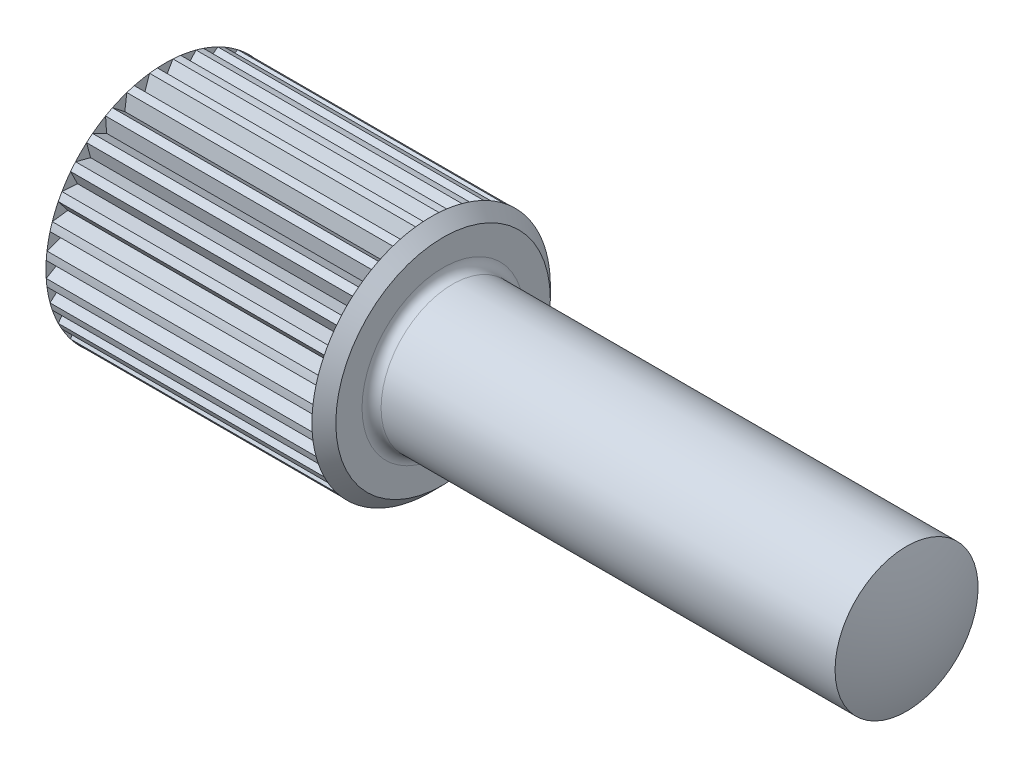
ISO-10303-21;
HEADER;
FILE_DESCRIPTION(('STEP AP214'),'2;1');
FILE_NAME('part.step','',(''),(''),'','','');
FILE_SCHEMA(('AUTOMOTIVE_DESIGN { 1 0 10303 214 1 1 1 1 }'));
ENDSEC;
DATA;
#1=APPLICATION_CONTEXT('core data for automotive mechanical design processes');
#2=APPLICATION_PROTOCOL_DEFINITION('international standard','automotive_design',2000,#1);
#3=PRODUCT_CONTEXT('',#1,'mechanical');
#4=PRODUCT('Part','Part','',(#3));
#5=PRODUCT_RELATED_PRODUCT_CATEGORY('part','',(#4));
#6=PRODUCT_DEFINITION_FORMATION('','',#4);
#7=PRODUCT_DEFINITION_CONTEXT('part definition',#1,'design');
#8=PRODUCT_DEFINITION('design','',#6,#7);
#9=PRODUCT_DEFINITION_SHAPE('','',#8);
#10=(LENGTH_UNIT() NAMED_UNIT(*) SI_UNIT(.MILLI.,.METRE.));
#11=(NAMED_UNIT(*) PLANE_ANGLE_UNIT() SI_UNIT($,.RADIAN.));
#12=(NAMED_UNIT(*) SI_UNIT($,.STERADIAN.) SOLID_ANGLE_UNIT());
#13=UNCERTAINTY_MEASURE_WITH_UNIT(LENGTH_MEASURE(1.E-05),#10,'distance_accuracy_value','');
#14=(GEOMETRIC_REPRESENTATION_CONTEXT(3) GLOBAL_UNCERTAINTY_ASSIGNED_CONTEXT((#13)) GLOBAL_UNIT_ASSIGNED_CONTEXT((#10,
#11,#12)) REPRESENTATION_CONTEXT('',''));
#15=CARTESIAN_POINT('',(0.,0.,0.));
#16=DIRECTION('',(0.,0.,1.));
#17=DIRECTION('',(1.,0.,0.));
#18=AXIS2_PLACEMENT_3D('',#15,#16,#17);
#19=CARTESIAN_POINT('',(-48.2110754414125,0.,0.));
#20=DIRECTION('',(-1.,0.,0.));
#21=DIRECTION('',(0.,0.,1.));
#22=AXIS2_PLACEMENT_3D('',#19,#20,#21);
#23=CYLINDRICAL_SURFACE('',#22,5.);
#24=DIRECTION('',(-1.,0.,0.));
#25=VECTOR('',#24,1.);
#26=CARTESIAN_POINT('',(-48.2110754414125,4.95724156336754,-0.65249987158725));
#27=LINE('',#26,#25);
#28=CARTESIAN_POINT('',(1.33974596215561,4.95724156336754,-0.65249987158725));
#29=VERTEX_POINT('',#28);
#30=CARTESIAN_POINT('',(12.5,4.95724156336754,-0.652499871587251));
#31=VERTEX_POINT('',#30);
#32=EDGE_CURVE('E637',#29,#31,#27,.F.);
#33=ORIENTED_EDGE('',*,*,#32,.F.);
#34=CARTESIAN_POINT('',(1.33974596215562,0.,0.));
#35=DIRECTION('',(-1.,0.,0.));
#36=DIRECTION('',(0.,0.,1.));
#37=AXIS2_PLACEMENT_3D('',#34,#35,#36);
#38=CIRCLE('',#37,5.);
#39=CARTESIAN_POINT('',(1.33974596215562,4.98928596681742,-0.327147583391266));
#40=VERTEX_POINT('',#39);
#41=EDGE_CURVE('E1220',#40,#29,#38,.T.);
#42=ORIENTED_EDGE('',*,*,#41,.F.);
#43=DIRECTION('',(-1.,0.,0.));
#44=VECTOR('',#43,1.);
#45=CARTESIAN_POINT('',(-48.2110754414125,4.98928596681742,-0.327147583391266));
#46=LINE('',#45,#44);
#47=CARTESIAN_POINT('',(12.5,4.98928596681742,-0.327147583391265));
#48=VERTEX_POINT('',#47);
#49=EDGE_CURVE('E1207',#48,#40,#46,.T.);
#50=ORIENTED_EDGE('',*,*,#49,.F.);
#51=CARTESIAN_POINT('',(12.5,0.,0.));
#52=DIRECTION('',(-1.,0.,0.));
#53=DIRECTION('',(0.,0.,1.));
#54=AXIS2_PLACEMENT_3D('',#51,#52,#53);
#55=CIRCLE('',#54,5.);
#56=EDGE_CURVE('E1228',#48,#31,#55,.T.);
#57=ORIENTED_EDGE('',*,*,#56,.T.);
#58=EDGE_LOOP('',(#33,#42,#50,#57));
#59=FACE_BOUND('',#58,.T.);
#60=ADVANCED_FACE('F37',(#59),#23,.T.);
#61=DIRECTION('',(-1.,0.,0.));
#62=VECTOR('',#61,1.);
#63=CARTESIAN_POINT('',(-48.2110754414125,4.82959490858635,-1.29422294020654));
#64=LINE('',#63,#62);
#65=CARTESIAN_POINT('',(12.5,4.82959490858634,-1.29422294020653));
#66=VERTEX_POINT('',#65);
#67=CARTESIAN_POINT('',(1.33974596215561,4.82959490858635,-1.29422294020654));
#68=VERTEX_POINT('',#67);
#69=EDGE_CURVE('E646',#66,#68,#64,.T.);
#70=ORIENTED_EDGE('',*,*,#69,.F.);
#71=CARTESIAN_POINT('',(12.5,4.73469314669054,-1.60707212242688));
#72=VERTEX_POINT('',#71);
#73=EDGE_CURVE('E60',#66,#72,#55,.T.);
#74=ORIENTED_EDGE('',*,*,#73,.T.);
#75=DIRECTION('',(-1.,0.,0.));
#76=VECTOR('',#75,1.);
#77=CARTESIAN_POINT('',(-48.2110754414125,4.73469314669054,-1.60707212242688));
#78=LINE('',#77,#76);
#79=CARTESIAN_POINT('',(1.33974596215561,4.73469314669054,-1.60707212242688));
#80=VERTEX_POINT('',#79);
#81=EDGE_CURVE('E672',#80,#72,#78,.F.);
#82=ORIENTED_EDGE('',*,*,#81,.F.);
#83=EDGE_CURVE('E1221',#68,#80,#38,.T.);
#84=ORIENTED_EDGE('',*,*,#83,.F.);
#85=EDGE_LOOP('',(#70,#74,#82,#84));
#86=FACE_BOUND('',#85,.T.);
#87=ADVANCED_FACE('F1247',(#86),#23,.T.);
#88=DIRECTION('',(-1.,0.,0.));
#89=VECTOR('',#88,1.);
#90=CARTESIAN_POINT('',(-48.2110754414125,4.48430522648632,-2.21156203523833));
#91=LINE('',#90,#89);
#92=CARTESIAN_POINT('',(12.5,4.48430522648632,-2.21156203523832));
#93=VERTEX_POINT('',#92);
#94=CARTESIAN_POINT('',(1.33974596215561,4.48430522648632,-2.21156203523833));
#95=VERTEX_POINT('',#94);
#96=EDGE_CURVE('E667',#93,#95,#91,.T.);
#97=ORIENTED_EDGE('',*,*,#96,.F.);
#98=CARTESIAN_POINT('',(12.5,4.33019312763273,-2.49988549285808));
#99=VERTEX_POINT('',#98);
#100=EDGE_CURVE('E1492',#93,#99,#55,.T.);
#101=ORIENTED_EDGE('',*,*,#100,.T.);
#102=DIRECTION('',(-1.,0.,0.));
#103=VECTOR('',#102,1.);
#104=CARTESIAN_POINT('',(-48.2110754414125,4.33019312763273,-2.49988549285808));
#105=LINE('',#104,#103);
#106=CARTESIAN_POINT('',(1.33974596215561,4.33019312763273,-2.49988549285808));
#107=VERTEX_POINT('',#106);
#108=EDGE_CURVE('E690',#107,#99,#105,.F.);
#109=ORIENTED_EDGE('',*,*,#108,.F.);
#110=EDGE_CURVE('E1527',#95,#107,#38,.T.);
#111=ORIENTED_EDGE('',*,*,#110,.F.);
#112=EDGE_LOOP('',(#97,#101,#109,#111));
#113=FACE_BOUND('',#112,.T.);
#114=ADVANCED_FACE('F1254',(#113),#23,.T.);
#115=DIRECTION('',(-1.,0.,0.));
#116=VECTOR('',#115,1.);
#117=CARTESIAN_POINT('',(-48.2110754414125,3.96668620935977,-3.04391204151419));
#118=LINE('',#117,#116);
#119=CARTESIAN_POINT('',(12.5,3.96668620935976,-3.04391204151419));
#120=VERTEX_POINT('',#119);
#121=CARTESIAN_POINT('',(1.33974596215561,3.96668620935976,-3.04391204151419));
#122=VERTEX_POINT('',#121);
#123=EDGE_CURVE('E685',#120,#122,#118,.T.);
#124=ORIENTED_EDGE('',*,*,#123,.F.);
#125=CARTESIAN_POINT('',(12.5,3.75928621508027,-3.29662966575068));
#126=VERTEX_POINT('',#125);
#127=EDGE_CURVE('E1491',#120,#126,#55,.T.);
#128=ORIENTED_EDGE('',*,*,#127,.T.);
#129=DIRECTION('',(-1.,0.,0.));
#130=VECTOR('',#129,1.);
#131=CARTESIAN_POINT('',(-48.2110754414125,3.75928621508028,-3.29662966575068));
#132=LINE('',#131,#130);
#133=CARTESIAN_POINT('',(1.33974596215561,3.75928621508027,-3.29662966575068));
#134=VERTEX_POINT('',#133);
#135=EDGE_CURVE('E708',#134,#126,#132,.F.);
#136=ORIENTED_EDGE('',*,*,#135,.F.);
#137=EDGE_CURVE('E1528',#122,#134,#38,.T.);
#138=ORIENTED_EDGE('',*,*,#137,.F.);
#139=EDGE_LOOP('',(#124,#128,#136,#138));
#140=FACE_BOUND('',#139,.T.);
#141=ADVANCED_FACE('F2891',(#140),#23,.T.);
#142=DIRECTION('',(-1.,0.,0.));
#143=VECTOR('',#142,1.);
#144=CARTESIAN_POINT('',(-48.2110754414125,3.29662966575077,-3.75928621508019));
#145=LINE('',#144,#143);
#146=CARTESIAN_POINT('',(12.5,3.29662966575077,-3.75928621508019));
#147=VERTEX_POINT('',#146);
#148=CARTESIAN_POINT('',(1.33974596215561,3.29662966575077,-3.75928621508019));
#149=VERTEX_POINT('',#148);
#150=EDGE_CURVE('E703',#147,#149,#145,.T.);
#151=ORIENTED_EDGE('',*,*,#150,.F.);
#152=CARTESIAN_POINT('',(12.5,3.04391204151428,-3.96668620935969));
#153=VERTEX_POINT('',#152);
#154=EDGE_CURVE('E1481',#147,#153,#55,.T.);
#155=ORIENTED_EDGE('',*,*,#154,.T.);
#156=DIRECTION('',(-1.,0.,0.));
#157=VECTOR('',#156,1.);
#158=CARTESIAN_POINT('',(-48.2110754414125,3.04391204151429,-3.96668620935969));
#159=LINE('',#158,#157);
#160=CARTESIAN_POINT('',(1.33974596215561,3.04391204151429,-3.96668620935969));
#161=VERTEX_POINT('',#160);
#162=EDGE_CURVE('E726',#161,#153,#159,.F.);
#163=ORIENTED_EDGE('',*,*,#162,.F.);
#164=EDGE_CURVE('E1529',#149,#161,#38,.T.);
#165=ORIENTED_EDGE('',*,*,#164,.F.);
#166=EDGE_LOOP('',(#151,#155,#163,#165));
#167=FACE_BOUND('',#166,.T.);
#168=ADVANCED_FACE('F2883',(#167),#23,.T.);
#169=DIRECTION('',(-1.,0.,0.));
#170=VECTOR('',#169,1.);
#171=CARTESIAN_POINT('',(-48.2110754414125,2.49988549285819,-4.33019312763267));
#172=LINE('',#171,#170);
#173=CARTESIAN_POINT('',(12.5,2.49988549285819,-4.33019312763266));
#174=VERTEX_POINT('',#173);
#175=CARTESIAN_POINT('',(1.33974596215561,2.49988549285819,-4.33019312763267));
#176=VERTEX_POINT('',#175);
#177=EDGE_CURVE('E721',#174,#176,#172,.T.);
#178=ORIENTED_EDGE('',*,*,#177,.F.);
#179=CARTESIAN_POINT('',(12.5,2.21156203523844,-4.48430522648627));
#180=VERTEX_POINT('',#179);
#181=EDGE_CURVE('E1469',#174,#180,#55,.T.);
#182=ORIENTED_EDGE('',*,*,#181,.T.);
#183=DIRECTION('',(-1.,0.,0.));
#184=VECTOR('',#183,1.);
#185=CARTESIAN_POINT('',(-48.2110754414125,2.21156203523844,-4.48430522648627));
#186=LINE('',#185,#184);
#187=CARTESIAN_POINT('',(1.33974596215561,2.21156203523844,-4.48430522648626));
#188=VERTEX_POINT('',#187);
#189=EDGE_CURVE('E744',#188,#180,#186,.F.);
#190=ORIENTED_EDGE('',*,*,#189,.F.);
#191=EDGE_CURVE('E1538',#176,#188,#38,.T.);
#192=ORIENTED_EDGE('',*,*,#191,.F.);
#193=EDGE_LOOP('',(#178,#182,#190,#192));
#194=FACE_BOUND('',#193,.T.);
#195=ADVANCED_FACE('F2876',(#194),#23,.T.);
#196=DIRECTION('',(-1.,0.,0.));
#197=VECTOR('',#196,1.);
#198=CARTESIAN_POINT('',(-48.2110754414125,1.607072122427,-4.7346931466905));
#199=LINE('',#198,#197);
#200=CARTESIAN_POINT('',(12.5,1.607072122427,-4.7346931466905));
#201=VERTEX_POINT('',#200);
#202=CARTESIAN_POINT('',(1.33974596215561,1.607072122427,-4.7346931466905));
#203=VERTEX_POINT('',#202);
#204=EDGE_CURVE('E739',#201,#203,#199,.T.);
#205=ORIENTED_EDGE('',*,*,#204,.F.);
#206=CARTESIAN_POINT('',(12.5,1.29422294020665,-4.82959490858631));
#207=VERTEX_POINT('',#206);
#208=EDGE_CURVE('E1468',#201,#207,#55,.T.);
#209=ORIENTED_EDGE('',*,*,#208,.T.);
#210=DIRECTION('',(-1.,0.,0.));
#211=VECTOR('',#210,1.);
#212=CARTESIAN_POINT('',(-48.2110754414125,1.29422294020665,-4.82959490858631));
#213=LINE('',#212,#211);
#214=CARTESIAN_POINT('',(1.33974596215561,1.29422294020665,-4.82959490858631));
#215=VERTEX_POINT('',#214);
#216=EDGE_CURVE('E762',#215,#207,#213,.F.);
#217=ORIENTED_EDGE('',*,*,#216,.F.);
#218=EDGE_CURVE('E1539',#203,#215,#38,.T.);
#219=ORIENTED_EDGE('',*,*,#218,.F.);
#220=EDGE_LOOP('',(#205,#209,#217,#219));
#221=FACE_BOUND('',#220,.T.);
#222=ADVANCED_FACE('F2869',(#221),#23,.T.);
#223=DIRECTION('',(-1.,0.,0.));
#224=VECTOR('',#223,1.);
#225=CARTESIAN_POINT('',(-48.2110754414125,0.652499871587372,-4.95724156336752));
#226=LINE('',#225,#224);
#227=CARTESIAN_POINT('',(12.5,0.652499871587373,-4.95724156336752));
#228=VERTEX_POINT('',#227);
#229=CARTESIAN_POINT('',(1.33974596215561,0.652499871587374,-4.95724156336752));
#230=VERTEX_POINT('',#229);
#231=EDGE_CURVE('E757',#228,#230,#226,.T.);
#232=ORIENTED_EDGE('',*,*,#231,.F.);
#233=CARTESIAN_POINT('',(12.5,0.327147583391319,-4.98928596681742));
#234=VERTEX_POINT('',#233);
#235=EDGE_CURVE('E1458',#228,#234,#55,.T.);
#236=ORIENTED_EDGE('',*,*,#235,.T.);
#237=DIRECTION('',(-1.,0.,0.));
#238=VECTOR('',#237,1.);
#239=CARTESIAN_POINT('',(-48.2110754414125,0.32714758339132,-4.98928596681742));
#240=LINE('',#239,#238);
#241=CARTESIAN_POINT('',(1.33974596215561,0.327147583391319,-4.98928596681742));
#242=VERTEX_POINT('',#241);
#243=EDGE_CURVE('E780',#242,#234,#240,.F.);
#244=ORIENTED_EDGE('',*,*,#243,.F.);
#245=EDGE_CURVE('E1546',#230,#242,#38,.T.);
#246=ORIENTED_EDGE('',*,*,#245,.F.);
#247=EDGE_LOOP('',(#232,#236,#244,#246));
#248=FACE_BOUND('',#247,.T.);
#249=ADVANCED_FACE('F2861',(#248),#23,.T.);
#250=DIRECTION('',(-1.,0.,0.));
#251=VECTOR('',#250,1.);
#252=CARTESIAN_POINT('',(-48.2110754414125,-0.327147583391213,-4.98928596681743));
#253=LINE('',#252,#251);
#254=CARTESIAN_POINT('',(12.5,-0.327147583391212,-4.98928596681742));
#255=VERTEX_POINT('',#254);
#256=CARTESIAN_POINT('',(1.33974596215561,-0.327147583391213,-4.98928596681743));
#257=VERTEX_POINT('',#256);
#258=EDGE_CURVE('E775',#255,#257,#253,.T.);
#259=ORIENTED_EDGE('',*,*,#258,.F.);
#260=CARTESIAN_POINT('',(12.5,-0.652499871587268,-4.95724156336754));
#261=VERTEX_POINT('',#260);
#262=EDGE_CURVE('E1446',#255,#261,#55,.T.);
#263=ORIENTED_EDGE('',*,*,#262,.T.);
#264=DIRECTION('',(-1.,0.,0.));
#265=VECTOR('',#264,1.);
#266=CARTESIAN_POINT('',(-48.2110754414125,-0.652499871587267,-4.95724156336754));
#267=LINE('',#266,#265);
#268=CARTESIAN_POINT('',(1.33974596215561,-0.652499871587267,-4.95724156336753));
#269=VERTEX_POINT('',#268);
#270=EDGE_CURVE('E798',#269,#261,#267,.F.);
#271=ORIENTED_EDGE('',*,*,#270,.F.);
#272=EDGE_CURVE('E1547',#257,#269,#38,.T.);
#273=ORIENTED_EDGE('',*,*,#272,.F.);
#274=EDGE_LOOP('',(#259,#263,#271,#273));
#275=FACE_BOUND('',#274,.T.);
#276=ADVANCED_FACE('F2854',(#275),#23,.T.);
#277=DIRECTION('',(-1.,0.,0.));
#278=VECTOR('',#277,1.);
#279=CARTESIAN_POINT('',(-48.2110754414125,-1.29422294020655,-4.82959490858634));
#280=LINE('',#279,#278);
#281=CARTESIAN_POINT('',(12.5,-1.29422294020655,-4.82959490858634));
#282=VERTEX_POINT('',#281);
#283=CARTESIAN_POINT('',(1.33974596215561,-1.29422294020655,-4.82959490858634));
#284=VERTEX_POINT('',#283);
#285=EDGE_CURVE('E793',#282,#284,#280,.T.);
#286=ORIENTED_EDGE('',*,*,#285,.F.);
#287=CARTESIAN_POINT('',(12.5,-1.6070721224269,-4.73469314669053));
#288=VERTEX_POINT('',#287);
#289=EDGE_CURVE('E1445',#282,#288,#55,.T.);
#290=ORIENTED_EDGE('',*,*,#289,.T.);
#291=DIRECTION('',(-1.,0.,0.));
#292=VECTOR('',#291,1.);
#293=CARTESIAN_POINT('',(-48.2110754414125,-1.6070721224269,-4.73469314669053));
#294=LINE('',#293,#292);
#295=CARTESIAN_POINT('',(1.33974596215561,-1.6070721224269,-4.73469314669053));
#296=VERTEX_POINT('',#295);
#297=EDGE_CURVE('E816',#296,#288,#294,.F.);
#298=ORIENTED_EDGE('',*,*,#297,.F.);
#299=EDGE_CURVE('E1554',#284,#296,#38,.T.);
#300=ORIENTED_EDGE('',*,*,#299,.F.);
#301=EDGE_LOOP('',(#286,#290,#298,#300));
#302=FACE_BOUND('',#301,.T.);
#303=ADVANCED_FACE('F2847',(#302),#23,.T.);
#304=DIRECTION('',(-1.,0.,0.));
#305=VECTOR('',#304,1.);
#306=CARTESIAN_POINT('',(-48.2110754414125,-2.21156203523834,-4.48430522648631));
#307=LINE('',#306,#305);
#308=CARTESIAN_POINT('',(12.5,-2.21156203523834,-4.48430522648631));
#309=VERTEX_POINT('',#308);
#310=CARTESIAN_POINT('',(1.33974596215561,-2.21156203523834,-4.48430522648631));
#311=VERTEX_POINT('',#310);
#312=EDGE_CURVE('E811',#309,#311,#307,.T.);
#313=ORIENTED_EDGE('',*,*,#312,.F.);
#314=CARTESIAN_POINT('',(12.5,-2.4998854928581,-4.33019312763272));
#315=VERTEX_POINT('',#314);
#316=EDGE_CURVE('E1435',#309,#315,#55,.T.);
#317=ORIENTED_EDGE('',*,*,#316,.T.);
#318=DIRECTION('',(-1.,0.,0.));
#319=VECTOR('',#318,1.);
#320=CARTESIAN_POINT('',(-48.2110754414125,-2.4998854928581,-4.33019312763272));
#321=LINE('',#320,#319);
#322=CARTESIAN_POINT('',(1.33974596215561,-2.4998854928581,-4.33019312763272));
#323=VERTEX_POINT('',#322);
#324=EDGE_CURVE('E834',#323,#315,#321,.F.);
#325=ORIENTED_EDGE('',*,*,#324,.F.);
#326=EDGE_CURVE('E1555',#311,#323,#38,.T.);
#327=ORIENTED_EDGE('',*,*,#326,.F.);
#328=EDGE_LOOP('',(#313,#317,#325,#327));
#329=FACE_BOUND('',#328,.T.);
#330=ADVANCED_FACE('F2839',(#329),#23,.T.);
#331=DIRECTION('',(-1.,0.,0.));
#332=VECTOR('',#331,1.);
#333=CARTESIAN_POINT('',(-48.2110754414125,-3.0439120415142,-3.96668620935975));
#334=LINE('',#333,#332);
#335=CARTESIAN_POINT('',(12.5,-3.0439120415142,-3.96668620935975));
#336=VERTEX_POINT('',#335);
#337=CARTESIAN_POINT('',(1.33974596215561,-3.0439120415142,-3.96668620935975));
#338=VERTEX_POINT('',#337);
#339=EDGE_CURVE('E829',#336,#338,#334,.T.);
#340=ORIENTED_EDGE('',*,*,#339,.F.);
#341=CARTESIAN_POINT('',(12.5,-3.29662966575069,-3.75928621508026));
#342=VERTEX_POINT('',#341);
#343=EDGE_CURVE('E1423',#336,#342,#55,.T.);
#344=ORIENTED_EDGE('',*,*,#343,.T.);
#345=DIRECTION('',(-1.,0.,0.));
#346=VECTOR('',#345,1.);
#347=CARTESIAN_POINT('',(-48.2110754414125,-3.29662966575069,-3.75928621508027));
#348=LINE('',#347,#346);
#349=CARTESIAN_POINT('',(1.33974596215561,-3.29662966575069,-3.75928621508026));
#350=VERTEX_POINT('',#349);
#351=EDGE_CURVE('E852',#350,#342,#348,.F.);
#352=ORIENTED_EDGE('',*,*,#351,.F.);
#353=EDGE_CURVE('E1562',#338,#350,#38,.T.);
#354=ORIENTED_EDGE('',*,*,#353,.F.);
#355=EDGE_LOOP('',(#340,#344,#352,#354));
#356=FACE_BOUND('',#355,.T.);
#357=ADVANCED_FACE('F2832',(#356),#23,.T.);
#358=DIRECTION('',(-1.,0.,0.));
#359=VECTOR('',#358,1.);
#360=CARTESIAN_POINT('',(-48.2110754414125,-3.75928621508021,-3.29662966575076));
#361=LINE('',#360,#359);
#362=CARTESIAN_POINT('',(12.5,-3.7592862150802,-3.29662966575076));
#363=VERTEX_POINT('',#362);
#364=CARTESIAN_POINT('',(1.33974596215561,-3.75928621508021,-3.29662966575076));
#365=VERTEX_POINT('',#364);
#366=EDGE_CURVE('E847',#363,#365,#361,.T.);
#367=ORIENTED_EDGE('',*,*,#366,.F.);
#368=CARTESIAN_POINT('',(12.5,-3.9666862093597,-3.04391204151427));
#369=VERTEX_POINT('',#368);
#370=EDGE_CURVE('E1422',#363,#369,#55,.T.);
#371=ORIENTED_EDGE('',*,*,#370,.T.);
#372=DIRECTION('',(-1.,0.,0.));
#373=VECTOR('',#372,1.);
#374=CARTESIAN_POINT('',(-48.2110754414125,-3.9666862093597,-3.04391204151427));
#375=LINE('',#374,#373);
#376=CARTESIAN_POINT('',(1.33974596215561,-3.9666862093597,-3.04391204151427));
#377=VERTEX_POINT('',#376);
#378=EDGE_CURVE('E870',#377,#369,#375,.F.);
#379=ORIENTED_EDGE('',*,*,#378,.F.);
#380=EDGE_CURVE('E1563',#365,#377,#38,.T.);
#381=ORIENTED_EDGE('',*,*,#380,.F.);
#382=EDGE_LOOP('',(#367,#371,#379,#381));
#383=FACE_BOUND('',#382,.T.);
#384=ADVANCED_FACE('F2825',(#383),#23,.T.);
#385=DIRECTION('',(-1.,0.,0.));
#386=VECTOR('',#385,1.);
#387=CARTESIAN_POINT('',(-48.2110754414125,-4.33019312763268,-2.49988549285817));
#388=LINE('',#387,#386);
#389=CARTESIAN_POINT('',(12.5,-4.33019312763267,-2.49988549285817));
#390=VERTEX_POINT('',#389);
#391=CARTESIAN_POINT('',(1.33974596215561,-4.33019312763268,-2.49988549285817));
#392=VERTEX_POINT('',#391);
#393=EDGE_CURVE('E865',#390,#392,#388,.T.);
#394=ORIENTED_EDGE('',*,*,#393,.F.);
#395=CARTESIAN_POINT('',(12.5,-4.48430522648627,-2.21156203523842));
#396=VERTEX_POINT('',#395);
#397=EDGE_CURVE('E1412',#390,#396,#55,.T.);
#398=ORIENTED_EDGE('',*,*,#397,.T.);
#399=DIRECTION('',(-1.,0.,0.));
#400=VECTOR('',#399,1.);
#401=CARTESIAN_POINT('',(-48.2110754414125,-4.48430522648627,-2.21156203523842));
#402=LINE('',#401,#400);
#403=CARTESIAN_POINT('',(1.33974596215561,-4.48430522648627,-2.21156203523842));
#404=VERTEX_POINT('',#403);
#405=EDGE_CURVE('E888',#404,#396,#402,.F.);
#406=ORIENTED_EDGE('',*,*,#405,.F.);
#407=EDGE_CURVE('E1570',#392,#404,#38,.T.);
#408=ORIENTED_EDGE('',*,*,#407,.F.);
#409=EDGE_LOOP('',(#394,#398,#406,#408));
#410=FACE_BOUND('',#409,.T.);
#411=ADVANCED_FACE('F2817',(#410),#23,.T.);
#412=DIRECTION('',(-1.,0.,0.));
#413=VECTOR('',#412,1.);
#414=CARTESIAN_POINT('',(-48.2110754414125,-4.73469314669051,-1.60707212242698));
#415=LINE('',#414,#413);
#416=CARTESIAN_POINT('',(12.5,-4.7346931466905,-1.60707212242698));
#417=VERTEX_POINT('',#416);
#418=CARTESIAN_POINT('',(1.33974596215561,-4.73469314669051,-1.60707212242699));
#419=VERTEX_POINT('',#418);
#420=EDGE_CURVE('E883',#417,#419,#415,.T.);
#421=ORIENTED_EDGE('',*,*,#420,.F.);
#422=CARTESIAN_POINT('',(12.5,-4.82959490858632,-1.29422294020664));
#423=VERTEX_POINT('',#422);
#424=EDGE_CURVE('E1400',#417,#423,#55,.T.);
#425=ORIENTED_EDGE('',*,*,#424,.T.);
#426=DIRECTION('',(-1.,0.,0.));
#427=VECTOR('',#426,1.);
#428=CARTESIAN_POINT('',(-48.2110754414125,-4.82959490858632,-1.29422294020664));
#429=LINE('',#428,#427);
#430=CARTESIAN_POINT('',(1.33974596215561,-4.82959490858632,-1.29422294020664));
#431=VERTEX_POINT('',#430);
#432=EDGE_CURVE('E906',#431,#423,#429,.F.);
#433=ORIENTED_EDGE('',*,*,#432,.F.);
#434=EDGE_CURVE('E1571',#419,#431,#38,.T.);
#435=ORIENTED_EDGE('',*,*,#434,.F.);
#436=EDGE_LOOP('',(#421,#425,#433,#435));
#437=FACE_BOUND('',#436,.T.);
#438=ADVANCED_FACE('F2810',(#437),#23,.T.);
#439=DIRECTION('',(-1.,0.,0.));
#440=VECTOR('',#439,1.);
#441=CARTESIAN_POINT('',(-48.2110754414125,-4.95724156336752,-0.652499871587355));
#442=LINE('',#441,#440);
#443=CARTESIAN_POINT('',(12.5,-4.95724156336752,-0.652499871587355));
#444=VERTEX_POINT('',#443);
#445=CARTESIAN_POINT('',(1.33974596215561,-4.95724156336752,-0.652499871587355));
#446=VERTEX_POINT('',#445);
#447=EDGE_CURVE('E901',#444,#446,#442,.T.);
#448=ORIENTED_EDGE('',*,*,#447,.F.);
#449=CARTESIAN_POINT('',(12.5,-4.98928596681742,-0.3271475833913));
#450=VERTEX_POINT('',#449);
#451=EDGE_CURVE('E1399',#444,#450,#55,.T.);
#452=ORIENTED_EDGE('',*,*,#451,.T.);
#453=DIRECTION('',(-1.,0.,0.));
#454=VECTOR('',#453,1.);
#455=CARTESIAN_POINT('',(-48.2110754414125,-4.98928596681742,-0.327147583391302));
#456=LINE('',#455,#454);
#457=CARTESIAN_POINT('',(1.33974596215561,-4.98928596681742,-0.327147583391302));
#458=VERTEX_POINT('',#457);
#459=EDGE_CURVE('E924',#458,#450,#456,.F.);
#460=ORIENTED_EDGE('',*,*,#459,.F.);
#461=EDGE_CURVE('E1578',#446,#458,#38,.T.);
#462=ORIENTED_EDGE('',*,*,#461,.F.);
#463=EDGE_LOOP('',(#448,#452,#460,#462));
#464=FACE_BOUND('',#463,.T.);
#465=ADVANCED_FACE('F2803',(#464),#23,.T.);
#466=DIRECTION('',(-1.,0.,0.));
#467=VECTOR('',#466,1.);
#468=CARTESIAN_POINT('',(-48.2110754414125,-4.98928596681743,0.327147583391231));
#469=LINE('',#468,#467);
#470=CARTESIAN_POINT('',(12.5,-4.98928596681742,0.32714758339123));
#471=VERTEX_POINT('',#470);
#472=CARTESIAN_POINT('',(1.33974596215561,-4.98928596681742,0.327147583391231));
#473=VERTEX_POINT('',#472);
#474=EDGE_CURVE('E919',#471,#473,#469,.T.);
#475=ORIENTED_EDGE('',*,*,#474,.F.);
#476=CARTESIAN_POINT('',(12.5,-4.95724156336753,0.652499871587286));
#477=VERTEX_POINT('',#476);
#478=EDGE_CURVE('E1389',#471,#477,#55,.T.);
#479=ORIENTED_EDGE('',*,*,#478,.T.);
#480=DIRECTION('',(-1.,0.,0.));
#481=VECTOR('',#480,1.);
#482=CARTESIAN_POINT('',(-48.2110754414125,-4.95724156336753,0.652499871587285));
#483=LINE('',#482,#481);
#484=CARTESIAN_POINT('',(1.33974596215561,-4.95724156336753,0.652499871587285));
#485=VERTEX_POINT('',#484);
#486=EDGE_CURVE('E942',#485,#477,#483,.F.);
#487=ORIENTED_EDGE('',*,*,#486,.F.);
#488=EDGE_CURVE('E1579',#473,#485,#38,.T.);
#489=ORIENTED_EDGE('',*,*,#488,.F.);
#490=EDGE_LOOP('',(#475,#479,#487,#489));
#491=FACE_BOUND('',#490,.T.);
#492=ADVANCED_FACE('F2795',(#491),#23,.T.);
#493=DIRECTION('',(-1.,0.,0.));
#494=VECTOR('',#493,1.);
#495=CARTESIAN_POINT('',(-48.2110754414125,-4.82959490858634,1.29422294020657));
#496=LINE('',#495,#494);
#497=CARTESIAN_POINT('',(12.5,-4.82959490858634,1.29422294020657));
#498=VERTEX_POINT('',#497);
#499=CARTESIAN_POINT('',(1.33974596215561,-4.82959490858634,1.29422294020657));
#500=VERTEX_POINT('',#499);
#501=EDGE_CURVE('E937',#498,#500,#496,.T.);
#502=ORIENTED_EDGE('',*,*,#501,.F.);
#503=CARTESIAN_POINT('',(12.5,-4.73469314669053,1.60707212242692));
#504=VERTEX_POINT('',#503);
#505=EDGE_CURVE('E1377',#498,#504,#55,.T.);
#506=ORIENTED_EDGE('',*,*,#505,.T.);
#507=DIRECTION('',(-1.,0.,0.));
#508=VECTOR('',#507,1.);
#509=CARTESIAN_POINT('',(-48.2110754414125,-4.73469314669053,1.60707212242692));
#510=LINE('',#509,#508);
#511=CARTESIAN_POINT('',(1.33974596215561,-4.73469314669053,1.60707212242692));
#512=VERTEX_POINT('',#511);
#513=EDGE_CURVE('E960',#512,#504,#510,.F.);
#514=ORIENTED_EDGE('',*,*,#513,.F.);
#515=EDGE_CURVE('E1586',#500,#512,#38,.T.);
#516=ORIENTED_EDGE('',*,*,#515,.F.);
#517=EDGE_LOOP('',(#502,#506,#514,#516));
#518=FACE_BOUND('',#517,.T.);
#519=ADVANCED_FACE('F2788',(#518),#23,.T.);
#520=DIRECTION('',(-1.,0.,0.));
#521=VECTOR('',#520,1.);
#522=CARTESIAN_POINT('',(-48.2110754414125,-4.4843052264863,2.21156203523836));
#523=LINE('',#522,#521);
#524=CARTESIAN_POINT('',(12.5,-4.4843052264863,2.21156203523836));
#525=VERTEX_POINT('',#524);
#526=CARTESIAN_POINT('',(1.33974596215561,-4.4843052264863,2.21156203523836));
#527=VERTEX_POINT('',#526);
#528=EDGE_CURVE('E955',#525,#527,#523,.T.);
#529=ORIENTED_EDGE('',*,*,#528,.F.);
#530=CARTESIAN_POINT('',(12.5,-4.33019312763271,2.49988549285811));
#531=VERTEX_POINT('',#530);
#532=EDGE_CURVE('E1376',#525,#531,#55,.T.);
#533=ORIENTED_EDGE('',*,*,#532,.T.);
#534=DIRECTION('',(-1.,0.,0.));
#535=VECTOR('',#534,1.);
#536=CARTESIAN_POINT('',(-48.2110754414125,-4.33019312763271,2.49988549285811));
#537=LINE('',#536,#535);
#538=CARTESIAN_POINT('',(1.33974596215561,-4.33019312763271,2.49988549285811));
#539=VERTEX_POINT('',#538);
#540=EDGE_CURVE('E978',#539,#531,#537,.F.);
#541=ORIENTED_EDGE('',*,*,#540,.F.);
#542=EDGE_CURVE('E1587',#527,#539,#38,.T.);
#543=ORIENTED_EDGE('',*,*,#542,.F.);
#544=EDGE_LOOP('',(#529,#533,#541,#543));
#545=FACE_BOUND('',#544,.T.);
#546=ADVANCED_FACE('F2781',(#545),#23,.T.);
#547=DIRECTION('',(-1.,0.,0.));
#548=VECTOR('',#547,1.);
#549=CARTESIAN_POINT('',(-48.2110754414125,-3.96668620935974,3.04391204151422));
#550=LINE('',#549,#548);
#551=CARTESIAN_POINT('',(12.5,-3.96668620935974,3.04391204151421));
#552=VERTEX_POINT('',#551);
#553=CARTESIAN_POINT('',(1.33974596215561,-3.96668620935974,3.04391204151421));
#554=VERTEX_POINT('',#553);
#555=EDGE_CURVE('E973',#552,#554,#550,.T.);
#556=ORIENTED_EDGE('',*,*,#555,.F.);
#557=CARTESIAN_POINT('',(12.5,-3.75928621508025,3.2966296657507));
#558=VERTEX_POINT('',#557);
#559=EDGE_CURVE('E1366',#552,#558,#55,.T.);
#560=ORIENTED_EDGE('',*,*,#559,.T.);
#561=DIRECTION('',(-1.,0.,0.));
#562=VECTOR('',#561,1.);
#563=CARTESIAN_POINT('',(-48.2110754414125,-3.75928621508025,3.2966296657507));
#564=LINE('',#563,#562);
#565=CARTESIAN_POINT('',(1.33974596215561,-3.75928621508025,3.2966296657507));
#566=VERTEX_POINT('',#565);
#567=EDGE_CURVE('E996',#566,#558,#564,.F.);
#568=ORIENTED_EDGE('',*,*,#567,.F.);
#569=EDGE_CURVE('E1594',#554,#566,#38,.T.);
#570=ORIENTED_EDGE('',*,*,#569,.F.);
#571=EDGE_LOOP('',(#556,#560,#568,#570));
#572=FACE_BOUND('',#571,.T.);
#573=ADVANCED_FACE('F2773',(#572),#23,.T.);
#574=DIRECTION('',(-1.,0.,0.));
#575=VECTOR('',#574,1.);
#576=CARTESIAN_POINT('',(-48.2110754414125,-3.29662966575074,3.75928621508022));
#577=LINE('',#576,#575);
#578=CARTESIAN_POINT('',(12.5,-3.29662966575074,3.75928621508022));
#579=VERTEX_POINT('',#578);
#580=CARTESIAN_POINT('',(1.33974596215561,-3.29662966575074,3.75928621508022));
#581=VERTEX_POINT('',#580);
#582=EDGE_CURVE('E991',#579,#581,#577,.T.);
#583=ORIENTED_EDGE('',*,*,#582,.F.);
#584=CARTESIAN_POINT('',(12.5,-3.04391204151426,3.96668620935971));
#585=VERTEX_POINT('',#584);
#586=EDGE_CURVE('E1354',#579,#585,#55,.T.);
#587=ORIENTED_EDGE('',*,*,#586,.T.);
#588=DIRECTION('',(-1.,0.,0.));
#589=VECTOR('',#588,1.);
#590=CARTESIAN_POINT('',(-48.2110754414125,-3.04391204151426,3.96668620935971));
#591=LINE('',#590,#589);
#592=CARTESIAN_POINT('',(1.33974596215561,-3.04391204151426,3.96668620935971));
#593=VERTEX_POINT('',#592);
#594=EDGE_CURVE('E1014',#593,#585,#591,.F.);
#595=ORIENTED_EDGE('',*,*,#594,.F.);
#596=EDGE_CURVE('E1595',#581,#593,#38,.T.);
#597=ORIENTED_EDGE('',*,*,#596,.F.);
#598=EDGE_LOOP('',(#583,#587,#595,#597));
#599=FACE_BOUND('',#598,.T.);
#600=ADVANCED_FACE('F2766',(#599),#23,.T.);
#601=DIRECTION('',(-1.,0.,0.));
#602=VECTOR('',#601,1.);
#603=CARTESIAN_POINT('',(-48.2110754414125,-2.49988549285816,4.33019312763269));
#604=LINE('',#603,#602);
#605=CARTESIAN_POINT('',(12.5,-2.49988549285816,4.33019312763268));
#606=VERTEX_POINT('',#605);
#607=CARTESIAN_POINT('',(1.33974596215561,-2.49988549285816,4.33019312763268));
#608=VERTEX_POINT('',#607);
#609=EDGE_CURVE('E1009',#606,#608,#604,.T.);
#610=ORIENTED_EDGE('',*,*,#609,.F.);
#611=CARTESIAN_POINT('',(12.5,-2.21156203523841,4.48430522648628));
#612=VERTEX_POINT('',#611);
#613=EDGE_CURVE('E1353',#606,#612,#55,.T.);
#614=ORIENTED_EDGE('',*,*,#613,.T.);
#615=DIRECTION('',(-1.,0.,0.));
#616=VECTOR('',#615,1.);
#617=CARTESIAN_POINT('',(-48.2110754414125,-2.21156203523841,4.48430522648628));
#618=LINE('',#617,#616);
#619=CARTESIAN_POINT('',(1.33974596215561,-2.21156203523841,4.48430522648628));
#620=VERTEX_POINT('',#619);
#621=EDGE_CURVE('E1032',#620,#612,#618,.F.);
#622=ORIENTED_EDGE('',*,*,#621,.F.);
#623=EDGE_CURVE('E1602',#608,#620,#38,.T.);
#624=ORIENTED_EDGE('',*,*,#623,.F.);
#625=EDGE_LOOP('',(#610,#614,#622,#624));
#626=FACE_BOUND('',#625,.T.);
#627=ADVANCED_FACE('F2759',(#626),#23,.T.);
#628=DIRECTION('',(-1.,0.,0.));
#629=VECTOR('',#628,1.);
#630=CARTESIAN_POINT('',(-48.2110754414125,-1.60707212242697,4.73469314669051));
#631=LINE('',#630,#629);
#632=CARTESIAN_POINT('',(12.5,-1.60707212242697,4.73469314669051));
#633=VERTEX_POINT('',#632);
#634=CARTESIAN_POINT('',(1.33974596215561,-1.60707212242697,4.73469314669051));
#635=VERTEX_POINT('',#634);
#636=EDGE_CURVE('E1027',#633,#635,#631,.T.);
#637=ORIENTED_EDGE('',*,*,#636,.F.);
#638=CARTESIAN_POINT('',(12.5,-1.29422294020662,4.82959490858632));
#639=VERTEX_POINT('',#638);
#640=EDGE_CURVE('E1343',#633,#639,#55,.T.);
#641=ORIENTED_EDGE('',*,*,#640,.T.);
#642=DIRECTION('',(-1.,0.,0.));
#643=VECTOR('',#642,1.);
#644=CARTESIAN_POINT('',(-48.2110754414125,-1.29422294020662,4.82959490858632));
#645=LINE('',#644,#643);
#646=CARTESIAN_POINT('',(1.33974596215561,-1.29422294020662,4.82959490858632));
#647=VERTEX_POINT('',#646);
#648=EDGE_CURVE('E1050',#647,#639,#645,.F.);
#649=ORIENTED_EDGE('',*,*,#648,.F.);
#650=EDGE_CURVE('E1603',#635,#647,#38,.T.);
#651=ORIENTED_EDGE('',*,*,#650,.F.);
#652=EDGE_LOOP('',(#637,#641,#649,#651));
#653=FACE_BOUND('',#652,.T.);
#654=ADVANCED_FACE('F2751',(#653),#23,.T.);
#655=DIRECTION('',(-1.,0.,0.));
#656=VECTOR('',#655,1.);
#657=CARTESIAN_POINT('',(-48.2110754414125,-0.652499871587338,4.95724156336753));
#658=LINE('',#657,#656);
#659=CARTESIAN_POINT('',(12.5,-0.65249987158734,4.95724156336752));
#660=VERTEX_POINT('',#659);
#661=CARTESIAN_POINT('',(1.33974596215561,-0.652499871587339,4.95724156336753));
#662=VERTEX_POINT('',#661);
#663=EDGE_CURVE('E1045',#660,#662,#658,.T.);
#664=ORIENTED_EDGE('',*,*,#663,.F.);
#665=CARTESIAN_POINT('',(12.5,-0.327147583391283,4.98928596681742));
#666=VERTEX_POINT('',#665);
#667=EDGE_CURVE('E1331',#660,#666,#55,.T.);
#668=ORIENTED_EDGE('',*,*,#667,.T.);
#669=DIRECTION('',(-1.,0.,0.));
#670=VECTOR('',#669,1.);
#671=CARTESIAN_POINT('',(-48.2110754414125,-0.327147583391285,4.98928596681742));
#672=LINE('',#671,#670);
#673=CARTESIAN_POINT('',(1.33974596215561,-0.327147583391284,4.98928596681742));
#674=VERTEX_POINT('',#673);
#675=EDGE_CURVE('E1068',#674,#666,#672,.F.);
#676=ORIENTED_EDGE('',*,*,#675,.F.);
#677=EDGE_CURVE('E1610',#662,#674,#38,.T.);
#678=ORIENTED_EDGE('',*,*,#677,.F.);
#679=EDGE_LOOP('',(#664,#668,#676,#678));
#680=FACE_BOUND('',#679,.T.);
#681=ADVANCED_FACE('F2744',(#680),#23,.T.);
#682=DIRECTION('',(-1.,0.,0.));
#683=VECTOR('',#682,1.);
#684=CARTESIAN_POINT('',(-48.2110754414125,0.327147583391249,4.98928596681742));
#685=LINE('',#684,#683);
#686=CARTESIAN_POINT('',(12.5,0.327147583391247,4.98928596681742));
#687=VERTEX_POINT('',#686);
#688=CARTESIAN_POINT('',(1.33974596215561,0.327147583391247,4.98928596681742));
#689=VERTEX_POINT('',#688);
#690=EDGE_CURVE('E1063',#687,#689,#685,.T.);
#691=ORIENTED_EDGE('',*,*,#690,.F.);
#692=CARTESIAN_POINT('',(12.5,0.652499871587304,4.95724156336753));
#693=VERTEX_POINT('',#692);
#694=EDGE_CURVE('E1330',#687,#693,#55,.T.);
#695=ORIENTED_EDGE('',*,*,#694,.T.);
#696=DIRECTION('',(-1.,0.,0.));
#697=VECTOR('',#696,1.);
#698=CARTESIAN_POINT('',(-48.2110754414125,0.652499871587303,4.95724156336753));
#699=LINE('',#698,#697);
#700=CARTESIAN_POINT('',(1.33974596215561,0.652499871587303,4.95724156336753));
#701=VERTEX_POINT('',#700);
#702=EDGE_CURVE('E1086',#701,#693,#699,.F.);
#703=ORIENTED_EDGE('',*,*,#702,.F.);
#704=EDGE_CURVE('E1611',#689,#701,#38,.T.);
#705=ORIENTED_EDGE('',*,*,#704,.F.);
#706=EDGE_LOOP('',(#691,#695,#703,#705));
#707=FACE_BOUND('',#706,.T.);
#708=ADVANCED_FACE('F2737',(#707),#23,.T.);
#709=DIRECTION('',(-1.,0.,0.));
#710=VECTOR('',#709,1.);
#711=CARTESIAN_POINT('',(-48.2110754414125,1.29422294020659,4.82959490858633));
#712=LINE('',#711,#710);
#713=CARTESIAN_POINT('',(12.5,1.29422294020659,4.82959490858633));
#714=VERTEX_POINT('',#713);
#715=CARTESIAN_POINT('',(1.33974596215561,1.29422294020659,4.82959490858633));
#716=VERTEX_POINT('',#715);
#717=EDGE_CURVE('E1081',#714,#716,#712,.T.);
#718=ORIENTED_EDGE('',*,*,#717,.F.);
#719=CARTESIAN_POINT('',(12.5,1.60707212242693,4.73469314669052));
#720=VERTEX_POINT('',#719);
#721=EDGE_CURVE('E1320',#714,#720,#55,.T.);
#722=ORIENTED_EDGE('',*,*,#721,.T.);
#723=DIRECTION('',(-1.,0.,0.));
#724=VECTOR('',#723,1.);
#725=CARTESIAN_POINT('',(-48.2110754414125,1.60707212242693,4.73469314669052));
#726=LINE('',#725,#724);
#727=CARTESIAN_POINT('',(1.33974596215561,1.60707212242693,4.73469314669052));
#728=VERTEX_POINT('',#727);
#729=EDGE_CURVE('E1104',#728,#720,#726,.F.);
#730=ORIENTED_EDGE('',*,*,#729,.F.);
#731=EDGE_CURVE('E1618',#716,#728,#38,.T.);
#732=ORIENTED_EDGE('',*,*,#731,.F.);
#733=EDGE_LOOP('',(#718,#722,#730,#732));
#734=FACE_BOUND('',#733,.T.);
#735=ADVANCED_FACE('F2729',(#734),#23,.T.);
#736=DIRECTION('',(-1.,0.,0.));
#737=VECTOR('',#736,1.);
#738=CARTESIAN_POINT('',(-48.2110754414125,2.21156203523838,4.4843052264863));
#739=LINE('',#738,#737);
#740=CARTESIAN_POINT('',(12.5,2.21156203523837,4.48430522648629));
#741=VERTEX_POINT('',#740);
#742=CARTESIAN_POINT('',(1.33974596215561,2.21156203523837,4.4843052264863));
#743=VERTEX_POINT('',#742);
#744=EDGE_CURVE('E1099',#741,#743,#739,.T.);
#745=ORIENTED_EDGE('',*,*,#744,.F.);
#746=CARTESIAN_POINT('',(12.5,2.49988549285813,4.3301931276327));
#747=VERTEX_POINT('',#746);
#748=EDGE_CURVE('E1308',#741,#747,#55,.T.);
#749=ORIENTED_EDGE('',*,*,#748,.T.);
#750=DIRECTION('',(-1.,0.,0.));
#751=VECTOR('',#750,1.);
#752=CARTESIAN_POINT('',(-48.2110754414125,2.49988549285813,4.3301931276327));
#753=LINE('',#752,#751);
#754=CARTESIAN_POINT('',(1.33974596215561,2.49988549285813,4.3301931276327));
#755=VERTEX_POINT('',#754);
#756=EDGE_CURVE('E1122',#755,#747,#753,.F.);
#757=ORIENTED_EDGE('',*,*,#756,.F.);
#758=EDGE_CURVE('E1619',#743,#755,#38,.T.);
#759=ORIENTED_EDGE('',*,*,#758,.F.);
#760=EDGE_LOOP('',(#745,#749,#757,#759));
#761=FACE_BOUND('',#760,.T.);
#762=ADVANCED_FACE('F2722',(#761),#23,.T.);
#763=DIRECTION('',(-1.,0.,0.));
#764=VECTOR('',#763,1.);
#765=CARTESIAN_POINT('',(-48.2110754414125,3.04391204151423,3.96668620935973));
#766=LINE('',#765,#764);
#767=CARTESIAN_POINT('',(12.5,3.04391204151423,3.96668620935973));
#768=VERTEX_POINT('',#767);
#769=CARTESIAN_POINT('',(1.33974596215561,3.04391204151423,3.96668620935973));
#770=VERTEX_POINT('',#769);
#771=EDGE_CURVE('E1117',#768,#770,#766,.T.);
#772=ORIENTED_EDGE('',*,*,#771,.F.);
#773=CARTESIAN_POINT('',(12.5,3.29662966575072,3.75928621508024));
#774=VERTEX_POINT('',#773);
#775=EDGE_CURVE('E1307',#768,#774,#55,.T.);
#776=ORIENTED_EDGE('',*,*,#775,.T.);
#777=DIRECTION('',(-1.,0.,0.));
#778=VECTOR('',#777,1.);
#779=CARTESIAN_POINT('',(-48.2110754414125,3.29662966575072,3.75928621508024));
#780=LINE('',#779,#778);
#781=CARTESIAN_POINT('',(1.33974596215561,3.29662966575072,3.75928621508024));
#782=VERTEX_POINT('',#781);
#783=EDGE_CURVE('E1140',#782,#774,#780,.F.);
#784=ORIENTED_EDGE('',*,*,#783,.F.);
#785=EDGE_CURVE('E1626',#770,#782,#38,.T.);
#786=ORIENTED_EDGE('',*,*,#785,.F.);
#787=EDGE_LOOP('',(#772,#776,#784,#786));
#788=FACE_BOUND('',#787,.T.);
#789=ADVANCED_FACE('F2715',(#788),#23,.T.);
#790=DIRECTION('',(-1.,0.,0.));
#791=VECTOR('',#790,1.);
#792=CARTESIAN_POINT('',(-48.2110754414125,3.75928621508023,3.29662966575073));
#793=LINE('',#792,#791);
#794=CARTESIAN_POINT('',(12.5,3.75928621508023,3.29662966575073));
#795=VERTEX_POINT('',#794);
#796=CARTESIAN_POINT('',(1.33974596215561,3.75928621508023,3.29662966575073));
#797=VERTEX_POINT('',#796);
#798=EDGE_CURVE('E1135',#795,#797,#793,.T.);
#799=ORIENTED_EDGE('',*,*,#798,.F.);
#800=CARTESIAN_POINT('',(12.5,3.96668620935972,3.04391204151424));
#801=VERTEX_POINT('',#800);
#802=EDGE_CURVE('E1297',#795,#801,#55,.T.);
#803=ORIENTED_EDGE('',*,*,#802,.T.);
#804=DIRECTION('',(-1.,0.,0.));
#805=VECTOR('',#804,1.);
#806=CARTESIAN_POINT('',(-48.2110754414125,3.96668620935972,3.04391204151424));
#807=LINE('',#806,#805);
#808=CARTESIAN_POINT('',(1.33974596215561,3.96668620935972,3.04391204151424));
#809=VERTEX_POINT('',#808);
#810=EDGE_CURVE('E1158',#809,#801,#807,.F.);
#811=ORIENTED_EDGE('',*,*,#810,.F.);
#812=EDGE_CURVE('E1627',#797,#809,#38,.T.);
#813=ORIENTED_EDGE('',*,*,#812,.F.);
#814=EDGE_LOOP('',(#799,#803,#811,#813));
#815=FACE_BOUND('',#814,.T.);
#816=ADVANCED_FACE('F2707',(#815),#23,.T.);
#817=DIRECTION('',(-1.,0.,0.));
#818=VECTOR('',#817,1.);
#819=CARTESIAN_POINT('',(-48.2110754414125,4.3301931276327,2.49988549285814));
#820=LINE('',#819,#818);
#821=CARTESIAN_POINT('',(12.5,4.33019312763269,2.49988549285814));
#822=VERTEX_POINT('',#821);
#823=CARTESIAN_POINT('',(1.33974596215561,4.3301931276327,2.49988549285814));
#824=VERTEX_POINT('',#823);
#825=EDGE_CURVE('E1153',#822,#824,#820,.T.);
#826=ORIENTED_EDGE('',*,*,#825,.F.);
#827=CARTESIAN_POINT('',(12.5,4.48430522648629,2.21156203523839));
#828=VERTEX_POINT('',#827);
#829=EDGE_CURVE('E1287',#822,#828,#55,.T.);
#830=ORIENTED_EDGE('',*,*,#829,.T.);
#831=DIRECTION('',(-1.,0.,0.));
#832=VECTOR('',#831,1.);
#833=CARTESIAN_POINT('',(-48.2110754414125,4.48430522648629,2.21156203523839));
#834=LINE('',#833,#832);
#835=CARTESIAN_POINT('',(1.33974596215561,4.48430522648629,2.21156203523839));
#836=VERTEX_POINT('',#835);
#837=EDGE_CURVE('E1176',#836,#828,#834,.F.);
#838=ORIENTED_EDGE('',*,*,#837,.F.);
#839=EDGE_CURVE('E1634',#824,#836,#38,.T.);
#840=ORIENTED_EDGE('',*,*,#839,.F.);
#841=EDGE_LOOP('',(#826,#830,#838,#840));
#842=FACE_BOUND('',#841,.T.);
#843=ADVANCED_FACE('F1268',(#842),#23,.T.);
#844=DIRECTION('',(-1.,0.,0.));
#845=VECTOR('',#844,1.);
#846=CARTESIAN_POINT('',(-48.2110754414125,4.73469314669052,1.60707212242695));
#847=LINE('',#846,#845);
#848=CARTESIAN_POINT('',(12.5,4.73469314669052,1.60707212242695));
#849=VERTEX_POINT('',#848);
#850=CARTESIAN_POINT('',(1.33974596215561,4.73469314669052,1.60707212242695));
#851=VERTEX_POINT('',#850);
#852=EDGE_CURVE('E1171',#849,#851,#847,.T.);
#853=ORIENTED_EDGE('',*,*,#852,.F.);
#854=CARTESIAN_POINT('',(12.5,4.82959490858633,1.2942229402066));
#855=VERTEX_POINT('',#854);
#856=EDGE_CURVE('E1286',#849,#855,#55,.T.);
#857=ORIENTED_EDGE('',*,*,#856,.T.);
#858=DIRECTION('',(-1.,0.,0.));
#859=VECTOR('',#858,1.);
#860=CARTESIAN_POINT('',(-48.2110754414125,4.82959490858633,1.29422294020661));
#861=LINE('',#860,#859);
#862=CARTESIAN_POINT('',(1.33974596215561,4.82959490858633,1.2942229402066));
#863=VERTEX_POINT('',#862);
#864=EDGE_CURVE('E1194',#863,#855,#861,.F.);
#865=ORIENTED_EDGE('',*,*,#864,.F.);
#866=EDGE_CURVE('E1635',#851,#863,#38,.T.);
#867=ORIENTED_EDGE('',*,*,#866,.F.);
#868=EDGE_LOOP('',(#853,#857,#865,#867));
#869=FACE_BOUND('',#868,.T.);
#870=ADVANCED_FACE('F1259',(#869),#23,.T.);
#871=DIRECTION('',(-1.,0.,0.));
#872=VECTOR('',#871,1.);
#873=CARTESIAN_POINT('',(-48.2110754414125,4.95724156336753,0.652499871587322));
#874=LINE('',#873,#872);
#875=CARTESIAN_POINT('',(12.5,4.95724156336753,0.652499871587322));
#876=VERTEX_POINT('',#875);
#877=CARTESIAN_POINT('',(1.33974596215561,4.95724156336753,0.652499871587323));
#878=VERTEX_POINT('',#877);
#879=EDGE_CURVE('E1189',#876,#878,#874,.T.);
#880=ORIENTED_EDGE('',*,*,#879,.F.);
#881=CARTESIAN_POINT('',(12.5,4.98928596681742,0.327147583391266));
#882=VERTEX_POINT('',#881);
#883=EDGE_CURVE('E1224',#876,#882,#55,.T.);
#884=ORIENTED_EDGE('',*,*,#883,.T.);
#885=DIRECTION('',(-1.,0.,0.));
#886=VECTOR('',#885,1.);
#887=CARTESIAN_POINT('',(-48.2110754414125,4.98928596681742,0.327147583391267));
#888=LINE('',#887,#886);
#889=CARTESIAN_POINT('',(1.33974596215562,4.98928596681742,0.327147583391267));
#890=VERTEX_POINT('',#889);
#891=EDGE_CURVE('E1212',#890,#882,#888,.F.);
#892=ORIENTED_EDGE('',*,*,#891,.F.);
#893=EDGE_CURVE('E1215',#878,#890,#38,.T.);
#894=ORIENTED_EDGE('',*,*,#893,.F.);
#895=EDGE_LOOP('',(#880,#884,#892,#894));
#896=FACE_BOUND('',#895,.T.);
#897=ADVANCED_FACE('F1250',(#896),#23,.T.);
#898=CARTESIAN_POINT('',(10.,0.,0.));
#899=DIRECTION('',(-1.,0.,0.));
#900=DIRECTION('',(0.,1.,0.));
#901=AXIS2_PLACEMENT_3D('',#898,#899,#900);
#902=SPHERICAL_SURFACE('',#901,10.);
#903=EDGE_CURVE('E1216',#890,#40,#38,.T.);
#904=ORIENTED_EDGE('',*,*,#903,.T.);
#905=ORIENTED_EDGE('',*,*,#41,.T.);
#906=EDGE_CURVE('E1531',#29,#68,#38,.T.);
#907=ORIENTED_EDGE('',*,*,#906,.T.);
#908=ORIENTED_EDGE('',*,*,#83,.T.);
#909=EDGE_CURVE('E1530',#80,#95,#38,.T.);
#910=ORIENTED_EDGE('',*,*,#909,.T.);
#911=ORIENTED_EDGE('',*,*,#110,.T.);
#912=EDGE_CURVE('E1526',#107,#122,#38,.T.);
#913=ORIENTED_EDGE('',*,*,#912,.T.);
#914=ORIENTED_EDGE('',*,*,#137,.T.);
#915=EDGE_CURVE('E1532',#134,#149,#38,.T.);
#916=ORIENTED_EDGE('',*,*,#915,.T.);
#917=ORIENTED_EDGE('',*,*,#164,.T.);
#918=EDGE_CURVE('E1533',#161,#176,#38,.T.);
#919=ORIENTED_EDGE('',*,*,#918,.T.);
#920=ORIENTED_EDGE('',*,*,#191,.T.);
#921=EDGE_CURVE('E1540',#188,#203,#38,.T.);
#922=ORIENTED_EDGE('',*,*,#921,.T.);
#923=ORIENTED_EDGE('',*,*,#218,.T.);
#924=EDGE_CURVE('E1541',#215,#230,#38,.T.);
#925=ORIENTED_EDGE('',*,*,#924,.T.);
#926=ORIENTED_EDGE('',*,*,#245,.T.);
#927=EDGE_CURVE('E1548',#242,#257,#38,.T.);
#928=ORIENTED_EDGE('',*,*,#927,.T.);
#929=ORIENTED_EDGE('',*,*,#272,.T.);
#930=EDGE_CURVE('E1549',#269,#284,#38,.T.);
#931=ORIENTED_EDGE('',*,*,#930,.T.);
#932=ORIENTED_EDGE('',*,*,#299,.T.);
#933=EDGE_CURVE('E1556',#296,#311,#38,.T.);
#934=ORIENTED_EDGE('',*,*,#933,.T.);
#935=ORIENTED_EDGE('',*,*,#326,.T.);
#936=EDGE_CURVE('E1557',#323,#338,#38,.T.);
#937=ORIENTED_EDGE('',*,*,#936,.T.);
#938=ORIENTED_EDGE('',*,*,#353,.T.);
#939=EDGE_CURVE('E1564',#350,#365,#38,.T.);
#940=ORIENTED_EDGE('',*,*,#939,.T.);
#941=ORIENTED_EDGE('',*,*,#380,.T.);
#942=EDGE_CURVE('E1565',#377,#392,#38,.T.);
#943=ORIENTED_EDGE('',*,*,#942,.T.);
#944=ORIENTED_EDGE('',*,*,#407,.T.);
#945=EDGE_CURVE('E1572',#404,#419,#38,.T.);
#946=ORIENTED_EDGE('',*,*,#945,.T.);
#947=ORIENTED_EDGE('',*,*,#434,.T.);
#948=EDGE_CURVE('E1573',#431,#446,#38,.T.);
#949=ORIENTED_EDGE('',*,*,#948,.T.);
#950=ORIENTED_EDGE('',*,*,#461,.T.);
#951=EDGE_CURVE('E1580',#458,#473,#38,.T.);
#952=ORIENTED_EDGE('',*,*,#951,.T.);
#953=ORIENTED_EDGE('',*,*,#488,.T.);
#954=EDGE_CURVE('E1581',#485,#500,#38,.T.);
#955=ORIENTED_EDGE('',*,*,#954,.T.);
#956=ORIENTED_EDGE('',*,*,#515,.T.);
#957=EDGE_CURVE('E1588',#512,#527,#38,.T.);
#958=ORIENTED_EDGE('',*,*,#957,.T.);
#959=ORIENTED_EDGE('',*,*,#542,.T.);
#960=EDGE_CURVE('E1589',#539,#554,#38,.T.);
#961=ORIENTED_EDGE('',*,*,#960,.T.);
#962=ORIENTED_EDGE('',*,*,#569,.T.);
#963=EDGE_CURVE('E1596',#566,#581,#38,.T.);
#964=ORIENTED_EDGE('',*,*,#963,.T.);
#965=ORIENTED_EDGE('',*,*,#596,.T.);
#966=EDGE_CURVE('E1597',#593,#608,#38,.T.);
#967=ORIENTED_EDGE('',*,*,#966,.T.);
#968=ORIENTED_EDGE('',*,*,#623,.T.);
#969=EDGE_CURVE('E1604',#620,#635,#38,.T.);
#970=ORIENTED_EDGE('',*,*,#969,.T.);
#971=ORIENTED_EDGE('',*,*,#650,.T.);
#972=EDGE_CURVE('E1605',#647,#662,#38,.T.);
#973=ORIENTED_EDGE('',*,*,#972,.T.);
#974=ORIENTED_EDGE('',*,*,#677,.T.);
#975=EDGE_CURVE('E1612',#674,#689,#38,.T.);
#976=ORIENTED_EDGE('',*,*,#975,.T.);
#977=ORIENTED_EDGE('',*,*,#704,.T.);
#978=EDGE_CURVE('E1613',#701,#716,#38,.T.);
#979=ORIENTED_EDGE('',*,*,#978,.T.);
#980=ORIENTED_EDGE('',*,*,#731,.T.);
#981=EDGE_CURVE('E1620',#728,#743,#38,.T.);
#982=ORIENTED_EDGE('',*,*,#981,.T.);
#983=ORIENTED_EDGE('',*,*,#758,.T.);
#984=EDGE_CURVE('E1621',#755,#770,#38,.T.);
#985=ORIENTED_EDGE('',*,*,#984,.T.);
#986=ORIENTED_EDGE('',*,*,#785,.T.);
#987=EDGE_CURVE('E1628',#782,#797,#38,.T.);
#988=ORIENTED_EDGE('',*,*,#987,.T.);
#989=ORIENTED_EDGE('',*,*,#812,.T.);
#990=EDGE_CURVE('E1629',#809,#824,#38,.T.);
#991=ORIENTED_EDGE('',*,*,#990,.T.);
#992=ORIENTED_EDGE('',*,*,#839,.T.);
#993=EDGE_CURVE('E1636',#836,#851,#38,.T.);
#994=ORIENTED_EDGE('',*,*,#993,.T.);
#995=ORIENTED_EDGE('',*,*,#866,.T.);
#996=EDGE_CURVE('E1637',#863,#878,#38,.T.);
#997=ORIENTED_EDGE('',*,*,#996,.T.);
#998=ORIENTED_EDGE('',*,*,#893,.T.);
#999=EDGE_LOOP('',(#904,#905,#907,#908,#910,#911,#913,#914,#916,#917,#919,#920,#922,#923,#925,
#926,#928,#929,#931,#932,#934,#935,#937,#938,#940,#941,#943,#944,#946,#947,#949,#950,#952,#953,
#955,#956,#958,#959,#961,#962,#964,#965,#967,#968,#970,#971,#973,#974,#976,#977,#979,#980,#982,
#983,#985,#986,#988,#989,#991,#992,#994,#995,#997,#998));
#1000=FACE_BOUND('',#999,.T.);
#1001=ADVANCED_FACE('F1258',(#1000),#902,.T.);
#1002=CARTESIAN_POINT('',(24.6,0.,0.));
#1003=DIRECTION('',(-1.,0.,0.));
#1004=DIRECTION('',(0.,1.,0.));
#1005=AXIS2_PLACEMENT_3D('',#1002,#1003,#1004);
#1006=SPHERICAL_SURFACE('',#1005,8.4);
#1007=CARTESIAN_POINT('',(32.4460180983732,0.,0.));
#1008=DIRECTION('',(-1.,0.,0.));
#1009=DIRECTION('',(0.,0.,1.));
#1010=AXIS2_PLACEMENT_3D('',#1007,#1008,#1009);
#1011=CIRCLE('',#1010,3.);
#1012=CARTESIAN_POINT('',(32.4460180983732,0.,3.));
#1013=VERTEX_POINT('',#1012);
#1014=EDGE_CURVE('E1219',#1013,#1013,#1011,.T.);
#1015=ORIENTED_EDGE('',*,*,#1014,.F.);
#1016=EDGE_LOOP('',(#1015));
#1017=FACE_BOUND('',#1016,.T.);
#1018=ADVANCED_FACE('F1265',(#1017),#1006,.T.);
#1019=CARTESIAN_POINT('',(-48.2110754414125,0.,0.));
#1020=DIRECTION('',(-1.,0.,0.));
#1021=DIRECTION('',(0.,0.,1.));
#1022=AXIS2_PLACEMENT_3D('',#1019,#1020,#1021);
#1023=CYLINDRICAL_SURFACE('',#1022,3.);
#1024=CARTESIAN_POINT('',(13.4,0.,0.));
#1025=DIRECTION('',(-1.,0.,0.));
#1026=DIRECTION('',(0.,0.,1.));
#1027=AXIS2_PLACEMENT_3D('',#1024,#1025,#1026);
#1028=CIRCLE('',#1027,3.);
#1029=CARTESIAN_POINT('',(13.4,0.,3.));
#1030=VERTEX_POINT('',#1029);
#1031=EDGE_CURVE('E11',#1030,#1030,#1028,.F.);
#1032=ORIENTED_EDGE('',*,*,#1031,.T.);
#1033=EDGE_LOOP('',(#1032));
#1034=FACE_BOUND('',#1033,.T.);
#1035=ORIENTED_EDGE('',*,*,#1014,.T.);
#1036=EDGE_LOOP('',(#1035));
#1037=FACE_BOUND('',#1036,.T.);
#1038=ADVANCED_FACE('F2645',(#1034,#1037),#1023,.T.);
#1039=CARTESIAN_POINT('',(13.,5.,0.));
#1040=DIRECTION('',(-1.,0.,0.));
#1041=DIRECTION('',(0.,0.,1.));
#1042=AXIS2_PLACEMENT_3D('',#1039,#1040,#1041);
#1043=PLANE('',#1042);
#1044=CARTESIAN_POINT('',(13.,0.,0.));
#1045=DIRECTION('',(-1.,0.,0.));
#1046=DIRECTION('',(0.,0.,1.));
#1047=AXIS2_PLACEMENT_3D('',#1044,#1045,#1046);
#1048=CIRCLE('',#1047,3.4);
#1049=CARTESIAN_POINT('',(13.,0.,3.4));
#1050=VERTEX_POINT('',#1049);
#1051=EDGE_CURVE('E45',#1050,#1050,#1048,.T.);
#1052=ORIENTED_EDGE('',*,*,#1051,.T.);
#1053=EDGE_LOOP('',(#1052));
#1054=FACE_BOUND('',#1053,.T.);
#1055=CARTESIAN_POINT('',(13.,0.,0.));
#1056=DIRECTION('',(-1.,0.,0.));
#1057=DIRECTION('',(0.,0.,1.));
#1058=AXIS2_PLACEMENT_3D('',#1055,#1056,#1057);
#1059=CIRCLE('',#1058,4.5);
#1060=CARTESIAN_POINT('',(13.,0.,4.5));
#1061=VERTEX_POINT('',#1060);
#1062=EDGE_CURVE('E1227',#1061,#1061,#1059,.F.);
#1063=ORIENTED_EDGE('',*,*,#1062,.T.);
#1064=EDGE_LOOP('',(#1063));
#1065=FACE_BOUND('',#1064,.T.);
#1066=ADVANCED_FACE('F1236',(#1054,#1065),#1043,.F.);
#1067=CARTESIAN_POINT('',(12.5,0.,0.));
#1068=DIRECTION('',(-1.,0.,0.));
#1069=DIRECTION('',(0.,0.,1.));
#1070=AXIS2_PLACEMENT_3D('',#1067,#1068,#1069);
#1071=CONICAL_SURFACE('',#1070,5.,0.785398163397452);
#1072=ORIENTED_EDGE('',*,*,#1062,.F.);
#1073=EDGE_LOOP('',(#1072));
#1074=FACE_BOUND('',#1073,.T.);
#1075=EDGE_CURVE('E1225',#882,#48,#55,.T.);
#1076=ORIENTED_EDGE('',*,*,#1075,.F.);
#1077=ORIENTED_EDGE('',*,*,#883,.F.);
#1078=EDGE_CURVE('E1283',#855,#876,#55,.T.);
#1079=ORIENTED_EDGE('',*,*,#1078,.F.);
#1080=ORIENTED_EDGE('',*,*,#856,.F.);
#1081=EDGE_CURVE('E1285',#828,#849,#55,.T.);
#1082=ORIENTED_EDGE('',*,*,#1081,.F.);
#1083=ORIENTED_EDGE('',*,*,#829,.F.);
#1084=EDGE_CURVE('E1292',#801,#822,#55,.T.);
#1085=ORIENTED_EDGE('',*,*,#1084,.F.);
#1086=ORIENTED_EDGE('',*,*,#802,.F.);
#1087=EDGE_CURVE('E1293',#774,#795,#55,.T.);
#1088=ORIENTED_EDGE('',*,*,#1087,.F.);
#1089=ORIENTED_EDGE('',*,*,#775,.F.);
#1090=EDGE_CURVE('E1302',#747,#768,#55,.T.);
#1091=ORIENTED_EDGE('',*,*,#1090,.F.);
#1092=ORIENTED_EDGE('',*,*,#748,.F.);
#1093=EDGE_CURVE('E1313',#720,#741,#55,.T.);
#1094=ORIENTED_EDGE('',*,*,#1093,.F.);
#1095=ORIENTED_EDGE('',*,*,#721,.F.);
#1096=EDGE_CURVE('E1314',#693,#714,#55,.T.);
#1097=ORIENTED_EDGE('',*,*,#1096,.F.);
#1098=ORIENTED_EDGE('',*,*,#694,.F.);
#1099=EDGE_CURVE('E1325',#666,#687,#55,.T.);
#1100=ORIENTED_EDGE('',*,*,#1099,.F.);
#1101=ORIENTED_EDGE('',*,*,#667,.F.);
#1102=EDGE_CURVE('E1336',#639,#660,#55,.T.);
#1103=ORIENTED_EDGE('',*,*,#1102,.F.);
#1104=ORIENTED_EDGE('',*,*,#640,.F.);
#1105=EDGE_CURVE('E1337',#612,#633,#55,.T.);
#1106=ORIENTED_EDGE('',*,*,#1105,.F.);
#1107=ORIENTED_EDGE('',*,*,#613,.F.);
#1108=EDGE_CURVE('E1348',#585,#606,#55,.T.);
#1109=ORIENTED_EDGE('',*,*,#1108,.F.);
#1110=ORIENTED_EDGE('',*,*,#586,.F.);
#1111=EDGE_CURVE('E1359',#558,#579,#55,.T.);
#1112=ORIENTED_EDGE('',*,*,#1111,.F.);
#1113=ORIENTED_EDGE('',*,*,#559,.F.);
#1114=EDGE_CURVE('E1360',#531,#552,#55,.T.);
#1115=ORIENTED_EDGE('',*,*,#1114,.F.);
#1116=ORIENTED_EDGE('',*,*,#532,.F.);
#1117=EDGE_CURVE('E1371',#504,#525,#55,.T.);
#1118=ORIENTED_EDGE('',*,*,#1117,.F.);
#1119=ORIENTED_EDGE('',*,*,#505,.F.);
#1120=EDGE_CURVE('E1382',#477,#498,#55,.T.);
#1121=ORIENTED_EDGE('',*,*,#1120,.F.);
#1122=ORIENTED_EDGE('',*,*,#478,.F.);
#1123=EDGE_CURVE('E1383',#450,#471,#55,.T.);
#1124=ORIENTED_EDGE('',*,*,#1123,.F.);
#1125=ORIENTED_EDGE('',*,*,#451,.F.);
#1126=EDGE_CURVE('E1394',#423,#444,#55,.T.);
#1127=ORIENTED_EDGE('',*,*,#1126,.F.);
#1128=ORIENTED_EDGE('',*,*,#424,.F.);
#1129=EDGE_CURVE('E1405',#396,#417,#55,.T.);
#1130=ORIENTED_EDGE('',*,*,#1129,.F.);
#1131=ORIENTED_EDGE('',*,*,#397,.F.);
#1132=EDGE_CURVE('E1406',#369,#390,#55,.T.);
#1133=ORIENTED_EDGE('',*,*,#1132,.F.);
#1134=ORIENTED_EDGE('',*,*,#370,.F.);
#1135=EDGE_CURVE('E1417',#342,#363,#55,.T.);
#1136=ORIENTED_EDGE('',*,*,#1135,.F.);
#1137=ORIENTED_EDGE('',*,*,#343,.F.);
#1138=EDGE_CURVE('E1428',#315,#336,#55,.T.);
#1139=ORIENTED_EDGE('',*,*,#1138,.F.);
#1140=ORIENTED_EDGE('',*,*,#316,.F.);
#1141=EDGE_CURVE('E1429',#288,#309,#55,.T.);
#1142=ORIENTED_EDGE('',*,*,#1141,.F.);
#1143=ORIENTED_EDGE('',*,*,#289,.F.);
#1144=EDGE_CURVE('E1440',#261,#282,#55,.T.);
#1145=ORIENTED_EDGE('',*,*,#1144,.F.);
#1146=ORIENTED_EDGE('',*,*,#262,.F.);
#1147=EDGE_CURVE('E1451',#234,#255,#55,.T.);
#1148=ORIENTED_EDGE('',*,*,#1147,.F.);
#1149=ORIENTED_EDGE('',*,*,#235,.F.);
#1150=EDGE_CURVE('E1452',#207,#228,#55,.T.);
#1151=ORIENTED_EDGE('',*,*,#1150,.F.);
#1152=ORIENTED_EDGE('',*,*,#208,.F.);
#1153=EDGE_CURVE('E1463',#180,#201,#55,.T.);
#1154=ORIENTED_EDGE('',*,*,#1153,.F.);
#1155=ORIENTED_EDGE('',*,*,#181,.F.);
#1156=EDGE_CURVE('E1474',#153,#174,#55,.T.);
#1157=ORIENTED_EDGE('',*,*,#1156,.F.);
#1158=ORIENTED_EDGE('',*,*,#154,.F.);
#1159=EDGE_CURVE('E1475',#126,#147,#55,.T.);
#1160=ORIENTED_EDGE('',*,*,#1159,.F.);
#1161=ORIENTED_EDGE('',*,*,#127,.F.);
#1162=EDGE_CURVE('E1486',#99,#120,#55,.T.);
#1163=ORIENTED_EDGE('',*,*,#1162,.F.);
#1164=ORIENTED_EDGE('',*,*,#100,.F.);
#1165=EDGE_CURVE('E1497',#72,#93,#55,.T.);
#1166=ORIENTED_EDGE('',*,*,#1165,.F.);
#1167=ORIENTED_EDGE('',*,*,#73,.F.);
#1168=EDGE_CURVE('E644',#31,#66,#55,.T.);
#1169=ORIENTED_EDGE('',*,*,#1168,.F.);
#1170=ORIENTED_EDGE('',*,*,#56,.F.);
#1171=EDGE_LOOP('',(#1076,#1077,#1079,#1080,#1082,#1083,#1085,#1086,#1088,#1089,#1091,#1092,
#1094,#1095,#1097,#1098,#1100,#1101,#1103,#1104,#1106,#1107,#1109,#1110,#1112,#1113,#1115,#1116,
#1118,#1119,#1121,#1122,#1124,#1125,#1127,#1128,#1130,#1131,#1133,#1134,#1136,#1137,#1139,#1140,
#1142,#1143,#1145,#1146,#1148,#1149,#1151,#1152,#1154,#1155,#1157,#1158,#1160,#1161,#1163,#1164,
#1166,#1167,#1169,#1170));
#1172=FACE_BOUND('',#1171,.T.);
#1173=ADVANCED_FACE('F1281',(#1074,#1172),#1071,.T.);
#1174=CARTESIAN_POINT('',(1.33974596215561,5.28867513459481,0.5));
#1175=DIRECTION('',(-1.,0.,0.));
#1176=DIRECTION('',(0.,0.,1.));
#1177=AXIS2_PLACEMENT_3D('',#1174,#1175,#1176);
#1178=PLANE('',#1177);
#1179=DIRECTION('',(0.,-0.866025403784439,-0.5));
#1180=VECTOR('',#1179,1.);
#1181=CARTESIAN_POINT('',(1.33974596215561,5.28867513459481,0.5));
#1182=LINE('',#1181,#1180);
#1183=CARTESIAN_POINT('',(1.33974596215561,4.42264973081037,0.));
#1184=VERTEX_POINT('',#1183);
#1185=EDGE_CURVE('E1197',#890,#1184,#1182,.T.);
#1186=ORIENTED_EDGE('',*,*,#1185,.T.);
#1187=DIRECTION('',(0.,0.866025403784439,-0.5));
#1188=VECTOR('',#1187,1.);
#1189=CARTESIAN_POINT('',(1.33974596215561,4.42264973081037,0.));
#1190=LINE('',#1189,#1188);
#1191=EDGE_CURVE('E1198',#1184,#40,#1190,.T.);
#1192=ORIENTED_EDGE('',*,*,#1191,.T.);
#1193=ORIENTED_EDGE('',*,*,#903,.F.);
#1194=EDGE_LOOP('',(#1186,#1192,#1193));
#1195=FACE_BOUND('',#1194,.T.);
#1196=ADVANCED_FACE('F2114',(#1195),#1178,.F.);
#1197=CARTESIAN_POINT('',(13.8228756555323,5.28867513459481,0.5));
#1198=DIRECTION('',(0.,0.5,-0.866025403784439));
#1199=DIRECTION('',(0.,0.866025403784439,0.5));
#1200=AXIS2_PLACEMENT_3D('',#1197,#1198,#1199);
#1201=PLANE('',#1200);
#1202=ORIENTED_EDGE('',*,*,#891,.T.);
#1203=DIRECTION('',(0.,-0.866025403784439,-0.5));
#1204=VECTOR('',#1203,1.);
#1205=CARTESIAN_POINT('',(12.5,5.28867513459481,0.5));
#1206=LINE('',#1205,#1204);
#1207=CARTESIAN_POINT('',(12.5,4.42264973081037,0.));
#1208=VERTEX_POINT('',#1207);
#1209=EDGE_CURVE('E1201',#882,#1208,#1206,.T.);
#1210=ORIENTED_EDGE('',*,*,#1209,.T.);
#1211=DIRECTION('',(-1.,0.,0.));
#1212=VECTOR('',#1211,1.);
#1213=CARTESIAN_POINT('',(13.8228756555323,4.42264973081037,0.));
#1214=LINE('',#1213,#1212);
#1215=EDGE_CURVE('E1202',#1208,#1184,#1214,.T.);
#1216=ORIENTED_EDGE('',*,*,#1215,.T.);
#1217=ORIENTED_EDGE('',*,*,#1185,.F.);
#1218=EDGE_LOOP('',(#1202,#1210,#1216,#1217));
#1219=FACE_BOUND('',#1218,.T.);
#1220=ADVANCED_FACE('F2117',(#1219),#1201,.T.);
#1221=CARTESIAN_POINT('',(13.8228756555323,4.42264973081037,0.));
#1222=DIRECTION('',(0.,0.5,0.866025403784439));
#1223=DIRECTION('',(0.,-0.866025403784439,0.5));
#1224=AXIS2_PLACEMENT_3D('',#1221,#1222,#1223);
#1225=PLANE('',#1224);
#1226=ORIENTED_EDGE('',*,*,#49,.T.);
#1227=ORIENTED_EDGE('',*,*,#1191,.F.);
#1228=ORIENTED_EDGE('',*,*,#1215,.F.);
#1229=DIRECTION('',(0.,0.866025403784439,-0.5));
#1230=VECTOR('',#1229,1.);
#1231=CARTESIAN_POINT('',(12.5,4.42264973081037,0.));
#1232=LINE('',#1231,#1230);
#1233=EDGE_CURVE('E1204',#1208,#48,#1232,.T.);
#1234=ORIENTED_EDGE('',*,*,#1233,.T.);
#1235=EDGE_LOOP('',(#1226,#1227,#1228,#1234));
#1236=FACE_BOUND('',#1235,.T.);
#1237=ADVANCED_FACE('F2119',(#1236),#1225,.T.);
#1238=CARTESIAN_POINT('',(12.5,0.,0.));
#1239=DIRECTION('',(1.,0.,0.));
#1240=DIRECTION('',(0.,0.,-1.));
#1241=AXIS2_PLACEMENT_3D('',#1238,#1239,#1240);
#1242=PLANE('',#1241);
#1243=ORIENTED_EDGE('',*,*,#1075,.T.);
#1244=ORIENTED_EDGE('',*,*,#1233,.F.);
#1245=ORIENTED_EDGE('',*,*,#1209,.F.);
#1246=EDGE_LOOP('',(#1243,#1244,#1245));
#1247=FACE_BOUND('',#1246,.T.);
#1248=ADVANCED_FACE('F2103',(#1247),#1242,.F.);
#1249=CARTESIAN_POINT('',(1.33974596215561,5.0895095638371,1.52216197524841));
#1250=DIRECTION('',(-1.,0.,0.));
#1251=DIRECTION('',(0.,-0.195090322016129,0.980785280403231));
#1252=AXIS2_PLACEMENT_3D('',#1249,#1250,#1251);
#1253=PLANE('',#1252);
#1254=DIRECTION('',(0.,-0.751839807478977,-0.659345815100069));
#1255=VECTOR('',#1254,1.);
#1256=CARTESIAN_POINT('',(1.33974596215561,5.0895095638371,1.52216197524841));
#1257=LINE('',#1256,#1255);
#1258=CARTESIAN_POINT('',(1.33974596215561,4.33766975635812,0.862816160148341));
#1259=VERTEX_POINT('',#1258);
#1260=EDGE_CURVE('E1179',#863,#1259,#1257,.T.);
#1261=ORIENTED_EDGE('',*,*,#1260,.T.);
#1262=DIRECTION('',(0.,0.946930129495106,-0.321439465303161));
#1263=VECTOR('',#1262,1.);
#1264=CARTESIAN_POINT('',(1.33974596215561,4.33766975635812,0.862816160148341));
#1265=LINE('',#1264,#1263);
#1266=EDGE_CURVE('E1180',#1259,#878,#1265,.T.);
#1267=ORIENTED_EDGE('',*,*,#1266,.T.);
#1268=ORIENTED_EDGE('',*,*,#996,.F.);
#1269=EDGE_LOOP('',(#1261,#1267,#1268));
#1270=FACE_BOUND('',#1269,.T.);
#1271=ADVANCED_FACE('F2099',(#1270),#1253,.F.);
#1272=CARTESIAN_POINT('',(13.8633108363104,5.0895095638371,1.52216197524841));
#1273=DIRECTION('',(0.,0.659345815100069,-0.751839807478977));
#1274=DIRECTION('',(0.,0.751839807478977,0.659345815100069));
#1275=AXIS2_PLACEMENT_3D('',#1272,#1273,#1274);
#1276=PLANE('',#1275);
#1277=ORIENTED_EDGE('',*,*,#864,.T.);
#1278=DIRECTION('',(0.,-0.751839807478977,-0.659345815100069));
#1279=VECTOR('',#1278,1.);
#1280=CARTESIAN_POINT('',(12.5,5.0895095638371,1.52216197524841));
#1281=LINE('',#1280,#1279);
#1282=CARTESIAN_POINT('',(12.5,4.33766975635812,0.862816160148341));
#1283=VERTEX_POINT('',#1282);
#1284=EDGE_CURVE('E1183',#855,#1283,#1281,.T.);
#1285=ORIENTED_EDGE('',*,*,#1284,.T.);
#1286=DIRECTION('',(-1.,0.,0.));
#1287=VECTOR('',#1286,1.);
#1288=CARTESIAN_POINT('',(13.8633108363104,4.33766975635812,0.862816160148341));
#1289=LINE('',#1288,#1287);
#1290=EDGE_CURVE('E1184',#1283,#1259,#1289,.T.);
#1291=ORIENTED_EDGE('',*,*,#1290,.T.);
#1292=ORIENTED_EDGE('',*,*,#1260,.F.);
#1293=EDGE_LOOP('',(#1277,#1285,#1291,#1292));
#1294=FACE_BOUND('',#1293,.T.);
#1295=ADVANCED_FACE('F2102',(#1294),#1276,.T.);
#1296=CARTESIAN_POINT('',(13.8633108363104,4.33766975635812,0.862816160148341));
#1297=DIRECTION('',(0.,0.321439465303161,0.946930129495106));
#1298=DIRECTION('',(0.,-0.946930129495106,0.321439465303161));
#1299=AXIS2_PLACEMENT_3D('',#1296,#1297,#1298);
#1300=PLANE('',#1299);
#1301=ORIENTED_EDGE('',*,*,#879,.T.);
#1302=ORIENTED_EDGE('',*,*,#1266,.F.);
#1303=ORIENTED_EDGE('',*,*,#1290,.F.);
#1304=DIRECTION('',(0.,0.946930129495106,-0.321439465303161));
#1305=VECTOR('',#1304,1.);
#1306=CARTESIAN_POINT('',(12.5,4.33766975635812,0.862816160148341));
#1307=LINE('',#1306,#1305);
#1308=EDGE_CURVE('E1186',#1283,#876,#1307,.T.);
#1309=ORIENTED_EDGE('',*,*,#1308,.T.);
#1310=EDGE_LOOP('',(#1301,#1302,#1303,#1309));
#1311=FACE_BOUND('',#1310,.T.);
#1312=ADVANCED_FACE('F2105',(#1311),#1300,.T.);
#1313=CARTESIAN_POINT('',(12.5,0.,0.));
#1314=DIRECTION('',(1.,0.,0.));
#1315=DIRECTION('',(0.,0.,-1.));
#1316=AXIS2_PLACEMENT_3D('',#1313,#1314,#1315);
#1317=PLANE('',#1316);
#1318=ORIENTED_EDGE('',*,*,#1078,.T.);
#1319=ORIENTED_EDGE('',*,*,#1308,.F.);
#1320=ORIENTED_EDGE('',*,*,#1284,.F.);
#1321=EDGE_LOOP('',(#1318,#1319,#1320));
#1322=FACE_BOUND('',#1321,.T.);
#1323=ADVANCED_FACE('F2088',(#1322),#1317,.F.);
#1324=CARTESIAN_POINT('',(1.33974596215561,4.69475699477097,2.48582811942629));
#1325=DIRECTION('',(-1.,0.,0.));
#1326=DIRECTION('',(0.,-0.382683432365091,0.923879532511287));
#1327=AXIS2_PLACEMENT_3D('',#1324,#1325,#1326);
#1328=PLANE('',#1327);
#1329=DIRECTION('',(0.,-0.60876142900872,-0.793353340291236));
#1330=VECTOR('',#1329,1.);
#1331=CARTESIAN_POINT('',(1.33974596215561,4.69475699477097,2.48582811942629));
#1332=LINE('',#1331,#1330);
#1333=CARTESIAN_POINT('',(1.33974596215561,4.08599556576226,1.69247477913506));
#1334=VERTEX_POINT('',#1333);
#1335=EDGE_CURVE('E1161',#836,#1334,#1332,.T.);
#1336=ORIENTED_EDGE('',*,*,#1335,.T.);
#1337=DIRECTION('',(0.,0.991444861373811,-0.130526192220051));
#1338=VECTOR('',#1337,1.);
#1339=CARTESIAN_POINT('',(1.33974596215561,4.08599556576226,1.69247477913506));
#1340=LINE('',#1339,#1338);
#1341=EDGE_CURVE('E1162',#1334,#851,#1340,.T.);
#1342=ORIENTED_EDGE('',*,*,#1341,.T.);
#1343=ORIENTED_EDGE('',*,*,#993,.F.);
#1344=EDGE_LOOP('',(#1336,#1342,#1343));
#1345=FACE_BOUND('',#1344,.T.);
#1346=ADVANCED_FACE('F2084',(#1345),#1328,.F.);
#1347=CARTESIAN_POINT('',(13.8551812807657,4.69475699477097,2.48582811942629));
#1348=DIRECTION('',(0.,0.793353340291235,-0.60876142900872));
#1349=DIRECTION('',(0.,0.60876142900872,0.793353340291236));
#1350=AXIS2_PLACEMENT_3D('',#1347,#1348,#1349);
#1351=PLANE('',#1350);
#1352=ORIENTED_EDGE('',*,*,#837,.T.);
#1353=DIRECTION('',(0.,-0.60876142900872,-0.793353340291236));
#1354=VECTOR('',#1353,1.);
#1355=CARTESIAN_POINT('',(12.5,4.69475699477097,2.48582811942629));
#1356=LINE('',#1355,#1354);
#1357=CARTESIAN_POINT('',(12.5,4.08599556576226,1.69247477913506));
#1358=VERTEX_POINT('',#1357);
#1359=EDGE_CURVE('E1165',#828,#1358,#1356,.T.);
#1360=ORIENTED_EDGE('',*,*,#1359,.T.);
#1361=DIRECTION('',(-1.,0.,0.));
#1362=VECTOR('',#1361,1.);
#1363=CARTESIAN_POINT('',(13.8551812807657,4.08599556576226,1.69247477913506));
#1364=LINE('',#1363,#1362);
#1365=EDGE_CURVE('E1166',#1358,#1334,#1364,.T.);
#1366=ORIENTED_EDGE('',*,*,#1365,.T.);
#1367=ORIENTED_EDGE('',*,*,#1335,.F.);
#1368=EDGE_LOOP('',(#1352,#1360,#1366,#1367));
#1369=FACE_BOUND('',#1368,.T.);
#1370=ADVANCED_FACE('F2087',(#1369),#1351,.T.);
#1371=CARTESIAN_POINT('',(13.8551812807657,4.08599556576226,1.69247477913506));
#1372=DIRECTION('',(0.,0.130526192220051,0.99144486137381));
#1373=DIRECTION('',(0.,-0.991444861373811,0.130526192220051));
#1374=AXIS2_PLACEMENT_3D('',#1371,#1372,#1373);
#1375=PLANE('',#1374);
#1376=ORIENTED_EDGE('',*,*,#852,.T.);
#1377=ORIENTED_EDGE('',*,*,#1341,.F.);
#1378=ORIENTED_EDGE('',*,*,#1365,.F.);
#1379=DIRECTION('',(0.,0.991444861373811,-0.130526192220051));
#1380=VECTOR('',#1379,1.);
#1381=CARTESIAN_POINT('',(12.5,4.08599556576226,1.69247477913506));
#1382=LINE('',#1381,#1380);
#1383=EDGE_CURVE('E1168',#1358,#849,#1382,.T.);
#1384=ORIENTED_EDGE('',*,*,#1383,.T.);
#1385=EDGE_LOOP('',(#1376,#1377,#1378,#1384));
#1386=FACE_BOUND('',#1385,.T.);
#1387=ADVANCED_FACE('F2090',(#1386),#1375,.T.);
#1388=CARTESIAN_POINT('',(12.5,0.,0.));
#1389=DIRECTION('',(1.,0.,0.));
#1390=DIRECTION('',(0.,0.,-1.));
#1391=AXIS2_PLACEMENT_3D('',#1388,#1389,#1390);
#1392=PLANE('',#1391);
#1393=ORIENTED_EDGE('',*,*,#1081,.T.);
#1394=ORIENTED_EDGE('',*,*,#1383,.F.);
#1395=ORIENTED_EDGE('',*,*,#1359,.F.);
#1396=EDGE_LOOP('',(#1393,#1394,#1395));
#1397=FACE_BOUND('',#1396,.T.);
#1398=ADVANCED_FACE('F2073',(#1397),#1392,.F.);
#1399=CARTESIAN_POINT('',(1.33974596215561,4.11958754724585,3.35396528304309));
#1400=DIRECTION('',(-1.,0.,0.));
#1401=DIRECTION('',(0.,-0.555570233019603,0.831469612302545));
#1402=AXIS2_PLACEMENT_3D('',#1399,#1400,#1401);
#1403=PLANE('',#1402);
#1404=DIRECTION('',(0.,-0.442288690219,-0.896872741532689));
#1405=VECTOR('',#1404,1.);
#1406=CARTESIAN_POINT('',(1.33974596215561,4.11958754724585,3.35396528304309));
#1407=LINE('',#1406,#1405);
#1408=CARTESIAN_POINT('',(1.33974596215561,3.67729885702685,2.45709254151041));
#1409=VERTEX_POINT('',#1408);
#1410=EDGE_CURVE('E1143',#809,#1409,#1407,.T.);
#1411=ORIENTED_EDGE('',*,*,#1410,.T.);
#1412=DIRECTION('',(0.,0.997858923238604,0.0654031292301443));
#1413=VECTOR('',#1412,1.);
#1414=CARTESIAN_POINT('',(1.33974596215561,3.67729885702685,2.45709254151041));
#1415=LINE('',#1414,#1413);
#1416=EDGE_CURVE('E1144',#1409,#824,#1415,.T.);
#1417=ORIENTED_EDGE('',*,*,#1416,.T.);
#1418=ORIENTED_EDGE('',*,*,#990,.F.);
#1419=EDGE_LOOP('',(#1411,#1417,#1418));
#1420=FACE_BOUND('',#1419,.T.);
#1421=ADVANCED_FACE('F2069',(#1420),#1403,.F.);
#1422=CARTESIAN_POINT('',(13.8416792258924,4.11958754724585,3.35396528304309));
#1423=DIRECTION('',(0.,0.896872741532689,-0.442288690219));
#1424=DIRECTION('',(0.,0.442288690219,0.896872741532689));
#1425=AXIS2_PLACEMENT_3D('',#1422,#1423,#1424);
#1426=PLANE('',#1425);
#1427=ORIENTED_EDGE('',*,*,#810,.T.);
#1428=DIRECTION('',(0.,-0.442288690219,-0.896872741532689));
#1429=VECTOR('',#1428,1.);
#1430=CARTESIAN_POINT('',(12.5,4.11958754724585,3.35396528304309));
#1431=LINE('',#1430,#1429);
#1432=CARTESIAN_POINT('',(12.5,3.67729885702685,2.45709254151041));
#1433=VERTEX_POINT('',#1432);
#1434=EDGE_CURVE('E1147',#801,#1433,#1431,.T.);
#1435=ORIENTED_EDGE('',*,*,#1434,.T.);
#1436=DIRECTION('',(-1.,0.,0.));
#1437=VECTOR('',#1436,1.);
#1438=CARTESIAN_POINT('',(13.8416792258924,3.67729885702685,2.45709254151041));
#1439=LINE('',#1438,#1437);
#1440=EDGE_CURVE('E1148',#1433,#1409,#1439,.T.);
#1441=ORIENTED_EDGE('',*,*,#1440,.T.);
#1442=ORIENTED_EDGE('',*,*,#1410,.F.);
#1443=EDGE_LOOP('',(#1427,#1435,#1441,#1442));
#1444=FACE_BOUND('',#1443,.T.);
#1445=ADVANCED_FACE('F2072',(#1444),#1426,.T.);
#1446=CARTESIAN_POINT('',(13.8416792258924,3.67729885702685,2.45709254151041));
#1447=DIRECTION('',(0.,-0.0654031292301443,0.997858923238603));
#1448=DIRECTION('',(0.,-0.997858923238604,-0.0654031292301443));
#1449=AXIS2_PLACEMENT_3D('',#1446,#1447,#1448);
#1450=PLANE('',#1449);
#1451=ORIENTED_EDGE('',*,*,#825,.T.);
#1452=ORIENTED_EDGE('',*,*,#1416,.F.);
#1453=ORIENTED_EDGE('',*,*,#1440,.F.);
#1454=DIRECTION('',(0.,0.997858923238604,0.0654031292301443));
#1455=VECTOR('',#1454,1.);
#1456=CARTESIAN_POINT('',(12.5,3.67729885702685,2.45709254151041));
#1457=LINE('',#1456,#1455);
#1458=EDGE_CURVE('E1150',#1433,#822,#1457,.T.);
#1459=ORIENTED_EDGE('',*,*,#1458,.T.);
#1460=EDGE_LOOP('',(#1451,#1452,#1453,#1459));
#1461=FACE_BOUND('',#1460,.T.);
#1462=ADVANCED_FACE('F2075',(#1461),#1450,.T.);
#1463=CARTESIAN_POINT('',(12.5,0.,0.));
#1464=DIRECTION('',(1.,0.,0.));
#1465=DIRECTION('',(0.,0.,-1.));
#1466=AXIS2_PLACEMENT_3D('',#1463,#1464,#1465);
#1467=PLANE('',#1466);
#1468=ORIENTED_EDGE('',*,*,#1084,.T.);
#1469=ORIENTED_EDGE('',*,*,#1458,.F.);
#1470=ORIENTED_EDGE('',*,*,#1434,.F.);
#1471=EDGE_LOOP('',(#1468,#1469,#1470));
#1472=FACE_BOUND('',#1471,.T.);
#1473=ADVANCED_FACE('F2057',(#1472),#1467,.F.);
#1474=CARTESIAN_POINT('',(1.33974596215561,3.38610466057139,4.09321144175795));
#1475=DIRECTION('',(-1.,0.,0.));
#1476=DIRECTION('',(0.,-0.707106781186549,0.707106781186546));
#1477=AXIS2_PLACEMENT_3D('',#1474,#1475,#1476);
#1478=PLANE('',#1477);
#1479=DIRECTION('',(0.,-0.258819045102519,-0.965925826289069));
#1480=VECTOR('',#1479,1.);
#1481=CARTESIAN_POINT('',(1.33974596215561,3.38610466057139,4.09321144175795));
#1482=LINE('',#1481,#1480);
#1483=CARTESIAN_POINT('',(1.33974596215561,3.12728561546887,3.12728561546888));
#1484=VERTEX_POINT('',#1483);
#1485=EDGE_CURVE('E1125',#782,#1484,#1482,.T.);
#1486=ORIENTED_EDGE('',*,*,#1485,.T.);
#1487=DIRECTION('',(0.,0.965925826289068,0.258819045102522));
#1488=VECTOR('',#1487,1.);
#1489=CARTESIAN_POINT('',(1.33974596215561,3.12728561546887,3.12728561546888));
#1490=LINE('',#1489,#1488);
#1491=EDGE_CURVE('E1126',#1484,#797,#1490,.T.);
#1492=ORIENTED_EDGE('',*,*,#1491,.T.);
#1493=ORIENTED_EDGE('',*,*,#987,.F.);
#1494=EDGE_LOOP('',(#1486,#1492,#1493));
#1495=FACE_BOUND('',#1494,.T.);
#1496=ADVANCED_FACE('F2053',(#1495),#1478,.F.);
#1497=CARTESIAN_POINT('',(13.8660254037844,3.38610466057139,4.09321144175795));
#1498=DIRECTION('',(0.,0.965925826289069,-0.258819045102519));
#1499=DIRECTION('',(0.,0.258819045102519,0.965925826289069));
#1500=AXIS2_PLACEMENT_3D('',#1497,#1498,#1499);
#1501=PLANE('',#1500);
#1502=ORIENTED_EDGE('',*,*,#783,.T.);
#1503=DIRECTION('',(0.,-0.258819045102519,-0.965925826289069));
#1504=VECTOR('',#1503,1.);
#1505=CARTESIAN_POINT('',(12.5,3.38610466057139,4.09321144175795));
#1506=LINE('',#1505,#1504);
#1507=CARTESIAN_POINT('',(12.5,3.12728561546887,3.12728561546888));
#1508=VERTEX_POINT('',#1507);
#1509=EDGE_CURVE('E1129',#774,#1508,#1506,.T.);
#1510=ORIENTED_EDGE('',*,*,#1509,.T.);
#1511=DIRECTION('',(-1.,0.,0.));
#1512=VECTOR('',#1511,1.);
#1513=CARTESIAN_POINT('',(13.8660254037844,3.12728561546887,3.12728561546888));
#1514=LINE('',#1513,#1512);
#1515=EDGE_CURVE('E1130',#1508,#1484,#1514,.T.);
#1516=ORIENTED_EDGE('',*,*,#1515,.T.);
#1517=ORIENTED_EDGE('',*,*,#1485,.F.);
#1518=EDGE_LOOP('',(#1502,#1510,#1516,#1517));
#1519=FACE_BOUND('',#1518,.T.);
#1520=ADVANCED_FACE('F2056',(#1519),#1501,.T.);
#1521=CARTESIAN_POINT('',(13.8660254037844,3.12728561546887,3.12728561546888));
#1522=DIRECTION('',(0.,-0.258819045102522,0.965925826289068));
#1523=DIRECTION('',(0.,-0.965925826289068,-0.258819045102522));
#1524=AXIS2_PLACEMENT_3D('',#1521,#1522,#1523);
#1525=PLANE('',#1524);
#1526=ORIENTED_EDGE('',*,*,#798,.T.);
#1527=ORIENTED_EDGE('',*,*,#1491,.F.);
#1528=ORIENTED_EDGE('',*,*,#1515,.F.);
#1529=DIRECTION('',(0.,0.965925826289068,0.258819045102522));
#1530=VECTOR('',#1529,1.);
#1531=CARTESIAN_POINT('',(12.5,3.12728561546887,3.12728561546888));
#1532=LINE('',#1531,#1530);
#1533=EDGE_CURVE('E1132',#1508,#795,#1532,.T.);
#1534=ORIENTED_EDGE('',*,*,#1533,.T.);
#1535=EDGE_LOOP('',(#1526,#1527,#1528,#1534));
#1536=FACE_BOUND('',#1535,.T.);
#1537=ADVANCED_FACE('F2059',(#1536),#1525,.T.);
#1538=CARTESIAN_POINT('',(12.5,0.,0.));
#1539=DIRECTION('',(1.,0.,0.));
#1540=DIRECTION('',(0.,0.,-1.));
#1541=AXIS2_PLACEMENT_3D('',#1538,#1539,#1540);
#1542=PLANE('',#1541);
#1543=ORIENTED_EDGE('',*,*,#1087,.T.);
#1544=ORIENTED_EDGE('',*,*,#1533,.F.);
#1545=ORIENTED_EDGE('',*,*,#1509,.F.);
#1546=EDGE_LOOP('',(#1543,#1544,#1545));
#1547=FACE_BOUND('',#1546,.T.);
#1548=ADVANCED_FACE('F2042',(#1547),#1542,.F.);
#1549=CARTESIAN_POINT('',(1.33974596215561,2.52249567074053,4.67515778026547));
#1550=DIRECTION('',(-1.,0.,0.));
#1551=DIRECTION('',(0.,-0.831469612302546,0.5555702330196));
#1552=AXIS2_PLACEMENT_3D('',#1549,#1550,#1551);
#1553=PLANE('',#1552);
#1554=DIRECTION('',(0.,-0.0654031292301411,-0.997858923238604));
#1555=VECTOR('',#1554,1.);
#1556=CARTESIAN_POINT('',(1.33974596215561,2.52249567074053,4.67515778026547));
#1557=LINE('',#1556,#1555);
#1558=CARTESIAN_POINT('',(1.33974596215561,2.45709254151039,3.67729885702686));
#1559=VERTEX_POINT('',#1558);
#1560=EDGE_CURVE('E1107',#755,#1559,#1557,.T.);
#1561=ORIENTED_EDGE('',*,*,#1560,.T.);
#1562=DIRECTION('',(0.,0.896872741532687,0.442288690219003));
#1563=VECTOR('',#1562,1.);
#1564=CARTESIAN_POINT('',(1.33974596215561,2.45709254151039,3.67729885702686));
#1565=LINE('',#1564,#1563);
#1566=EDGE_CURVE('E1108',#1559,#770,#1565,.T.);
#1567=ORIENTED_EDGE('',*,*,#1566,.T.);
#1568=ORIENTED_EDGE('',*,*,#984,.F.);
#1569=EDGE_LOOP('',(#1561,#1567,#1568));
#1570=FACE_BOUND('',#1569,.T.);
#1571=ADVANCED_FACE('F2038',(#1570),#1553,.F.);
#1572=CARTESIAN_POINT('',(13.8416792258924,2.52249567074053,4.67515778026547));
#1573=DIRECTION('',(0.,0.997858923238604,-0.0654031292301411));
#1574=DIRECTION('',(0.,0.0654031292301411,0.997858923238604));
#1575=AXIS2_PLACEMENT_3D('',#1572,#1573,#1574);
#1576=PLANE('',#1575);
#1577=ORIENTED_EDGE('',*,*,#756,.T.);
#1578=DIRECTION('',(0.,-0.0654031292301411,-0.997858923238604));
#1579=VECTOR('',#1578,1.);
#1580=CARTESIAN_POINT('',(12.5,2.52249567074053,4.67515778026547));
#1581=LINE('',#1580,#1579);
#1582=CARTESIAN_POINT('',(12.5,2.45709254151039,3.67729885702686));
#1583=VERTEX_POINT('',#1582);
#1584=EDGE_CURVE('E1111',#747,#1583,#1581,.T.);
#1585=ORIENTED_EDGE('',*,*,#1584,.T.);
#1586=DIRECTION('',(-1.,0.,0.));
#1587=VECTOR('',#1586,1.);
#1588=CARTESIAN_POINT('',(13.8416792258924,2.45709254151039,3.67729885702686));
#1589=LINE('',#1588,#1587);
#1590=EDGE_CURVE('E1112',#1583,#1559,#1589,.T.);
#1591=ORIENTED_EDGE('',*,*,#1590,.T.);
#1592=ORIENTED_EDGE('',*,*,#1560,.F.);
#1593=EDGE_LOOP('',(#1577,#1585,#1591,#1592));
#1594=FACE_BOUND('',#1593,.T.);
#1595=ADVANCED_FACE('F2041',(#1594),#1576,.T.);
#1596=CARTESIAN_POINT('',(13.8416792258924,2.45709254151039,3.67729885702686));
#1597=DIRECTION('',(0.,-0.442288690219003,0.896872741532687));
#1598=DIRECTION('',(0.,-0.896872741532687,-0.442288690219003));
#1599=AXIS2_PLACEMENT_3D('',#1596,#1597,#1598);
#1600=PLANE('',#1599);
#1601=ORIENTED_EDGE('',*,*,#771,.T.);
#1602=ORIENTED_EDGE('',*,*,#1566,.F.);
#1603=ORIENTED_EDGE('',*,*,#1590,.F.);
#1604=DIRECTION('',(0.,0.896872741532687,0.442288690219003));
#1605=VECTOR('',#1604,1.);
#1606=CARTESIAN_POINT('',(12.5,2.45709254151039,3.67729885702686));
#1607=LINE('',#1606,#1605);
#1608=EDGE_CURVE('E1114',#1583,#768,#1607,.T.);
#1609=ORIENTED_EDGE('',*,*,#1608,.T.);
#1610=EDGE_LOOP('',(#1601,#1602,#1603,#1609));
#1611=FACE_BOUND('',#1610,.T.);
#1612=ADVANCED_FACE('F2044',(#1611),#1600,.T.);
#1613=CARTESIAN_POINT('',(12.5,0.,0.));
#1614=DIRECTION('',(1.,0.,0.));
#1615=DIRECTION('',(0.,0.,-1.));
#1616=AXIS2_PLACEMENT_3D('',#1613,#1614,#1615);
#1617=PLANE('',#1616);
#1618=ORIENTED_EDGE('',*,*,#1090,.T.);
#1619=ORIENTED_EDGE('',*,*,#1608,.F.);
#1620=ORIENTED_EDGE('',*,*,#1584,.F.);
#1621=EDGE_LOOP('',(#1618,#1619,#1620));
#1622=FACE_BOUND('',#1621,.T.);
#1623=ADVANCED_FACE('F2027',(#1622),#1617,.F.);
#1624=CARTESIAN_POINT('',(1.33974596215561,1.56194858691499,5.07744042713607));
#1625=DIRECTION('',(-1.,0.,0.));
#1626=DIRECTION('',(0.,-0.923879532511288,0.382683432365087));
#1627=AXIS2_PLACEMENT_3D('',#1624,#1625,#1626);
#1628=PLANE('',#1627);
#1629=DIRECTION('',(0.,0.130526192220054,-0.99144486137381));
#1630=VECTOR('',#1629,1.);
#1631=CARTESIAN_POINT('',(1.33974596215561,1.56194858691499,5.07744042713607));
#1632=LINE('',#1631,#1630);
#1633=CARTESIAN_POINT('',(1.33974596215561,1.69247477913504,4.08599556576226));
#1634=VERTEX_POINT('',#1633);
#1635=EDGE_CURVE('E1089',#728,#1634,#1632,.T.);
#1636=ORIENTED_EDGE('',*,*,#1635,.T.);
#1637=DIRECTION('',(0.,0.793353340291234,0.608761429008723));
#1638=VECTOR('',#1637,1.);
#1639=CARTESIAN_POINT('',(1.33974596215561,1.69247477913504,4.08599556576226));
#1640=LINE('',#1639,#1638);
#1641=EDGE_CURVE('E1090',#1634,#743,#1640,.T.);
#1642=ORIENTED_EDGE('',*,*,#1641,.T.);
#1643=ORIENTED_EDGE('',*,*,#981,.F.);
#1644=EDGE_LOOP('',(#1636,#1642,#1643));
#1645=FACE_BOUND('',#1644,.T.);
#1646=ADVANCED_FACE('F2023',(#1645),#1628,.F.);
#1647=CARTESIAN_POINT('',(13.8551812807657,1.56194858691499,5.07744042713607));
#1648=DIRECTION('',(0.,0.99144486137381,0.130526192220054));
#1649=DIRECTION('',(0.,-0.130526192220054,0.99144486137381));
#1650=AXIS2_PLACEMENT_3D('',#1647,#1648,#1649);
#1651=PLANE('',#1650);
#1652=ORIENTED_EDGE('',*,*,#729,.T.);
#1653=DIRECTION('',(0.,0.130526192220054,-0.99144486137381));
#1654=VECTOR('',#1653,1.);
#1655=CARTESIAN_POINT('',(12.5,1.56194858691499,5.07744042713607));
#1656=LINE('',#1655,#1654);
#1657=CARTESIAN_POINT('',(12.5,1.69247477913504,4.08599556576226));
#1658=VERTEX_POINT('',#1657);
#1659=EDGE_CURVE('E1093',#720,#1658,#1656,.T.);
#1660=ORIENTED_EDGE('',*,*,#1659,.T.);
#1661=DIRECTION('',(-1.,0.,0.));
#1662=VECTOR('',#1661,1.);
#1663=CARTESIAN_POINT('',(13.8551812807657,1.69247477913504,4.08599556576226));
#1664=LINE('',#1663,#1662);
#1665=EDGE_CURVE('E1094',#1658,#1634,#1664,.T.);
#1666=ORIENTED_EDGE('',*,*,#1665,.T.);
#1667=ORIENTED_EDGE('',*,*,#1635,.F.);
#1668=EDGE_LOOP('',(#1652,#1660,#1666,#1667));
#1669=FACE_BOUND('',#1668,.T.);
#1670=ADVANCED_FACE('F2026',(#1669),#1651,.T.);
#1671=CARTESIAN_POINT('',(13.8551812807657,1.69247477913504,4.08599556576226));
#1672=DIRECTION('',(0.,-0.608761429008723,0.793353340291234));
#1673=DIRECTION('',(0.,-0.793353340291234,-0.608761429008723));
#1674=AXIS2_PLACEMENT_3D('',#1671,#1672,#1673);
#1675=PLANE('',#1674);
#1676=ORIENTED_EDGE('',*,*,#744,.T.);
#1677=ORIENTED_EDGE('',*,*,#1641,.F.);
#1678=ORIENTED_EDGE('',*,*,#1665,.F.);
#1679=DIRECTION('',(0.,0.793353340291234,0.608761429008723));
#1680=VECTOR('',#1679,1.);
#1681=CARTESIAN_POINT('',(12.5,1.69247477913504,4.08599556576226));
#1682=LINE('',#1681,#1680);
#1683=EDGE_CURVE('E1096',#1658,#741,#1682,.T.);
#1684=ORIENTED_EDGE('',*,*,#1683,.T.);
#1685=EDGE_LOOP('',(#1676,#1677,#1678,#1684));
#1686=FACE_BOUND('',#1685,.T.);
#1687=ADVANCED_FACE('F2029',(#1686),#1675,.T.);
#1688=CARTESIAN_POINT('',(12.5,0.,0.));
#1689=DIRECTION('',(1.,0.,0.));
#1690=DIRECTION('',(0.,0.,-1.));
#1691=AXIS2_PLACEMENT_3D('',#1688,#1689,#1690);
#1692=PLANE('',#1691);
#1693=ORIENTED_EDGE('',*,*,#1093,.T.);
#1694=ORIENTED_EDGE('',*,*,#1683,.F.);
#1695=ORIENTED_EDGE('',*,*,#1659,.F.);
#1696=EDGE_LOOP('',(#1693,#1694,#1695));
#1697=FACE_BOUND('',#1696,.T.);
#1698=ADVANCED_FACE('F2011',(#1697),#1692,.F.);
#1699=CARTESIAN_POINT('',(1.33974596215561,0.541376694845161,5.28459988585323));
#1700=DIRECTION('',(-1.,0.,0.));
#1701=DIRECTION('',(0.,-0.980785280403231,0.195090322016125));
#1702=AXIS2_PLACEMENT_3D('',#1699,#1700,#1701);
#1703=PLANE('',#1702);
#1704=DIRECTION('',(0.,0.321439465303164,-0.946930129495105));
#1705=VECTOR('',#1704,1.);
#1706=CARTESIAN_POINT('',(1.33974596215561,0.541376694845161,5.28459988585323));
#1707=LINE('',#1706,#1705);
#1708=CARTESIAN_POINT('',(1.33974596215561,0.862816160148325,4.33766975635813));
#1709=VERTEX_POINT('',#1708);
#1710=EDGE_CURVE('E1071',#701,#1709,#1707,.T.);
#1711=ORIENTED_EDGE('',*,*,#1710,.T.);
#1712=DIRECTION('',(0.,0.659345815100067,0.751839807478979));
#1713=VECTOR('',#1712,1.);
#1714=CARTESIAN_POINT('',(1.33974596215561,0.862816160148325,4.33766975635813));
#1715=LINE('',#1714,#1713);
#1716=EDGE_CURVE('E1072',#1709,#716,#1715,.T.);
#1717=ORIENTED_EDGE('',*,*,#1716,.T.);
#1718=ORIENTED_EDGE('',*,*,#978,.F.);
#1719=EDGE_LOOP('',(#1711,#1717,#1718));
#1720=FACE_BOUND('',#1719,.T.);
#1721=ADVANCED_FACE('F2007',(#1720),#1703,.F.);
#1722=CARTESIAN_POINT('',(13.8633108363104,0.541376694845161,5.28459988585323));
#1723=DIRECTION('',(0.,0.946930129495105,0.321439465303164));
#1724=DIRECTION('',(0.,-0.321439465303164,0.946930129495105));
#1725=AXIS2_PLACEMENT_3D('',#1722,#1723,#1724);
#1726=PLANE('',#1725);
#1727=ORIENTED_EDGE('',*,*,#702,.T.);
#1728=DIRECTION('',(0.,0.321439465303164,-0.946930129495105));
#1729=VECTOR('',#1728,1.);
#1730=CARTESIAN_POINT('',(12.5,0.541376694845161,5.28459988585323));
#1731=LINE('',#1730,#1729);
#1732=CARTESIAN_POINT('',(12.5,0.862816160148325,4.33766975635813));
#1733=VERTEX_POINT('',#1732);
#1734=EDGE_CURVE('E1075',#693,#1733,#1731,.T.);
#1735=ORIENTED_EDGE('',*,*,#1734,.T.);
#1736=DIRECTION('',(-1.,0.,0.));
#1737=VECTOR('',#1736,1.);
#1738=CARTESIAN_POINT('',(13.8633108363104,0.862816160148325,4.33766975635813));
#1739=LINE('',#1738,#1737);
#1740=EDGE_CURVE('E1076',#1733,#1709,#1739,.T.);
#1741=ORIENTED_EDGE('',*,*,#1740,.T.);
#1742=ORIENTED_EDGE('',*,*,#1710,.F.);
#1743=EDGE_LOOP('',(#1727,#1735,#1741,#1742));
#1744=FACE_BOUND('',#1743,.T.);
#1745=ADVANCED_FACE('F2010',(#1744),#1726,.T.);
#1746=CARTESIAN_POINT('',(13.8633108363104,0.862816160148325,4.33766975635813));
#1747=DIRECTION('',(0.,-0.751839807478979,0.659345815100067));
#1748=DIRECTION('',(0.,-0.659345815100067,-0.751839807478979));
#1749=AXIS2_PLACEMENT_3D('',#1746,#1747,#1748);
#1750=PLANE('',#1749);
#1751=ORIENTED_EDGE('',*,*,#717,.T.);
#1752=ORIENTED_EDGE('',*,*,#1716,.F.);
#1753=ORIENTED_EDGE('',*,*,#1740,.F.);
#1754=DIRECTION('',(0.,0.659345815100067,0.751839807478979));
#1755=VECTOR('',#1754,1.);
#1756=CARTESIAN_POINT('',(12.5,0.862816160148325,4.33766975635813));
#1757=LINE('',#1756,#1755);
#1758=EDGE_CURVE('E1078',#1733,#714,#1757,.T.);
#1759=ORIENTED_EDGE('',*,*,#1758,.T.);
#1760=EDGE_LOOP('',(#1751,#1752,#1753,#1759));
#1761=FACE_BOUND('',#1760,.T.);
#1762=ADVANCED_FACE('F2013',(#1761),#1750,.T.);
#1763=CARTESIAN_POINT('',(12.5,0.,0.));
#1764=DIRECTION('',(1.,0.,0.));
#1765=DIRECTION('',(0.,0.,-1.));
#1766=AXIS2_PLACEMENT_3D('',#1763,#1764,#1765);
#1767=PLANE('',#1766);
#1768=ORIENTED_EDGE('',*,*,#1096,.T.);
#1769=ORIENTED_EDGE('',*,*,#1758,.F.);
#1770=ORIENTED_EDGE('',*,*,#1734,.F.);
#1771=EDGE_LOOP('',(#1768,#1769,#1770));
#1772=FACE_BOUND('',#1771,.T.);
#1773=ADVANCED_FACE('F1996',(#1772),#1767,.F.);
#1774=CARTESIAN_POINT('',(1.33974596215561,-0.500000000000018,5.28867513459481));
#1775=DIRECTION('',(-1.,0.,0.));
#1776=DIRECTION('',(0.,-1.,0.));
#1777=AXIS2_PLACEMENT_3D('',#1774,#1775,#1776);
#1778=PLANE('',#1777);
#1779=DIRECTION('',(0.,0.500000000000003,-0.866025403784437));
#1780=VECTOR('',#1779,1.);
#1781=CARTESIAN_POINT('',(1.33974596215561,-0.500000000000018,5.28867513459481));
#1782=LINE('',#1781,#1780);
#1783=CARTESIAN_POINT('',(1.33974596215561,0.,4.42264973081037));
#1784=VERTEX_POINT('',#1783);
#1785=EDGE_CURVE('E1053',#674,#1784,#1782,.T.);
#1786=ORIENTED_EDGE('',*,*,#1785,.T.);
#1787=DIRECTION('',(0.,0.499999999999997,0.86602540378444));
#1788=VECTOR('',#1787,1.);
#1789=CARTESIAN_POINT('',(1.33974596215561,0.,4.42264973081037));
#1790=LINE('',#1789,#1788);
#1791=EDGE_CURVE('E1054',#1784,#689,#1790,.T.);
#1792=ORIENTED_EDGE('',*,*,#1791,.T.);
#1793=ORIENTED_EDGE('',*,*,#975,.F.);
#1794=EDGE_LOOP('',(#1786,#1792,#1793));
#1795=FACE_BOUND('',#1794,.T.);
#1796=ADVANCED_FACE('F1992',(#1795),#1778,.F.);
#1797=CARTESIAN_POINT('',(13.8228756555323,-0.500000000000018,5.28867513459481));
#1798=DIRECTION('',(0.,0.866025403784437,0.500000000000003));
#1799=DIRECTION('',(0.,-0.500000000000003,0.866025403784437));
#1800=AXIS2_PLACEMENT_3D('',#1797,#1798,#1799);
#1801=PLANE('',#1800);
#1802=ORIENTED_EDGE('',*,*,#675,.T.);
#1803=DIRECTION('',(0.,0.500000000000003,-0.866025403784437));
#1804=VECTOR('',#1803,1.);
#1805=CARTESIAN_POINT('',(12.5,-0.500000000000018,5.28867513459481));
#1806=LINE('',#1805,#1804);
#1807=CARTESIAN_POINT('',(12.5,0.,4.42264973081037));
#1808=VERTEX_POINT('',#1807);
#1809=EDGE_CURVE('E1057',#666,#1808,#1806,.T.);
#1810=ORIENTED_EDGE('',*,*,#1809,.T.);
#1811=DIRECTION('',(-1.,0.,0.));
#1812=VECTOR('',#1811,1.);
#1813=CARTESIAN_POINT('',(13.8228756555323,0.,4.42264973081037));
#1814=LINE('',#1813,#1812);
#1815=EDGE_CURVE('E1058',#1808,#1784,#1814,.T.);
#1816=ORIENTED_EDGE('',*,*,#1815,.T.);
#1817=ORIENTED_EDGE('',*,*,#1785,.F.);
#1818=EDGE_LOOP('',(#1802,#1810,#1816,#1817));
#1819=FACE_BOUND('',#1818,.T.);
#1820=ADVANCED_FACE('F1995',(#1819),#1801,.T.);
#1821=CARTESIAN_POINT('',(13.8228756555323,0.,4.42264973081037));
#1822=DIRECTION('',(0.,-0.86602540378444,0.499999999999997));
#1823=DIRECTION('',(0.,-0.499999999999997,-0.86602540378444));
#1824=AXIS2_PLACEMENT_3D('',#1821,#1822,#1823);
#1825=PLANE('',#1824);
#1826=ORIENTED_EDGE('',*,*,#690,.T.);
#1827=ORIENTED_EDGE('',*,*,#1791,.F.);
#1828=ORIENTED_EDGE('',*,*,#1815,.F.);
#1829=DIRECTION('',(0.,0.499999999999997,0.86602540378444));
#1830=VECTOR('',#1829,1.);
#1831=CARTESIAN_POINT('',(12.5,0.,4.42264973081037));
#1832=LINE('',#1831,#1830);
#1833=EDGE_CURVE('E1060',#1808,#687,#1832,.T.);
#1834=ORIENTED_EDGE('',*,*,#1833,.T.);
#1835=EDGE_LOOP('',(#1826,#1827,#1828,#1834));
#1836=FACE_BOUND('',#1835,.T.);
#1837=ADVANCED_FACE('F1998',(#1836),#1825,.T.);
#1838=CARTESIAN_POINT('',(12.5,0.,0.));
#1839=DIRECTION('',(1.,0.,0.));
#1840=DIRECTION('',(0.,0.,-1.));
#1841=AXIS2_PLACEMENT_3D('',#1838,#1839,#1840);
#1842=PLANE('',#1841);
#1843=ORIENTED_EDGE('',*,*,#1099,.T.);
#1844=ORIENTED_EDGE('',*,*,#1833,.F.);
#1845=ORIENTED_EDGE('',*,*,#1809,.F.);
#1846=EDGE_LOOP('',(#1843,#1844,#1845));
#1847=FACE_BOUND('',#1846,.T.);
#1848=ADVANCED_FACE('F1981',(#1847),#1842,.F.);
#1849=CARTESIAN_POINT('',(1.33974596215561,-1.52216197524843,5.08950956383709));
#1850=DIRECTION('',(-1.,0.,0.));
#1851=DIRECTION('',(0.,-0.98078528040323,-0.195090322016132));
#1852=AXIS2_PLACEMENT_3D('',#1849,#1850,#1851);
#1853=PLANE('',#1852);
#1854=DIRECTION('',(0.,0.659345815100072,-0.751839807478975));
#1855=VECTOR('',#1854,1.);
#1856=CARTESIAN_POINT('',(1.33974596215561,-1.52216197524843,5.08950956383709));
#1857=LINE('',#1856,#1855);
#1858=CARTESIAN_POINT('',(1.33974596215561,-0.862816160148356,4.33766975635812));
#1859=VERTEX_POINT('',#1858);
#1860=EDGE_CURVE('E1035',#647,#1859,#1857,.T.);
#1861=ORIENTED_EDGE('',*,*,#1860,.T.);
#1862=DIRECTION('',(0.,0.321439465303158,0.946930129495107));
#1863=VECTOR('',#1862,1.);
#1864=CARTESIAN_POINT('',(1.33974596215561,-0.862816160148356,4.33766975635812));
#1865=LINE('',#1864,#1863);
#1866=EDGE_CURVE('E1036',#1859,#662,#1865,.T.);
#1867=ORIENTED_EDGE('',*,*,#1866,.T.);
#1868=ORIENTED_EDGE('',*,*,#972,.F.);
#1869=EDGE_LOOP('',(#1861,#1867,#1868));
#1870=FACE_BOUND('',#1869,.T.);
#1871=ADVANCED_FACE('F1977',(#1870),#1853,.F.);
#1872=CARTESIAN_POINT('',(13.8633108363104,-1.52216197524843,5.08950956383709));
#1873=DIRECTION('',(0.,0.751839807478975,0.659345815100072));
#1874=DIRECTION('',(0.,-0.659345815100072,0.751839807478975));
#1875=AXIS2_PLACEMENT_3D('',#1872,#1873,#1874);
#1876=PLANE('',#1875);
#1877=ORIENTED_EDGE('',*,*,#648,.T.);
#1878=DIRECTION('',(0.,0.659345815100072,-0.751839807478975));
#1879=VECTOR('',#1878,1.);
#1880=CARTESIAN_POINT('',(12.5,-1.52216197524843,5.08950956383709));
#1881=LINE('',#1880,#1879);
#1882=CARTESIAN_POINT('',(12.5,-0.862816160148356,4.33766975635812));
#1883=VERTEX_POINT('',#1882);
#1884=EDGE_CURVE('E1039',#639,#1883,#1881,.T.);
#1885=ORIENTED_EDGE('',*,*,#1884,.T.);
#1886=DIRECTION('',(-1.,0.,0.));
#1887=VECTOR('',#1886,1.);
#1888=CARTESIAN_POINT('',(13.8633108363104,-0.862816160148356,4.33766975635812));
#1889=LINE('',#1888,#1887);
#1890=EDGE_CURVE('E1040',#1883,#1859,#1889,.T.);
#1891=ORIENTED_EDGE('',*,*,#1890,.T.);
#1892=ORIENTED_EDGE('',*,*,#1860,.F.);
#1893=EDGE_LOOP('',(#1877,#1885,#1891,#1892));
#1894=FACE_BOUND('',#1893,.T.);
#1895=ADVANCED_FACE('F1980',(#1894),#1876,.T.);
#1896=CARTESIAN_POINT('',(13.8633108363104,-0.862816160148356,4.33766975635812));
#1897=DIRECTION('',(0.,-0.946930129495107,0.321439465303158));
#1898=DIRECTION('',(0.,-0.321439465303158,-0.946930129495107));
#1899=AXIS2_PLACEMENT_3D('',#1896,#1897,#1898);
#1900=PLANE('',#1899);
#1901=ORIENTED_EDGE('',*,*,#663,.T.);
#1902=ORIENTED_EDGE('',*,*,#1866,.F.);
#1903=ORIENTED_EDGE('',*,*,#1890,.F.);
#1904=DIRECTION('',(0.,0.321439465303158,0.946930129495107));
#1905=VECTOR('',#1904,1.);
#1906=CARTESIAN_POINT('',(12.5,-0.862816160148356,4.33766975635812));
#1907=LINE('',#1906,#1905);
#1908=EDGE_CURVE('E1042',#1883,#660,#1907,.T.);
#1909=ORIENTED_EDGE('',*,*,#1908,.T.);
#1910=EDGE_LOOP('',(#1901,#1902,#1903,#1909));
#1911=FACE_BOUND('',#1910,.T.);
#1912=ADVANCED_FACE('F1983',(#1911),#1900,.T.);
#1913=CARTESIAN_POINT('',(12.5,0.,0.));
#1914=DIRECTION('',(1.,0.,0.));
#1915=DIRECTION('',(0.,0.,-1.));
#1916=AXIS2_PLACEMENT_3D('',#1913,#1914,#1915);
#1917=PLANE('',#1916);
#1918=ORIENTED_EDGE('',*,*,#1102,.T.);
#1919=ORIENTED_EDGE('',*,*,#1908,.F.);
#1920=ORIENTED_EDGE('',*,*,#1884,.F.);
#1921=EDGE_LOOP('',(#1918,#1919,#1920));
#1922=FACE_BOUND('',#1921,.T.);
#1923=ADVANCED_FACE('F1965',(#1922),#1917,.F.);
#1924=CARTESIAN_POINT('',(1.33974596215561,-2.48582811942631,4.69475699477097));
#1925=DIRECTION('',(-1.,0.,0.));
#1926=DIRECTION('',(0.,-0.923879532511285,-0.382683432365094));
#1927=AXIS2_PLACEMENT_3D('',#1924,#1925,#1926);
#1928=PLANE('',#1927);
#1929=DIRECTION('',(0.,0.793353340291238,-0.608761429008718));
#1930=VECTOR('',#1929,1.);
#1931=CARTESIAN_POINT('',(1.33974596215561,-2.48582811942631,4.69475699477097));
#1932=LINE('',#1931,#1930);
#1933=CARTESIAN_POINT('',(1.33974596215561,-1.69247477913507,4.08599556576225));
#1934=VERTEX_POINT('',#1933);
#1935=EDGE_CURVE('E1017',#620,#1934,#1932,.T.);
#1936=ORIENTED_EDGE('',*,*,#1935,.T.);
#1937=DIRECTION('',(0.,0.130526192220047,0.991444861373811));
#1938=VECTOR('',#1937,1.);
#1939=CARTESIAN_POINT('',(1.33974596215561,-1.69247477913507,4.08599556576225));
#1940=LINE('',#1939,#1938);
#1941=EDGE_CURVE('E1018',#1934,#635,#1940,.T.);
#1942=ORIENTED_EDGE('',*,*,#1941,.T.);
#1943=ORIENTED_EDGE('',*,*,#969,.F.);
#1944=EDGE_LOOP('',(#1936,#1942,#1943));
#1945=FACE_BOUND('',#1944,.T.);
#1946=ADVANCED_FACE('F1961',(#1945),#1928,.F.);
#1947=CARTESIAN_POINT('',(13.8551812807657,-2.48582811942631,4.69475699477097));
#1948=DIRECTION('',(0.,0.608761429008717,0.793353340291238));
#1949=DIRECTION('',(0.,-0.793353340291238,0.608761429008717));
#1950=AXIS2_PLACEMENT_3D('',#1947,#1948,#1949);
#1951=PLANE('',#1950);
#1952=ORIENTED_EDGE('',*,*,#621,.T.);
#1953=DIRECTION('',(0.,0.793353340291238,-0.608761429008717));
#1954=VECTOR('',#1953,1.);
#1955=CARTESIAN_POINT('',(12.5,-2.48582811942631,4.69475699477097));
#1956=LINE('',#1955,#1954);
#1957=CARTESIAN_POINT('',(12.5,-1.69247477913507,4.08599556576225));
#1958=VERTEX_POINT('',#1957);
#1959=EDGE_CURVE('E1021',#612,#1958,#1956,.T.);
#1960=ORIENTED_EDGE('',*,*,#1959,.T.);
#1961=DIRECTION('',(-1.,0.,0.));
#1962=VECTOR('',#1961,1.);
#1963=CARTESIAN_POINT('',(13.8551812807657,-1.69247477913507,4.08599556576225));
#1964=LINE('',#1963,#1962);
#1965=EDGE_CURVE('E1022',#1958,#1934,#1964,.T.);
#1966=ORIENTED_EDGE('',*,*,#1965,.T.);
#1967=ORIENTED_EDGE('',*,*,#1935,.F.);
#1968=EDGE_LOOP('',(#1952,#1960,#1966,#1967));
#1969=FACE_BOUND('',#1968,.T.);
#1970=ADVANCED_FACE('F1964',(#1969),#1951,.T.);
#1971=CARTESIAN_POINT('',(13.8551812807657,-1.69247477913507,4.08599556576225));
#1972=DIRECTION('',(0.,-0.991444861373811,0.130526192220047));
#1973=DIRECTION('',(0.,-0.130526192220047,-0.991444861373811));
#1974=AXIS2_PLACEMENT_3D('',#1971,#1972,#1973);
#1975=PLANE('',#1974);
#1976=ORIENTED_EDGE('',*,*,#636,.T.);
#1977=ORIENTED_EDGE('',*,*,#1941,.F.);
#1978=ORIENTED_EDGE('',*,*,#1965,.F.);
#1979=DIRECTION('',(0.,0.130526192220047,0.991444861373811));
#1980=VECTOR('',#1979,1.);
#1981=CARTESIAN_POINT('',(12.5,-1.69247477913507,4.08599556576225));
#1982=LINE('',#1981,#1980);
#1983=EDGE_CURVE('E1024',#1958,#633,#1982,.T.);
#1984=ORIENTED_EDGE('',*,*,#1983,.T.);
#1985=EDGE_LOOP('',(#1976,#1977,#1978,#1984));
#1986=FACE_BOUND('',#1985,.T.);
#1987=ADVANCED_FACE('F1967',(#1986),#1975,.T.);
#1988=CARTESIAN_POINT('',(12.5,0.,0.));
#1989=DIRECTION('',(1.,0.,0.));
#1990=DIRECTION('',(0.,0.,-1.));
#1991=AXIS2_PLACEMENT_3D('',#1988,#1989,#1990);
#1992=PLANE('',#1991);
#1993=ORIENTED_EDGE('',*,*,#1105,.T.);
#1994=ORIENTED_EDGE('',*,*,#1983,.F.);
#1995=ORIENTED_EDGE('',*,*,#1959,.F.);
#1996=EDGE_LOOP('',(#1993,#1994,#1995));
#1997=FACE_BOUND('',#1996,.T.);
#1998=ADVANCED_FACE('F1950',(#1997),#1992,.F.);
#1999=CARTESIAN_POINT('',(1.33974596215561,-3.35396528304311,4.11958754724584));
#2000=DIRECTION('',(-1.,0.,0.));
#2001=DIRECTION('',(0.,-0.831469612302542,-0.555570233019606));
#2002=AXIS2_PLACEMENT_3D('',#1999,#2000,#2001);
#2003=PLANE('',#2002);
#2004=DIRECTION('',(0.,0.89687274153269,-0.442288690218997));
#2005=VECTOR('',#2004,1.);
#2006=CARTESIAN_POINT('',(1.33974596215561,-3.35396528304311,4.11958754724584));
#2007=LINE('',#2006,#2005);
#2008=CARTESIAN_POINT('',(1.33974596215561,-2.45709254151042,3.67729885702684));
#2009=VERTEX_POINT('',#2008);
#2010=EDGE_CURVE('E999',#593,#2009,#2007,.T.);
#2011=ORIENTED_EDGE('',*,*,#2010,.T.);
#2012=DIRECTION('',(0.,-0.065403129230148,0.997858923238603));
#2013=VECTOR('',#2012,1.);
#2014=CARTESIAN_POINT('',(1.33974596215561,-2.45709254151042,3.67729885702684));
#2015=LINE('',#2014,#2013);
#2016=EDGE_CURVE('E1000',#2009,#608,#2015,.T.);
#2017=ORIENTED_EDGE('',*,*,#2016,.T.);
#2018=ORIENTED_EDGE('',*,*,#966,.F.);
#2019=EDGE_LOOP('',(#2011,#2017,#2018));
#2020=FACE_BOUND('',#2019,.T.);
#2021=ADVANCED_FACE('F1946',(#2020),#2003,.F.);
#2022=CARTESIAN_POINT('',(13.8416792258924,-3.35396528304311,4.11958754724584));
#2023=DIRECTION('',(0.,0.442288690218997,0.89687274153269));
#2024=DIRECTION('',(0.,-0.89687274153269,0.442288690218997));
#2025=AXIS2_PLACEMENT_3D('',#2022,#2023,#2024);
#2026=PLANE('',#2025);
#2027=ORIENTED_EDGE('',*,*,#594,.T.);
#2028=DIRECTION('',(0.,0.89687274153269,-0.442288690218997));
#2029=VECTOR('',#2028,1.);
#2030=CARTESIAN_POINT('',(12.5,-3.35396528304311,4.11958754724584));
#2031=LINE('',#2030,#2029);
#2032=CARTESIAN_POINT('',(12.5,-2.45709254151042,3.67729885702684));
#2033=VERTEX_POINT('',#2032);
#2034=EDGE_CURVE('E1003',#585,#2033,#2031,.T.);
#2035=ORIENTED_EDGE('',*,*,#2034,.T.);
#2036=DIRECTION('',(-1.,0.,0.));
#2037=VECTOR('',#2036,1.);
#2038=CARTESIAN_POINT('',(13.8416792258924,-2.45709254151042,3.67729885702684));
#2039=LINE('',#2038,#2037);
#2040=EDGE_CURVE('E1004',#2033,#2009,#2039,.T.);
#2041=ORIENTED_EDGE('',*,*,#2040,.T.);
#2042=ORIENTED_EDGE('',*,*,#2010,.F.);
#2043=EDGE_LOOP('',(#2027,#2035,#2041,#2042));
#2044=FACE_BOUND('',#2043,.T.);
#2045=ADVANCED_FACE('F1949',(#2044),#2026,.T.);
#2046=CARTESIAN_POINT('',(13.8416792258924,-2.45709254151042,3.67729885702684));
#2047=DIRECTION('',(0.,-0.997858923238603,-0.065403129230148));
#2048=DIRECTION('',(0.,0.065403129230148,-0.997858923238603));
#2049=AXIS2_PLACEMENT_3D('',#2046,#2047,#2048);
#2050=PLANE('',#2049);
#2051=ORIENTED_EDGE('',*,*,#609,.T.);
#2052=ORIENTED_EDGE('',*,*,#2016,.F.);
#2053=ORIENTED_EDGE('',*,*,#2040,.F.);
#2054=DIRECTION('',(0.,-0.065403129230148,0.997858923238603));
#2055=VECTOR('',#2054,1.);
#2056=CARTESIAN_POINT('',(12.5,-2.45709254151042,3.67729885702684));
#2057=LINE('',#2056,#2055);
#2058=EDGE_CURVE('E1006',#2033,#606,#2057,.T.);
#2059=ORIENTED_EDGE('',*,*,#2058,.T.);
#2060=EDGE_LOOP('',(#2051,#2052,#2053,#2059));
#2061=FACE_BOUND('',#2060,.T.);
#2062=ADVANCED_FACE('F1952',(#2061),#2050,.T.);
#2063=CARTESIAN_POINT('',(12.5,0.,0.));
#2064=DIRECTION('',(1.,0.,0.));
#2065=DIRECTION('',(0.,0.,-1.));
#2066=AXIS2_PLACEMENT_3D('',#2063,#2064,#2065);
#2067=PLANE('',#2066);
#2068=ORIENTED_EDGE('',*,*,#1108,.T.);
#2069=ORIENTED_EDGE('',*,*,#2058,.F.);
#2070=ORIENTED_EDGE('',*,*,#2034,.F.);
#2071=EDGE_LOOP('',(#2068,#2069,#2070));
#2072=FACE_BOUND('',#2071,.T.);
#2073=ADVANCED_FACE('F1935',(#2072),#2067,.F.);
#2074=CARTESIAN_POINT('',(1.33974596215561,-4.09321144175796,3.38610466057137));
#2075=DIRECTION('',(-1.,0.,0.));
#2076=DIRECTION('',(0.,-0.707106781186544,-0.707106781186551));
#2077=AXIS2_PLACEMENT_3D('',#2074,#2075,#2076);
#2078=PLANE('',#2077);
#2079=DIRECTION('',(0.,0.96592582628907,-0.258819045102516));
#2080=VECTOR('',#2079,1.);
#2081=CARTESIAN_POINT('',(1.33974596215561,-4.09321144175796,3.38610466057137));
#2082=LINE('',#2081,#2080);
#2083=CARTESIAN_POINT('',(1.33974596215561,-3.12728561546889,3.12728561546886));
#2084=VERTEX_POINT('',#2083);
#2085=EDGE_CURVE('E981',#566,#2084,#2082,.T.);
#2086=ORIENTED_EDGE('',*,*,#2085,.T.);
#2087=DIRECTION('',(0.,-0.258819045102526,0.965925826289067));
#2088=VECTOR('',#2087,1.);
#2089=CARTESIAN_POINT('',(1.33974596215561,-3.12728561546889,3.12728561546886));
#2090=LINE('',#2089,#2088);
#2091=EDGE_CURVE('E982',#2084,#581,#2090,.T.);
#2092=ORIENTED_EDGE('',*,*,#2091,.T.);
#2093=ORIENTED_EDGE('',*,*,#963,.F.);
#2094=EDGE_LOOP('',(#2086,#2092,#2093));
#2095=FACE_BOUND('',#2094,.T.);
#2096=ADVANCED_FACE('F1931',(#2095),#2078,.F.);
#2097=CARTESIAN_POINT('',(13.8660254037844,-4.09321144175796,3.38610466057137));
#2098=DIRECTION('',(0.,0.258819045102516,0.96592582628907));
#2099=DIRECTION('',(0.,-0.96592582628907,0.258819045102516));
#2100=AXIS2_PLACEMENT_3D('',#2097,#2098,#2099);
#2101=PLANE('',#2100);
#2102=ORIENTED_EDGE('',*,*,#567,.T.);
#2103=DIRECTION('',(0.,0.96592582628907,-0.258819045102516));
#2104=VECTOR('',#2103,1.);
#2105=CARTESIAN_POINT('',(12.5,-4.09321144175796,3.38610466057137));
#2106=LINE('',#2105,#2104);
#2107=CARTESIAN_POINT('',(12.5,-3.12728561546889,3.12728561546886));
#2108=VERTEX_POINT('',#2107);
#2109=EDGE_CURVE('E985',#558,#2108,#2106,.T.);
#2110=ORIENTED_EDGE('',*,*,#2109,.T.);
#2111=DIRECTION('',(-1.,0.,0.));
#2112=VECTOR('',#2111,1.);
#2113=CARTESIAN_POINT('',(13.8660254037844,-3.12728561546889,3.12728561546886));
#2114=LINE('',#2113,#2112);
#2115=EDGE_CURVE('E986',#2108,#2084,#2114,.T.);
#2116=ORIENTED_EDGE('',*,*,#2115,.T.);
#2117=ORIENTED_EDGE('',*,*,#2085,.F.);
#2118=EDGE_LOOP('',(#2102,#2110,#2116,#2117));
#2119=FACE_BOUND('',#2118,.T.);
#2120=ADVANCED_FACE('F1934',(#2119),#2101,.T.);
#2121=CARTESIAN_POINT('',(13.8660254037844,-3.12728561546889,3.12728561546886));
#2122=DIRECTION('',(0.,-0.965925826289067,-0.258819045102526));
#2123=DIRECTION('',(0.,0.258819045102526,-0.965925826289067));
#2124=AXIS2_PLACEMENT_3D('',#2121,#2122,#2123);
#2125=PLANE('',#2124);
#2126=ORIENTED_EDGE('',*,*,#582,.T.);
#2127=ORIENTED_EDGE('',*,*,#2091,.F.);
#2128=ORIENTED_EDGE('',*,*,#2115,.F.);
#2129=DIRECTION('',(0.,-0.258819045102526,0.965925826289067));
#2130=VECTOR('',#2129,1.);
#2131=CARTESIAN_POINT('',(12.5,-3.12728561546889,3.12728561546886));
#2132=LINE('',#2131,#2130);
#2133=EDGE_CURVE('E988',#2108,#579,#2132,.T.);
#2134=ORIENTED_EDGE('',*,*,#2133,.T.);
#2135=EDGE_LOOP('',(#2126,#2127,#2128,#2134));
#2136=FACE_BOUND('',#2135,.T.);
#2137=ADVANCED_FACE('F1937',(#2136),#2125,.T.);
#2138=CARTESIAN_POINT('',(12.5,0.,0.));
#2139=DIRECTION('',(1.,0.,0.));
#2140=DIRECTION('',(0.,0.,-1.));
#2141=AXIS2_PLACEMENT_3D('',#2138,#2139,#2140);
#2142=PLANE('',#2141);
#2143=ORIENTED_EDGE('',*,*,#1111,.T.);
#2144=ORIENTED_EDGE('',*,*,#2133,.F.);
#2145=ORIENTED_EDGE('',*,*,#2109,.F.);
#2146=EDGE_LOOP('',(#2143,#2144,#2145));
#2147=FACE_BOUND('',#2146,.T.);
#2148=ADVANCED_FACE('F1919',(#2147),#2142,.F.);
#2149=CARTESIAN_POINT('',(1.33974596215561,-4.67515778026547,2.52249567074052));
#2150=DIRECTION('',(-1.,0.,0.));
#2151=DIRECTION('',(0.,-0.555570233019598,-0.831469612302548));
#2152=AXIS2_PLACEMENT_3D('',#2149,#2150,#2151);
#2153=PLANE('',#2152);
#2154=DIRECTION('',(0.,0.997858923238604,-0.0654031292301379));
#2155=VECTOR('',#2154,1.);
#2156=CARTESIAN_POINT('',(1.33974596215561,-4.67515778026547,2.52249567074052));
#2157=LINE('',#2156,#2155);
#2158=CARTESIAN_POINT('',(1.33974596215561,-3.67729885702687,2.45709254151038));
#2159=VERTEX_POINT('',#2158);
#2160=EDGE_CURVE('E963',#539,#2159,#2157,.T.);
#2161=ORIENTED_EDGE('',*,*,#2160,.T.);
#2162=DIRECTION('',(0.,-0.442288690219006,0.896872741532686));
#2163=VECTOR('',#2162,1.);
#2164=CARTESIAN_POINT('',(1.33974596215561,-3.67729885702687,2.45709254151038));
#2165=LINE('',#2164,#2163);
#2166=EDGE_CURVE('E964',#2159,#554,#2165,.T.);
#2167=ORIENTED_EDGE('',*,*,#2166,.T.);
#2168=ORIENTED_EDGE('',*,*,#960,.F.);
#2169=EDGE_LOOP('',(#2161,#2167,#2168));
#2170=FACE_BOUND('',#2169,.T.);
#2171=ADVANCED_FACE('F1915',(#2170),#2153,.F.);
#2172=CARTESIAN_POINT('',(13.8416792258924,-4.67515778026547,2.52249567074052));
#2173=DIRECTION('',(0.,0.0654031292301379,0.997858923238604));
#2174=DIRECTION('',(0.,-0.997858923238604,0.0654031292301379));
#2175=AXIS2_PLACEMENT_3D('',#2172,#2173,#2174);
#2176=PLANE('',#2175);
#2177=ORIENTED_EDGE('',*,*,#540,.T.);
#2178=DIRECTION('',(0.,0.997858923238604,-0.0654031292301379));
#2179=VECTOR('',#2178,1.);
#2180=CARTESIAN_POINT('',(12.5,-4.67515778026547,2.52249567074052));
#2181=LINE('',#2180,#2179);
#2182=CARTESIAN_POINT('',(12.5,-3.67729885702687,2.45709254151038));
#2183=VERTEX_POINT('',#2182);
#2184=EDGE_CURVE('E967',#531,#2183,#2181,.T.);
#2185=ORIENTED_EDGE('',*,*,#2184,.T.);
#2186=DIRECTION('',(-1.,0.,0.));
#2187=VECTOR('',#2186,1.);
#2188=CARTESIAN_POINT('',(13.8416792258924,-3.67729885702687,2.45709254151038));
#2189=LINE('',#2188,#2187);
#2190=EDGE_CURVE('E968',#2183,#2159,#2189,.T.);
#2191=ORIENTED_EDGE('',*,*,#2190,.T.);
#2192=ORIENTED_EDGE('',*,*,#2160,.F.);
#2193=EDGE_LOOP('',(#2177,#2185,#2191,#2192));
#2194=FACE_BOUND('',#2193,.T.);
#2195=ADVANCED_FACE('F1918',(#2194),#2176,.T.);
#2196=CARTESIAN_POINT('',(13.8416792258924,-3.67729885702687,2.45709254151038));
#2197=DIRECTION('',(0.,-0.896872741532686,-0.442288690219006));
#2198=DIRECTION('',(0.,0.442288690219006,-0.896872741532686));
#2199=AXIS2_PLACEMENT_3D('',#2196,#2197,#2198);
#2200=PLANE('',#2199);
#2201=ORIENTED_EDGE('',*,*,#555,.T.);
#2202=ORIENTED_EDGE('',*,*,#2166,.F.);
#2203=ORIENTED_EDGE('',*,*,#2190,.F.);
#2204=DIRECTION('',(0.,-0.442288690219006,0.896872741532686));
#2205=VECTOR('',#2204,1.);
#2206=CARTESIAN_POINT('',(12.5,-3.67729885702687,2.45709254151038));
#2207=LINE('',#2206,#2205);
#2208=EDGE_CURVE('E970',#2183,#552,#2207,.T.);
#2209=ORIENTED_EDGE('',*,*,#2208,.T.);
#2210=EDGE_LOOP('',(#2201,#2202,#2203,#2209));
#2211=FACE_BOUND('',#2210,.T.);
#2212=ADVANCED_FACE('F1921',(#2211),#2200,.T.);
#2213=CARTESIAN_POINT('',(12.5,0.,0.));
#2214=DIRECTION('',(1.,0.,0.));
#2215=DIRECTION('',(0.,0.,-1.));
#2216=AXIS2_PLACEMENT_3D('',#2213,#2214,#2215);
#2217=PLANE('',#2216);
#2218=ORIENTED_EDGE('',*,*,#1114,.T.);
#2219=ORIENTED_EDGE('',*,*,#2208,.F.);
#2220=ORIENTED_EDGE('',*,*,#2184,.F.);
#2221=EDGE_LOOP('',(#2218,#2219,#2220));
#2222=FACE_BOUND('',#2221,.T.);
#2223=ADVANCED_FACE('F1904',(#2222),#2217,.F.);
#2224=CARTESIAN_POINT('',(1.33974596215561,-5.07744042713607,1.56194858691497));
#2225=DIRECTION('',(-1.,0.,0.));
#2226=DIRECTION('',(0.,-0.382683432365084,-0.923879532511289));
#2227=AXIS2_PLACEMENT_3D('',#2224,#2225,#2226);
#2228=PLANE('',#2227);
#2229=DIRECTION('',(0.,0.99144486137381,0.130526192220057));
#2230=VECTOR('',#2229,1.);
#2231=CARTESIAN_POINT('',(1.33974596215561,-5.07744042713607,1.56194858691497));
#2232=LINE('',#2231,#2230);
#2233=CARTESIAN_POINT('',(1.33974596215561,-4.08599556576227,1.69247477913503));
#2234=VERTEX_POINT('',#2233);
#2235=EDGE_CURVE('E945',#512,#2234,#2232,.T.);
#2236=ORIENTED_EDGE('',*,*,#2235,.T.);
#2237=DIRECTION('',(0.,-0.608761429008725,0.793353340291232));
#2238=VECTOR('',#2237,1.);
#2239=CARTESIAN_POINT('',(1.33974596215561,-4.08599556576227,1.69247477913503));
#2240=LINE('',#2239,#2238);
#2241=EDGE_CURVE('E946',#2234,#527,#2240,.T.);
#2242=ORIENTED_EDGE('',*,*,#2241,.T.);
#2243=ORIENTED_EDGE('',*,*,#957,.F.);
#2244=EDGE_LOOP('',(#2236,#2242,#2243));
#2245=FACE_BOUND('',#2244,.T.);
#2246=ADVANCED_FACE('F1900',(#2245),#2228,.F.);
#2247=CARTESIAN_POINT('',(13.8551812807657,-5.07744042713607,1.56194858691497));
#2248=DIRECTION('',(0.,-0.130526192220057,0.99144486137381));
#2249=DIRECTION('',(0.,-0.99144486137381,-0.130526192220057));
#2250=AXIS2_PLACEMENT_3D('',#2247,#2248,#2249);
#2251=PLANE('',#2250);
#2252=ORIENTED_EDGE('',*,*,#513,.T.);
#2253=DIRECTION('',(0.,0.99144486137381,0.130526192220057));
#2254=VECTOR('',#2253,1.);
#2255=CARTESIAN_POINT('',(12.5,-5.07744042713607,1.56194858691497));
#2256=LINE('',#2255,#2254);
#2257=CARTESIAN_POINT('',(12.5,-4.08599556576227,1.69247477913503));
#2258=VERTEX_POINT('',#2257);
#2259=EDGE_CURVE('E949',#504,#2258,#2256,.T.);
#2260=ORIENTED_EDGE('',*,*,#2259,.T.);
#2261=DIRECTION('',(-1.,0.,0.));
#2262=VECTOR('',#2261,1.);
#2263=CARTESIAN_POINT('',(13.8551812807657,-4.08599556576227,1.69247477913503));
#2264=LINE('',#2263,#2262);
#2265=EDGE_CURVE('E950',#2258,#2234,#2264,.T.);
#2266=ORIENTED_EDGE('',*,*,#2265,.T.);
#2267=ORIENTED_EDGE('',*,*,#2235,.F.);
#2268=EDGE_LOOP('',(#2252,#2260,#2266,#2267));
#2269=FACE_BOUND('',#2268,.T.);
#2270=ADVANCED_FACE('F1903',(#2269),#2251,.T.);
#2271=CARTESIAN_POINT('',(13.8551812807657,-4.08599556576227,1.69247477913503));
#2272=DIRECTION('',(0.,-0.793353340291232,-0.608761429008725));
#2273=DIRECTION('',(0.,0.608761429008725,-0.793353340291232));
#2274=AXIS2_PLACEMENT_3D('',#2271,#2272,#2273);
#2275=PLANE('',#2274);
#2276=ORIENTED_EDGE('',*,*,#528,.T.);
#2277=ORIENTED_EDGE('',*,*,#2241,.F.);
#2278=ORIENTED_EDGE('',*,*,#2265,.F.);
#2279=DIRECTION('',(0.,-0.608761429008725,0.793353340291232));
#2280=VECTOR('',#2279,1.);
#2281=CARTESIAN_POINT('',(12.5,-4.08599556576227,1.69247477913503));
#2282=LINE('',#2281,#2280);
#2283=EDGE_CURVE('E952',#2258,#525,#2282,.T.);
#2284=ORIENTED_EDGE('',*,*,#2283,.T.);
#2285=EDGE_LOOP('',(#2276,#2277,#2278,#2284));
#2286=FACE_BOUND('',#2285,.T.);
#2287=ADVANCED_FACE('F1906',(#2286),#2275,.T.);
#2288=CARTESIAN_POINT('',(12.5,0.,0.));
#2289=DIRECTION('',(1.,0.,0.));
#2290=DIRECTION('',(0.,0.,-1.));
#2291=AXIS2_PLACEMENT_3D('',#2288,#2289,#2290);
#2292=PLANE('',#2291);
#2293=ORIENTED_EDGE('',*,*,#1117,.T.);
#2294=ORIENTED_EDGE('',*,*,#2283,.F.);
#2295=ORIENTED_EDGE('',*,*,#2259,.F.);
#2296=EDGE_LOOP('',(#2293,#2294,#2295));
#2297=FACE_BOUND('',#2296,.T.);
#2298=ADVANCED_FACE('F1889',(#2297),#2292,.F.);
#2299=CARTESIAN_POINT('',(1.33974596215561,-5.28459988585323,0.541376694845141));
#2300=DIRECTION('',(-1.,0.,0.));
#2301=DIRECTION('',(0.,-0.195090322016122,-0.980785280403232));
#2302=AXIS2_PLACEMENT_3D('',#2299,#2300,#2301);
#2303=PLANE('',#2302);
#2304=DIRECTION('',(0.,0.946930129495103,0.321439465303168));
#2305=VECTOR('',#2304,1.);
#2306=CARTESIAN_POINT('',(1.33974596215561,-5.28459988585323,0.541376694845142));
#2307=LINE('',#2306,#2305);
#2308=CARTESIAN_POINT('',(1.33974596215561,-4.33766975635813,0.862816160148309));
#2309=VERTEX_POINT('',#2308);
#2310=EDGE_CURVE('E927',#485,#2309,#2307,.T.);
#2311=ORIENTED_EDGE('',*,*,#2310,.T.);
#2312=DIRECTION('',(0.,-0.751839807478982,0.659345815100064));
#2313=VECTOR('',#2312,1.);
#2314=CARTESIAN_POINT('',(1.33974596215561,-4.33766975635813,0.862816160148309));
#2315=LINE('',#2314,#2313);
#2316=EDGE_CURVE('E928',#2309,#500,#2315,.T.);
#2317=ORIENTED_EDGE('',*,*,#2316,.T.);
#2318=ORIENTED_EDGE('',*,*,#954,.F.);
#2319=EDGE_LOOP('',(#2311,#2317,#2318));
#2320=FACE_BOUND('',#2319,.T.);
#2321=ADVANCED_FACE('F1885',(#2320),#2303,.F.);
#2322=CARTESIAN_POINT('',(13.8633108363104,-5.28459988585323,0.541376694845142));
#2323=DIRECTION('',(0.,-0.321439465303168,0.946930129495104));
#2324=DIRECTION('',(0.,-0.946930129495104,-0.321439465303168));
#2325=AXIS2_PLACEMENT_3D('',#2322,#2323,#2324);
#2326=PLANE('',#2325);
#2327=ORIENTED_EDGE('',*,*,#486,.T.);
#2328=DIRECTION('',(0.,0.946930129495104,0.321439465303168));
#2329=VECTOR('',#2328,1.);
#2330=CARTESIAN_POINT('',(12.5,-5.28459988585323,0.541376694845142));
#2331=LINE('',#2330,#2329);
#2332=CARTESIAN_POINT('',(12.5,-4.33766975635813,0.862816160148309));
#2333=VERTEX_POINT('',#2332);
#2334=EDGE_CURVE('E931',#477,#2333,#2331,.T.);
#2335=ORIENTED_EDGE('',*,*,#2334,.T.);
#2336=DIRECTION('',(-1.,0.,0.));
#2337=VECTOR('',#2336,1.);
#2338=CARTESIAN_POINT('',(13.8633108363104,-4.33766975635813,0.862816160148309));
#2339=LINE('',#2338,#2337);
#2340=EDGE_CURVE('E932',#2333,#2309,#2339,.T.);
#2341=ORIENTED_EDGE('',*,*,#2340,.T.);
#2342=ORIENTED_EDGE('',*,*,#2310,.F.);
#2343=EDGE_LOOP('',(#2327,#2335,#2341,#2342));
#2344=FACE_BOUND('',#2343,.T.);
#2345=ADVANCED_FACE('F1888',(#2344),#2326,.T.);
#2346=CARTESIAN_POINT('',(13.8633108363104,-4.33766975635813,0.862816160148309));
#2347=DIRECTION('',(0.,-0.659345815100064,-0.751839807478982));
#2348=DIRECTION('',(0.,0.751839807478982,-0.659345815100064));
#2349=AXIS2_PLACEMENT_3D('',#2346,#2347,#2348);
#2350=PLANE('',#2349);
#2351=ORIENTED_EDGE('',*,*,#501,.T.);
#2352=ORIENTED_EDGE('',*,*,#2316,.F.);
#2353=ORIENTED_EDGE('',*,*,#2340,.F.);
#2354=DIRECTION('',(0.,-0.751839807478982,0.659345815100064));
#2355=VECTOR('',#2354,1.);
#2356=CARTESIAN_POINT('',(12.5,-4.33766975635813,0.862816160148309));
#2357=LINE('',#2356,#2355);
#2358=EDGE_CURVE('E934',#2333,#498,#2357,.T.);
#2359=ORIENTED_EDGE('',*,*,#2358,.T.);
#2360=EDGE_LOOP('',(#2351,#2352,#2353,#2359));
#2361=FACE_BOUND('',#2360,.T.);
#2362=ADVANCED_FACE('F1891',(#2361),#2350,.T.);
#2363=CARTESIAN_POINT('',(12.5,0.,0.));
#2364=DIRECTION('',(1.,0.,0.));
#2365=DIRECTION('',(0.,0.,-1.));
#2366=AXIS2_PLACEMENT_3D('',#2363,#2364,#2365);
#2367=PLANE('',#2366);
#2368=ORIENTED_EDGE('',*,*,#1120,.T.);
#2369=ORIENTED_EDGE('',*,*,#2358,.F.);
#2370=ORIENTED_EDGE('',*,*,#2334,.F.);
#2371=EDGE_LOOP('',(#2368,#2369,#2370));
#2372=FACE_BOUND('',#2371,.T.);
#2373=ADVANCED_FACE('F1873',(#2372),#2367,.F.);
#2374=CARTESIAN_POINT('',(1.33974596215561,-5.28867513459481,-0.500000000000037));
#2375=DIRECTION('',(-1.,0.,0.));
#2376=DIRECTION('',(0.,0.,-1.));
#2377=AXIS2_PLACEMENT_3D('',#2374,#2375,#2376);
#2378=PLANE('',#2377);
#2379=DIRECTION('',(0.,0.866025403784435,0.500000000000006));
#2380=VECTOR('',#2379,1.);
#2381=CARTESIAN_POINT('',(1.33974596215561,-5.28867513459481,-0.500000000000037));
#2382=LINE('',#2381,#2380);
#2383=CARTESIAN_POINT('',(1.33974596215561,-4.42264973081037,0.));
#2384=VERTEX_POINT('',#2383);
#2385=EDGE_CURVE('E909',#458,#2384,#2382,.T.);
#2386=ORIENTED_EDGE('',*,*,#2385,.T.);
#2387=DIRECTION('',(0.,-0.866025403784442,0.499999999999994));
#2388=VECTOR('',#2387,1.);
#2389=CARTESIAN_POINT('',(1.33974596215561,-4.42264973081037,0.));
#2390=LINE('',#2389,#2388);
#2391=EDGE_CURVE('E910',#2384,#473,#2390,.T.);
#2392=ORIENTED_EDGE('',*,*,#2391,.T.);
#2393=ORIENTED_EDGE('',*,*,#951,.F.);
#2394=EDGE_LOOP('',(#2386,#2392,#2393));
#2395=FACE_BOUND('',#2394,.T.);
#2396=ADVANCED_FACE('F1869',(#2395),#2378,.F.);
#2397=CARTESIAN_POINT('',(13.8228756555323,-5.28867513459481,-0.500000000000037));
#2398=DIRECTION('',(0.,-0.500000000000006,0.866025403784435));
#2399=DIRECTION('',(0.,-0.866025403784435,-0.500000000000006));
#2400=AXIS2_PLACEMENT_3D('',#2397,#2398,#2399);
#2401=PLANE('',#2400);
#2402=ORIENTED_EDGE('',*,*,#459,.T.);
#2403=DIRECTION('',(0.,0.866025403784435,0.500000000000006));
#2404=VECTOR('',#2403,1.);
#2405=CARTESIAN_POINT('',(12.5,-5.28867513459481,-0.500000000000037));
#2406=LINE('',#2405,#2404);
#2407=CARTESIAN_POINT('',(12.5,-4.42264973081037,0.));
#2408=VERTEX_POINT('',#2407);
#2409=EDGE_CURVE('E913',#450,#2408,#2406,.T.);
#2410=ORIENTED_EDGE('',*,*,#2409,.T.);
#2411=DIRECTION('',(-1.,0.,0.));
#2412=VECTOR('',#2411,1.);
#2413=CARTESIAN_POINT('',(13.8228756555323,-4.42264973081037,0.));
#2414=LINE('',#2413,#2412);
#2415=EDGE_CURVE('E914',#2408,#2384,#2414,.T.);
#2416=ORIENTED_EDGE('',*,*,#2415,.T.);
#2417=ORIENTED_EDGE('',*,*,#2385,.F.);
#2418=EDGE_LOOP('',(#2402,#2410,#2416,#2417));
#2419=FACE_BOUND('',#2418,.T.);
#2420=ADVANCED_FACE('F1872',(#2419),#2401,.T.);
#2421=CARTESIAN_POINT('',(13.8228756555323,-4.42264973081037,0.));
#2422=DIRECTION('',(0.,-0.499999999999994,-0.866025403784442));
#2423=DIRECTION('',(0.,0.866025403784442,-0.499999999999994));
#2424=AXIS2_PLACEMENT_3D('',#2421,#2422,#2423);
#2425=PLANE('',#2424);
#2426=ORIENTED_EDGE('',*,*,#474,.T.);
#2427=ORIENTED_EDGE('',*,*,#2391,.F.);
#2428=ORIENTED_EDGE('',*,*,#2415,.F.);
#2429=DIRECTION('',(0.,-0.866025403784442,0.499999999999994));
#2430=VECTOR('',#2429,1.);
#2431=CARTESIAN_POINT('',(12.5,-4.42264973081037,0.));
#2432=LINE('',#2431,#2430);
#2433=EDGE_CURVE('E916',#2408,#471,#2432,.T.);
#2434=ORIENTED_EDGE('',*,*,#2433,.T.);
#2435=EDGE_LOOP('',(#2426,#2427,#2428,#2434));
#2436=FACE_BOUND('',#2435,.T.);
#2437=ADVANCED_FACE('F1875',(#2436),#2425,.T.);
#2438=CARTESIAN_POINT('',(12.5,0.,0.));
#2439=DIRECTION('',(1.,0.,0.));
#2440=DIRECTION('',(0.,0.,-1.));
#2441=AXIS2_PLACEMENT_3D('',#2438,#2439,#2440);
#2442=PLANE('',#2441);
#2443=ORIENTED_EDGE('',*,*,#1123,.T.);
#2444=ORIENTED_EDGE('',*,*,#2433,.F.);
#2445=ORIENTED_EDGE('',*,*,#2409,.F.);
#2446=EDGE_LOOP('',(#2443,#2444,#2445));
#2447=FACE_BOUND('',#2446,.T.);
#2448=ADVANCED_FACE('F1858',(#2447),#2442,.F.);
#2449=CARTESIAN_POINT('',(1.33974596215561,-5.08950956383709,-1.52216197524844));
#2450=DIRECTION('',(-1.,0.,0.));
#2451=DIRECTION('',(0.,0.195090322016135,-0.980785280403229));
#2452=AXIS2_PLACEMENT_3D('',#2449,#2450,#2451);
#2453=PLANE('',#2452);
#2454=DIRECTION('',(0.,0.751839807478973,0.659345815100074));
#2455=VECTOR('',#2454,1.);
#2456=CARTESIAN_POINT('',(1.33974596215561,-5.08950956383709,-1.52216197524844));
#2457=LINE('',#2456,#2455);
#2458=CARTESIAN_POINT('',(1.33974596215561,-4.33766975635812,-0.86281616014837));
#2459=VERTEX_POINT('',#2458);
#2460=EDGE_CURVE('E891',#431,#2459,#2457,.T.);
#2461=ORIENTED_EDGE('',*,*,#2460,.T.);
#2462=DIRECTION('',(0.,-0.946930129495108,0.321439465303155));
#2463=VECTOR('',#2462,1.);
#2464=CARTESIAN_POINT('',(1.33974596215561,-4.33766975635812,-0.86281616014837));
#2465=LINE('',#2464,#2463);
#2466=EDGE_CURVE('E892',#2459,#446,#2465,.T.);
#2467=ORIENTED_EDGE('',*,*,#2466,.T.);
#2468=ORIENTED_EDGE('',*,*,#948,.F.);
#2469=EDGE_LOOP('',(#2461,#2467,#2468));
#2470=FACE_BOUND('',#2469,.T.);
#2471=ADVANCED_FACE('F1854',(#2470),#2453,.F.);
#2472=CARTESIAN_POINT('',(13.8633108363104,-5.08950956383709,-1.52216197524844));
#2473=DIRECTION('',(0.,-0.659345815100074,0.751839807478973));
#2474=DIRECTION('',(0.,-0.751839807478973,-0.659345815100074));
#2475=AXIS2_PLACEMENT_3D('',#2472,#2473,#2474);
#2476=PLANE('',#2475);
#2477=ORIENTED_EDGE('',*,*,#432,.T.);
#2478=DIRECTION('',(0.,0.751839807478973,0.659345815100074));
#2479=VECTOR('',#2478,1.);
#2480=CARTESIAN_POINT('',(12.5,-5.08950956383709,-1.52216197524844));
#2481=LINE('',#2480,#2479);
#2482=CARTESIAN_POINT('',(12.5,-4.33766975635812,-0.86281616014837));
#2483=VERTEX_POINT('',#2482);
#2484=EDGE_CURVE('E895',#423,#2483,#2481,.T.);
#2485=ORIENTED_EDGE('',*,*,#2484,.T.);
#2486=DIRECTION('',(-1.,0.,0.));
#2487=VECTOR('',#2486,1.);
#2488=CARTESIAN_POINT('',(13.8633108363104,-4.33766975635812,-0.86281616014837));
#2489=LINE('',#2488,#2487);
#2490=EDGE_CURVE('E896',#2483,#2459,#2489,.T.);
#2491=ORIENTED_EDGE('',*,*,#2490,.T.);
#2492=ORIENTED_EDGE('',*,*,#2460,.F.);
#2493=EDGE_LOOP('',(#2477,#2485,#2491,#2492));
#2494=FACE_BOUND('',#2493,.T.);
#2495=ADVANCED_FACE('F1857',(#2494),#2476,.T.);
#2496=CARTESIAN_POINT('',(13.8633108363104,-4.33766975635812,-0.86281616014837));
#2497=DIRECTION('',(0.,-0.321439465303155,-0.946930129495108));
#2498=DIRECTION('',(0.,0.946930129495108,-0.321439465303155));
#2499=AXIS2_PLACEMENT_3D('',#2496,#2497,#2498);
#2500=PLANE('',#2499);
#2501=ORIENTED_EDGE('',*,*,#447,.T.);
#2502=ORIENTED_EDGE('',*,*,#2466,.F.);
#2503=ORIENTED_EDGE('',*,*,#2490,.F.);
#2504=DIRECTION('',(0.,-0.946930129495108,0.321439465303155));
#2505=VECTOR('',#2504,1.);
#2506=CARTESIAN_POINT('',(12.5,-4.33766975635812,-0.86281616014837));
#2507=LINE('',#2506,#2505);
#2508=EDGE_CURVE('E898',#2483,#444,#2507,.T.);
#2509=ORIENTED_EDGE('',*,*,#2508,.T.);
#2510=EDGE_LOOP('',(#2501,#2502,#2503,#2509));
#2511=FACE_BOUND('',#2510,.T.);
#2512=ADVANCED_FACE('F1860',(#2511),#2500,.T.);
#2513=CARTESIAN_POINT('',(12.5,0.,0.));
#2514=DIRECTION('',(1.,0.,0.));
#2515=DIRECTION('',(0.,0.,-1.));
#2516=AXIS2_PLACEMENT_3D('',#2513,#2514,#2515);
#2517=PLANE('',#2516);
#2518=ORIENTED_EDGE('',*,*,#1126,.T.);
#2519=ORIENTED_EDGE('',*,*,#2508,.F.);
#2520=ORIENTED_EDGE('',*,*,#2484,.F.);
#2521=EDGE_LOOP('',(#2518,#2519,#2520));
#2522=FACE_BOUND('',#2521,.T.);
#2523=ADVANCED_FACE('F1843',(#2522),#2517,.F.);
#2524=CARTESIAN_POINT('',(1.33974596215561,-4.69475699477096,-2.48582811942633));
#2525=DIRECTION('',(-1.,0.,0.));
#2526=DIRECTION('',(0.,0.382683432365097,-0.923879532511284));
#2527=AXIS2_PLACEMENT_3D('',#2524,#2525,#2526);
#2528=PLANE('',#2527);
#2529=DIRECTION('',(0.,0.608761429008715,0.79335334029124));
#2530=VECTOR('',#2529,1.);
#2531=CARTESIAN_POINT('',(1.33974596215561,-4.69475699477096,-2.48582811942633));
#2532=LINE('',#2531,#2530);
#2533=CARTESIAN_POINT('',(1.33974596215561,-4.08599556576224,-1.69247477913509));
#2534=VERTEX_POINT('',#2533);
#2535=EDGE_CURVE('E873',#404,#2534,#2532,.T.);
#2536=ORIENTED_EDGE('',*,*,#2535,.T.);
#2537=DIRECTION('',(0.,-0.991444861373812,0.130526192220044));
#2538=VECTOR('',#2537,1.);
#2539=CARTESIAN_POINT('',(1.33974596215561,-4.08599556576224,-1.69247477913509));
#2540=LINE('',#2539,#2538);
#2541=EDGE_CURVE('E874',#2534,#419,#2540,.T.);
#2542=ORIENTED_EDGE('',*,*,#2541,.T.);
#2543=ORIENTED_EDGE('',*,*,#945,.F.);
#2544=EDGE_LOOP('',(#2536,#2542,#2543));
#2545=FACE_BOUND('',#2544,.T.);
#2546=ADVANCED_FACE('F1839',(#2545),#2528,.F.);
#2547=CARTESIAN_POINT('',(13.8551812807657,-4.69475699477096,-2.48582811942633));
#2548=DIRECTION('',(0.,-0.79335334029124,0.608761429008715));
#2549=DIRECTION('',(0.,-0.608761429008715,-0.79335334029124));
#2550=AXIS2_PLACEMENT_3D('',#2547,#2548,#2549);
#2551=PLANE('',#2550);
#2552=ORIENTED_EDGE('',*,*,#405,.T.);
#2553=DIRECTION('',(0.,0.608761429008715,0.79335334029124));
#2554=VECTOR('',#2553,1.);
#2555=CARTESIAN_POINT('',(12.5,-4.69475699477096,-2.48582811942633));
#2556=LINE('',#2555,#2554);
#2557=CARTESIAN_POINT('',(12.5,-4.08599556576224,-1.69247477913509));
#2558=VERTEX_POINT('',#2557);
#2559=EDGE_CURVE('E877',#396,#2558,#2556,.T.);
#2560=ORIENTED_EDGE('',*,*,#2559,.T.);
#2561=DIRECTION('',(-1.,0.,0.));
#2562=VECTOR('',#2561,1.);
#2563=CARTESIAN_POINT('',(13.8551812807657,-4.08599556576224,-1.69247477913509));
#2564=LINE('',#2563,#2562);
#2565=EDGE_CURVE('E878',#2558,#2534,#2564,.T.);
#2566=ORIENTED_EDGE('',*,*,#2565,.T.);
#2567=ORIENTED_EDGE('',*,*,#2535,.F.);
#2568=EDGE_LOOP('',(#2552,#2560,#2566,#2567));
#2569=FACE_BOUND('',#2568,.T.);
#2570=ADVANCED_FACE('F1842',(#2569),#2551,.T.);
#2571=CARTESIAN_POINT('',(13.8551812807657,-4.08599556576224,-1.69247477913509));
#2572=DIRECTION('',(0.,-0.130526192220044,-0.991444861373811));
#2573=DIRECTION('',(0.,0.991444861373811,-0.130526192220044));
#2574=AXIS2_PLACEMENT_3D('',#2571,#2572,#2573);
#2575=PLANE('',#2574);
#2576=ORIENTED_EDGE('',*,*,#420,.T.);
#2577=ORIENTED_EDGE('',*,*,#2541,.F.);
#2578=ORIENTED_EDGE('',*,*,#2565,.F.);
#2579=DIRECTION('',(0.,-0.991444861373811,0.130526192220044));
#2580=VECTOR('',#2579,1.);
#2581=CARTESIAN_POINT('',(12.5,-4.08599556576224,-1.69247477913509));
#2582=LINE('',#2581,#2580);
#2583=EDGE_CURVE('E880',#2558,#417,#2582,.T.);
#2584=ORIENTED_EDGE('',*,*,#2583,.T.);
#2585=EDGE_LOOP('',(#2576,#2577,#2578,#2584));
#2586=FACE_BOUND('',#2585,.T.);
#2587=ADVANCED_FACE('F1845',(#2586),#2575,.T.);
#2588=CARTESIAN_POINT('',(12.5,0.,0.));
#2589=DIRECTION('',(1.,0.,0.));
#2590=DIRECTION('',(0.,0.,-1.));
#2591=AXIS2_PLACEMENT_3D('',#2588,#2589,#2590);
#2592=PLANE('',#2591);
#2593=ORIENTED_EDGE('',*,*,#1129,.T.);
#2594=ORIENTED_EDGE('',*,*,#2583,.F.);
#2595=ORIENTED_EDGE('',*,*,#2559,.F.);
#2596=EDGE_LOOP('',(#2593,#2594,#2595));
#2597=FACE_BOUND('',#2596,.T.);
#2598=ADVANCED_FACE('F1827',(#2597),#2592,.F.);
#2599=CARTESIAN_POINT('',(1.33974596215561,-4.11958754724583,-3.35396528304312));
#2600=DIRECTION('',(-1.,0.,0.));
#2601=DIRECTION('',(0.,0.555570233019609,-0.831469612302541));
#2602=AXIS2_PLACEMENT_3D('',#2599,#2600,#2601);
#2603=PLANE('',#2602);
#2604=DIRECTION('',(0.,0.442288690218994,0.896872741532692));
#2605=VECTOR('',#2604,1.);
#2606=CARTESIAN_POINT('',(1.33974596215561,-4.11958754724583,-3.35396528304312));
#2607=LINE('',#2606,#2605);
#2608=CARTESIAN_POINT('',(1.33974596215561,-3.67729885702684,-2.45709254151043));
#2609=VERTEX_POINT('',#2608);
#2610=EDGE_CURVE('E855',#377,#2609,#2607,.T.);
#2611=ORIENTED_EDGE('',*,*,#2610,.T.);
#2612=DIRECTION('',(0.,-0.997858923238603,-0.0654031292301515));
#2613=VECTOR('',#2612,1.);
#2614=CARTESIAN_POINT('',(1.33974596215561,-3.67729885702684,-2.45709254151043));
#2615=LINE('',#2614,#2613);
#2616=EDGE_CURVE('E856',#2609,#392,#2615,.T.);
#2617=ORIENTED_EDGE('',*,*,#2616,.T.);
#2618=ORIENTED_EDGE('',*,*,#942,.F.);
#2619=EDGE_LOOP('',(#2611,#2617,#2618));
#2620=FACE_BOUND('',#2619,.T.);
#2621=ADVANCED_FACE('F1823',(#2620),#2603,.F.);
#2622=CARTESIAN_POINT('',(13.8416792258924,-4.11958754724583,-3.35396528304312));
#2623=DIRECTION('',(0.,-0.896872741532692,0.442288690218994));
#2624=DIRECTION('',(0.,-0.442288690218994,-0.896872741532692));
#2625=AXIS2_PLACEMENT_3D('',#2622,#2623,#2624);
#2626=PLANE('',#2625);
#2627=ORIENTED_EDGE('',*,*,#378,.T.);
#2628=DIRECTION('',(0.,0.442288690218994,0.896872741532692));
#2629=VECTOR('',#2628,1.);
#2630=CARTESIAN_POINT('',(12.5,-4.11958754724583,-3.35396528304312));
#2631=LINE('',#2630,#2629);
#2632=CARTESIAN_POINT('',(12.5,-3.67729885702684,-2.45709254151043));
#2633=VERTEX_POINT('',#2632);
#2634=EDGE_CURVE('E859',#369,#2633,#2631,.T.);
#2635=ORIENTED_EDGE('',*,*,#2634,.T.);
#2636=DIRECTION('',(-1.,0.,0.));
#2637=VECTOR('',#2636,1.);
#2638=CARTESIAN_POINT('',(13.8416792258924,-3.67729885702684,-2.45709254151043));
#2639=LINE('',#2638,#2637);
#2640=EDGE_CURVE('E860',#2633,#2609,#2639,.T.);
#2641=ORIENTED_EDGE('',*,*,#2640,.T.);
#2642=ORIENTED_EDGE('',*,*,#2610,.F.);
#2643=EDGE_LOOP('',(#2627,#2635,#2641,#2642));
#2644=FACE_BOUND('',#2643,.T.);
#2645=ADVANCED_FACE('F1826',(#2644),#2626,.T.);
#2646=CARTESIAN_POINT('',(13.8416792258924,-3.67729885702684,-2.45709254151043));
#2647=DIRECTION('',(0.,0.0654031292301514,-0.997858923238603));
#2648=DIRECTION('',(0.,0.997858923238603,0.0654031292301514));
#2649=AXIS2_PLACEMENT_3D('',#2646,#2647,#2648);
#2650=PLANE('',#2649);
#2651=ORIENTED_EDGE('',*,*,#393,.T.);
#2652=ORIENTED_EDGE('',*,*,#2616,.F.);
#2653=ORIENTED_EDGE('',*,*,#2640,.F.);
#2654=DIRECTION('',(0.,-0.997858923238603,-0.0654031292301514));
#2655=VECTOR('',#2654,1.);
#2656=CARTESIAN_POINT('',(12.5,-3.67729885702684,-2.45709254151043));
#2657=LINE('',#2656,#2655);
#2658=EDGE_CURVE('E862',#2633,#390,#2657,.T.);
#2659=ORIENTED_EDGE('',*,*,#2658,.T.);
#2660=EDGE_LOOP('',(#2651,#2652,#2653,#2659));
#2661=FACE_BOUND('',#2660,.T.);
#2662=ADVANCED_FACE('F1829',(#2661),#2650,.T.);
#2663=CARTESIAN_POINT('',(12.5,0.,0.));
#2664=DIRECTION('',(1.,0.,0.));
#2665=DIRECTION('',(0.,0.,-1.));
#2666=AXIS2_PLACEMENT_3D('',#2663,#2664,#2665);
#2667=PLANE('',#2666);
#2668=ORIENTED_EDGE('',*,*,#1132,.T.);
#2669=ORIENTED_EDGE('',*,*,#2658,.F.);
#2670=ORIENTED_EDGE('',*,*,#2634,.F.);
#2671=EDGE_LOOP('',(#2668,#2669,#2670));
#2672=FACE_BOUND('',#2671,.T.);
#2673=ADVANCED_FACE('F1812',(#2672),#2667,.F.);
#2674=CARTESIAN_POINT('',(1.33974596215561,-3.38610466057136,-4.09321144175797));
#2675=DIRECTION('',(-1.,0.,0.));
#2676=DIRECTION('',(0.,0.707106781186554,-0.707106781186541));
#2677=AXIS2_PLACEMENT_3D('',#2674,#2675,#2676);
#2678=PLANE('',#2677);
#2679=DIRECTION('',(0.,0.258819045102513,0.96592582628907));
#2680=VECTOR('',#2679,1.);
#2681=CARTESIAN_POINT('',(1.33974596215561,-3.38610466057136,-4.09321144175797));
#2682=LINE('',#2681,#2680);
#2683=CARTESIAN_POINT('',(1.33974596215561,-3.12728561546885,-3.1272856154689));
#2684=VERTEX_POINT('',#2683);
#2685=EDGE_CURVE('E837',#350,#2684,#2682,.T.);
#2686=ORIENTED_EDGE('',*,*,#2685,.T.);
#2687=DIRECTION('',(0.,-0.965925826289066,-0.258819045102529));
#2688=VECTOR('',#2687,1.);
#2689=CARTESIAN_POINT('',(1.33974596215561,-3.12728561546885,-3.1272856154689));
#2690=LINE('',#2689,#2688);
#2691=EDGE_CURVE('E838',#2684,#365,#2690,.T.);
#2692=ORIENTED_EDGE('',*,*,#2691,.T.);
#2693=ORIENTED_EDGE('',*,*,#939,.F.);
#2694=EDGE_LOOP('',(#2686,#2692,#2693));
#2695=FACE_BOUND('',#2694,.T.);
#2696=ADVANCED_FACE('F1808',(#2695),#2678,.F.);
#2697=CARTESIAN_POINT('',(13.8660254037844,-3.38610466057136,-4.09321144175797));
#2698=DIRECTION('',(0.,-0.96592582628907,0.258819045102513));
#2699=DIRECTION('',(0.,-0.258819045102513,-0.965925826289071));
#2700=AXIS2_PLACEMENT_3D('',#2697,#2698,#2699);
#2701=PLANE('',#2700);
#2702=ORIENTED_EDGE('',*,*,#351,.T.);
#2703=DIRECTION('',(0.,0.258819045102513,0.965925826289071));
#2704=VECTOR('',#2703,1.);
#2705=CARTESIAN_POINT('',(12.5,-3.38610466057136,-4.09321144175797));
#2706=LINE('',#2705,#2704);
#2707=CARTESIAN_POINT('',(12.5,-3.12728561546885,-3.1272856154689));
#2708=VERTEX_POINT('',#2707);
#2709=EDGE_CURVE('E841',#342,#2708,#2706,.T.);
#2710=ORIENTED_EDGE('',*,*,#2709,.T.);
#2711=DIRECTION('',(-1.,0.,0.));
#2712=VECTOR('',#2711,1.);
#2713=CARTESIAN_POINT('',(13.8660254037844,-3.12728561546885,-3.1272856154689));
#2714=LINE('',#2713,#2712);
#2715=EDGE_CURVE('E842',#2708,#2684,#2714,.T.);
#2716=ORIENTED_EDGE('',*,*,#2715,.T.);
#2717=ORIENTED_EDGE('',*,*,#2685,.F.);
#2718=EDGE_LOOP('',(#2702,#2710,#2716,#2717));
#2719=FACE_BOUND('',#2718,.T.);
#2720=ADVANCED_FACE('F1811',(#2719),#2701,.T.);
#2721=CARTESIAN_POINT('',(13.8660254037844,-3.12728561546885,-3.1272856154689));
#2722=DIRECTION('',(0.,0.258819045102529,-0.965925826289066));
#2723=DIRECTION('',(0.,0.965925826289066,0.258819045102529));
#2724=AXIS2_PLACEMENT_3D('',#2721,#2722,#2723);
#2725=PLANE('',#2724);
#2726=ORIENTED_EDGE('',*,*,#366,.T.);
#2727=ORIENTED_EDGE('',*,*,#2691,.F.);
#2728=ORIENTED_EDGE('',*,*,#2715,.F.);
#2729=DIRECTION('',(0.,-0.965925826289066,-0.258819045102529));
#2730=VECTOR('',#2729,1.);
#2731=CARTESIAN_POINT('',(12.5,-3.12728561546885,-3.1272856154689));
#2732=LINE('',#2731,#2730);
#2733=EDGE_CURVE('E844',#2708,#363,#2732,.T.);
#2734=ORIENTED_EDGE('',*,*,#2733,.T.);
#2735=EDGE_LOOP('',(#2726,#2727,#2728,#2734));
#2736=FACE_BOUND('',#2735,.T.);
#2737=ADVANCED_FACE('F1814',(#2736),#2725,.T.);
#2738=CARTESIAN_POINT('',(12.5,0.,0.));
#2739=DIRECTION('',(1.,0.,0.));
#2740=DIRECTION('',(0.,0.,-1.));
#2741=AXIS2_PLACEMENT_3D('',#2738,#2739,#2740);
#2742=PLANE('',#2741);
#2743=ORIENTED_EDGE('',*,*,#1135,.T.);
#2744=ORIENTED_EDGE('',*,*,#2733,.F.);
#2745=ORIENTED_EDGE('',*,*,#2709,.F.);
#2746=EDGE_LOOP('',(#2743,#2744,#2745));
#2747=FACE_BOUND('',#2746,.T.);
#2748=ADVANCED_FACE('F1797',(#2747),#2742,.F.);
#2749=CARTESIAN_POINT('',(1.33974596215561,-2.5224956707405,-4.67515778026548));
#2750=DIRECTION('',(-1.,0.,0.));
#2751=DIRECTION('',(0.,0.83146961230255,-0.555570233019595));
#2752=AXIS2_PLACEMENT_3D('',#2749,#2750,#2751);
#2753=PLANE('',#2752);
#2754=DIRECTION('',(0.,0.0654031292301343,0.997858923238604));
#2755=VECTOR('',#2754,1.);
#2756=CARTESIAN_POINT('',(1.33974596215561,-2.5224956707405,-4.67515778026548));
#2757=LINE('',#2756,#2755);
#2758=CARTESIAN_POINT('',(1.33974596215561,-2.45709254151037,-3.67729885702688));
#2759=VERTEX_POINT('',#2758);
#2760=EDGE_CURVE('E819',#323,#2759,#2757,.T.);
#2761=ORIENTED_EDGE('',*,*,#2760,.T.);
#2762=DIRECTION('',(0.,-0.896872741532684,-0.442288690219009));
#2763=VECTOR('',#2762,1.);
#2764=CARTESIAN_POINT('',(1.33974596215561,-2.45709254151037,-3.67729885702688));
#2765=LINE('',#2764,#2763);
#2766=EDGE_CURVE('E820',#2759,#338,#2765,.T.);
#2767=ORIENTED_EDGE('',*,*,#2766,.T.);
#2768=ORIENTED_EDGE('',*,*,#936,.F.);
#2769=EDGE_LOOP('',(#2761,#2767,#2768));
#2770=FACE_BOUND('',#2769,.T.);
#2771=ADVANCED_FACE('F1793',(#2770),#2753,.F.);
#2772=CARTESIAN_POINT('',(13.8416792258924,-2.5224956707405,-4.67515778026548));
#2773=DIRECTION('',(0.,-0.997858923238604,0.0654031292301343));
#2774=DIRECTION('',(0.,-0.0654031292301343,-0.997858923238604));
#2775=AXIS2_PLACEMENT_3D('',#2772,#2773,#2774);
#2776=PLANE('',#2775);
#2777=ORIENTED_EDGE('',*,*,#324,.T.);
#2778=DIRECTION('',(0.,0.0654031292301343,0.997858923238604));
#2779=VECTOR('',#2778,1.);
#2780=CARTESIAN_POINT('',(12.5,-2.5224956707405,-4.67515778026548));
#2781=LINE('',#2780,#2779);
#2782=CARTESIAN_POINT('',(12.5,-2.45709254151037,-3.67729885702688));
#2783=VERTEX_POINT('',#2782);
#2784=EDGE_CURVE('E823',#315,#2783,#2781,.T.);
#2785=ORIENTED_EDGE('',*,*,#2784,.T.);
#2786=DIRECTION('',(-1.,0.,0.));
#2787=VECTOR('',#2786,1.);
#2788=CARTESIAN_POINT('',(13.8416792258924,-2.45709254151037,-3.67729885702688));
#2789=LINE('',#2788,#2787);
#2790=EDGE_CURVE('E824',#2783,#2759,#2789,.T.);
#2791=ORIENTED_EDGE('',*,*,#2790,.T.);
#2792=ORIENTED_EDGE('',*,*,#2760,.F.);
#2793=EDGE_LOOP('',(#2777,#2785,#2791,#2792));
#2794=FACE_BOUND('',#2793,.T.);
#2795=ADVANCED_FACE('F1796',(#2794),#2776,.T.);
#2796=CARTESIAN_POINT('',(13.8416792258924,-2.45709254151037,-3.67729885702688));
#2797=DIRECTION('',(0.,0.442288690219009,-0.896872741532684));
#2798=DIRECTION('',(0.,0.896872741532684,0.442288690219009));
#2799=AXIS2_PLACEMENT_3D('',#2796,#2797,#2798);
#2800=PLANE('',#2799);
#2801=ORIENTED_EDGE('',*,*,#339,.T.);
#2802=ORIENTED_EDGE('',*,*,#2766,.F.);
#2803=ORIENTED_EDGE('',*,*,#2790,.F.);
#2804=DIRECTION('',(0.,-0.896872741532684,-0.442288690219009));
#2805=VECTOR('',#2804,1.);
#2806=CARTESIAN_POINT('',(12.5,-2.45709254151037,-3.67729885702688));
#2807=LINE('',#2806,#2805);
#2808=EDGE_CURVE('E826',#2783,#336,#2807,.T.);
#2809=ORIENTED_EDGE('',*,*,#2808,.T.);
#2810=EDGE_LOOP('',(#2801,#2802,#2803,#2809));
#2811=FACE_BOUND('',#2810,.T.);
#2812=ADVANCED_FACE('F1799',(#2811),#2800,.T.);
#2813=CARTESIAN_POINT('',(12.5,0.,0.));
#2814=DIRECTION('',(1.,0.,0.));
#2815=DIRECTION('',(0.,0.,-1.));
#2816=AXIS2_PLACEMENT_3D('',#2813,#2814,#2815);
#2817=PLANE('',#2816);
#2818=ORIENTED_EDGE('',*,*,#1138,.T.);
#2819=ORIENTED_EDGE('',*,*,#2808,.F.);
#2820=ORIENTED_EDGE('',*,*,#2784,.F.);
#2821=EDGE_LOOP('',(#2818,#2819,#2820));
#2822=FACE_BOUND('',#2821,.T.);
#2823=ADVANCED_FACE('F1781',(#2822),#2817,.F.);
#2824=CARTESIAN_POINT('',(1.33974596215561,-1.56194858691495,-5.07744042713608));
#2825=DIRECTION('',(-1.,0.,0.));
#2826=DIRECTION('',(0.,0.923879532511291,-0.382683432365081));
#2827=AXIS2_PLACEMENT_3D('',#2824,#2825,#2826);
#2828=PLANE('',#2827);
#2829=DIRECTION('',(0.,-0.130526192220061,0.991444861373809));
#2830=VECTOR('',#2829,1.);
#2831=CARTESIAN_POINT('',(1.33974596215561,-1.56194858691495,-5.07744042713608));
#2832=LINE('',#2831,#2830);
#2833=CARTESIAN_POINT('',(1.33974596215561,-1.69247477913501,-4.08599556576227));
#2834=VERTEX_POINT('',#2833);
#2835=EDGE_CURVE('E801',#296,#2834,#2832,.T.);
#2836=ORIENTED_EDGE('',*,*,#2835,.T.);
#2837=DIRECTION('',(0.,-0.793353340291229,-0.608761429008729));
#2838=VECTOR('',#2837,1.);
#2839=CARTESIAN_POINT('',(1.33974596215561,-1.69247477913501,-4.08599556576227));
#2840=LINE('',#2839,#2838);
#2841=EDGE_CURVE('E802',#2834,#311,#2840,.T.);
#2842=ORIENTED_EDGE('',*,*,#2841,.T.);
#2843=ORIENTED_EDGE('',*,*,#933,.F.);
#2844=EDGE_LOOP('',(#2836,#2842,#2843));
#2845=FACE_BOUND('',#2844,.T.);
#2846=ADVANCED_FACE('F1777',(#2845),#2828,.F.);
#2847=CARTESIAN_POINT('',(13.8551812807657,-1.56194858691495,-5.07744042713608));
#2848=DIRECTION('',(0.,-0.991444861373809,-0.130526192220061));
#2849=DIRECTION('',(0.,0.130526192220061,-0.991444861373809));
#2850=AXIS2_PLACEMENT_3D('',#2847,#2848,#2849);
#2851=PLANE('',#2850);
#2852=ORIENTED_EDGE('',*,*,#297,.T.);
#2853=DIRECTION('',(0.,-0.130526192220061,0.991444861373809));
#2854=VECTOR('',#2853,1.);
#2855=CARTESIAN_POINT('',(12.5,-1.56194858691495,-5.07744042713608));
#2856=LINE('',#2855,#2854);
#2857=CARTESIAN_POINT('',(12.5,-1.69247477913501,-4.08599556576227));
#2858=VERTEX_POINT('',#2857);
#2859=EDGE_CURVE('E805',#288,#2858,#2856,.T.);
#2860=ORIENTED_EDGE('',*,*,#2859,.T.);
#2861=DIRECTION('',(-1.,0.,0.));
#2862=VECTOR('',#2861,1.);
#2863=CARTESIAN_POINT('',(13.8551812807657,-1.69247477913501,-4.08599556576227));
#2864=LINE('',#2863,#2862);
#2865=EDGE_CURVE('E806',#2858,#2834,#2864,.T.);
#2866=ORIENTED_EDGE('',*,*,#2865,.T.);
#2867=ORIENTED_EDGE('',*,*,#2835,.F.);
#2868=EDGE_LOOP('',(#2852,#2860,#2866,#2867));
#2869=FACE_BOUND('',#2868,.T.);
#2870=ADVANCED_FACE('F1780',(#2869),#2851,.T.);
#2871=CARTESIAN_POINT('',(13.8551812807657,-1.69247477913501,-4.08599556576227));
#2872=DIRECTION('',(0.,0.608761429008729,-0.793353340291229));
#2873=DIRECTION('',(0.,0.793353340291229,0.608761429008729));
#2874=AXIS2_PLACEMENT_3D('',#2871,#2872,#2873);
#2875=PLANE('',#2874);
#2876=ORIENTED_EDGE('',*,*,#312,.T.);
#2877=ORIENTED_EDGE('',*,*,#2841,.F.);
#2878=ORIENTED_EDGE('',*,*,#2865,.F.);
#2879=DIRECTION('',(0.,-0.793353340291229,-0.608761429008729));
#2880=VECTOR('',#2879,1.);
#2881=CARTESIAN_POINT('',(12.5,-1.69247477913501,-4.08599556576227));
#2882=LINE('',#2881,#2880);
#2883=EDGE_CURVE('E808',#2858,#309,#2882,.T.);
#2884=ORIENTED_EDGE('',*,*,#2883,.T.);
#2885=EDGE_LOOP('',(#2876,#2877,#2878,#2884));
#2886=FACE_BOUND('',#2885,.T.);
#2887=ADVANCED_FACE('F1783',(#2886),#2875,.T.);
#2888=CARTESIAN_POINT('',(12.5,0.,0.));
#2889=DIRECTION('',(1.,0.,0.));
#2890=DIRECTION('',(0.,0.,-1.));
#2891=AXIS2_PLACEMENT_3D('',#2888,#2889,#2890);
#2892=PLANE('',#2891);
#2893=ORIENTED_EDGE('',*,*,#1141,.T.);
#2894=ORIENTED_EDGE('',*,*,#2883,.F.);
#2895=ORIENTED_EDGE('',*,*,#2859,.F.);
#2896=EDGE_LOOP('',(#2893,#2894,#2895));
#2897=FACE_BOUND('',#2896,.T.);
#2898=ADVANCED_FACE('F1766',(#2897),#2892,.F.);
#2899=CARTESIAN_POINT('',(1.33974596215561,-0.541376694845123,-5.28459988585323));
#2900=DIRECTION('',(-1.,0.,0.));
#2901=DIRECTION('',(0.,0.980785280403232,-0.195090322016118));
#2902=AXIS2_PLACEMENT_3D('',#2899,#2900,#2901);
#2903=PLANE('',#2902);
#2904=DIRECTION('',(0.,-0.321439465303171,0.946930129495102));
#2905=VECTOR('',#2904,1.);
#2906=CARTESIAN_POINT('',(1.33974596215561,-0.541376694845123,-5.28459988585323));
#2907=LINE('',#2906,#2905);
#2908=CARTESIAN_POINT('',(1.33974596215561,-0.862816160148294,-4.33766975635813));
#2909=VERTEX_POINT('',#2908);
#2910=EDGE_CURVE('E783',#269,#2909,#2907,.T.);
#2911=ORIENTED_EDGE('',*,*,#2910,.T.);
#2912=DIRECTION('',(0.,-0.659345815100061,-0.751839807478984));
#2913=VECTOR('',#2912,1.);
#2914=CARTESIAN_POINT('',(1.33974596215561,-0.862816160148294,-4.33766975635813));
#2915=LINE('',#2914,#2913);
#2916=EDGE_CURVE('E784',#2909,#284,#2915,.T.);
#2917=ORIENTED_EDGE('',*,*,#2916,.T.);
#2918=ORIENTED_EDGE('',*,*,#930,.F.);
#2919=EDGE_LOOP('',(#2911,#2917,#2918));
#2920=FACE_BOUND('',#2919,.T.);
#2921=ADVANCED_FACE('F1762',(#2920),#2903,.F.);
#2922=CARTESIAN_POINT('',(13.8633108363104,-0.541376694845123,-5.28459988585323));
#2923=DIRECTION('',(0.,-0.946930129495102,-0.321439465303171));
#2924=DIRECTION('',(0.,0.321439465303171,-0.946930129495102));
#2925=AXIS2_PLACEMENT_3D('',#2922,#2923,#2924);
#2926=PLANE('',#2925);
#2927=ORIENTED_EDGE('',*,*,#270,.T.);
#2928=DIRECTION('',(0.,-0.321439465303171,0.946930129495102));
#2929=VECTOR('',#2928,1.);
#2930=CARTESIAN_POINT('',(12.5,-0.541376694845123,-5.28459988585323));
#2931=LINE('',#2930,#2929);
#2932=CARTESIAN_POINT('',(12.5,-0.862816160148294,-4.33766975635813));
#2933=VERTEX_POINT('',#2932);
#2934=EDGE_CURVE('E787',#261,#2933,#2931,.T.);
#2935=ORIENTED_EDGE('',*,*,#2934,.T.);
#2936=DIRECTION('',(-1.,0.,0.));
#2937=VECTOR('',#2936,1.);
#2938=CARTESIAN_POINT('',(13.8633108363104,-0.862816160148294,-4.33766975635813));
#2939=LINE('',#2938,#2937);
#2940=EDGE_CURVE('E788',#2933,#2909,#2939,.T.);
#2941=ORIENTED_EDGE('',*,*,#2940,.T.);
#2942=ORIENTED_EDGE('',*,*,#2910,.F.);
#2943=EDGE_LOOP('',(#2927,#2935,#2941,#2942));
#2944=FACE_BOUND('',#2943,.T.);
#2945=ADVANCED_FACE('F1765',(#2944),#2926,.T.);
#2946=CARTESIAN_POINT('',(13.8633108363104,-0.862816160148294,-4.33766975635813));
#2947=DIRECTION('',(0.,0.751839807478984,-0.659345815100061));
#2948=DIRECTION('',(0.,0.659345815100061,0.751839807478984));
#2949=AXIS2_PLACEMENT_3D('',#2946,#2947,#2948);
#2950=PLANE('',#2949);
#2951=ORIENTED_EDGE('',*,*,#285,.T.);
#2952=ORIENTED_EDGE('',*,*,#2916,.F.);
#2953=ORIENTED_EDGE('',*,*,#2940,.F.);
#2954=DIRECTION('',(0.,-0.659345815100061,-0.751839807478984));
#2955=VECTOR('',#2954,1.);
#2956=CARTESIAN_POINT('',(12.5,-0.862816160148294,-4.33766975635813));
#2957=LINE('',#2956,#2955);
#2958=EDGE_CURVE('E790',#2933,#282,#2957,.T.);
#2959=ORIENTED_EDGE('',*,*,#2958,.T.);
#2960=EDGE_LOOP('',(#2951,#2952,#2953,#2959));
#2961=FACE_BOUND('',#2960,.T.);
#2962=ADVANCED_FACE('F1768',(#2961),#2950,.T.);
#2963=CARTESIAN_POINT('',(12.5,0.,0.));
#2964=DIRECTION('',(1.,0.,0.));
#2965=DIRECTION('',(0.,0.,-1.));
#2966=AXIS2_PLACEMENT_3D('',#2963,#2964,#2965);
#2967=PLANE('',#2966);
#2968=ORIENTED_EDGE('',*,*,#1144,.T.);
#2969=ORIENTED_EDGE('',*,*,#2958,.F.);
#2970=ORIENTED_EDGE('',*,*,#2934,.F.);
#2971=EDGE_LOOP('',(#2968,#2969,#2970));
#2972=FACE_BOUND('',#2971,.T.);
#2973=ADVANCED_FACE('F1751',(#2972),#2967,.F.);
#2974=CARTESIAN_POINT('',(1.33974596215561,0.500000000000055,-5.28867513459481));
#2975=DIRECTION('',(-1.,0.,0.));
#2976=DIRECTION('',(0.,1.,0.));
#2977=AXIS2_PLACEMENT_3D('',#2974,#2975,#2976);
#2978=PLANE('',#2977);
#2979=DIRECTION('',(0.,-0.500000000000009,0.866025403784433));
#2980=VECTOR('',#2979,1.);
#2981=CARTESIAN_POINT('',(1.33974596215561,0.500000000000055,-5.28867513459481));
#2982=LINE('',#2981,#2980);
#2983=CARTESIAN_POINT('',(1.33974596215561,0.,-4.42264973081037));
#2984=VERTEX_POINT('',#2983);
#2985=EDGE_CURVE('E765',#242,#2984,#2982,.T.);
#2986=ORIENTED_EDGE('',*,*,#2985,.T.);
#2987=DIRECTION('',(0.,-0.499999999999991,-0.866025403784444));
#2988=VECTOR('',#2987,1.);
#2989=CARTESIAN_POINT('',(1.33974596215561,0.,-4.42264973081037));
#2990=LINE('',#2989,#2988);
#2991=EDGE_CURVE('E766',#2984,#257,#2990,.T.);
#2992=ORIENTED_EDGE('',*,*,#2991,.T.);
#2993=ORIENTED_EDGE('',*,*,#927,.F.);
#2994=EDGE_LOOP('',(#2986,#2992,#2993));
#2995=FACE_BOUND('',#2994,.T.);
#2996=ADVANCED_FACE('F1747',(#2995),#2978,.F.);
#2997=CARTESIAN_POINT('',(13.8228756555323,0.500000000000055,-5.28867513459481));
#2998=DIRECTION('',(0.,-0.866025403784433,-0.500000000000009));
#2999=DIRECTION('',(0.,0.500000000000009,-0.866025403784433));
#3000=AXIS2_PLACEMENT_3D('',#2997,#2998,#2999);
#3001=PLANE('',#3000);
#3002=ORIENTED_EDGE('',*,*,#243,.T.);
#3003=DIRECTION('',(0.,-0.500000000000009,0.866025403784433));
#3004=VECTOR('',#3003,1.);
#3005=CARTESIAN_POINT('',(12.5,0.500000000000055,-5.28867513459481));
#3006=LINE('',#3005,#3004);
#3007=CARTESIAN_POINT('',(12.5,0.,-4.42264973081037));
#3008=VERTEX_POINT('',#3007);
#3009=EDGE_CURVE('E769',#234,#3008,#3006,.T.);
#3010=ORIENTED_EDGE('',*,*,#3009,.T.);
#3011=DIRECTION('',(-1.,0.,0.));
#3012=VECTOR('',#3011,1.);
#3013=CARTESIAN_POINT('',(13.8228756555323,0.,-4.42264973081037));
#3014=LINE('',#3013,#3012);
#3015=EDGE_CURVE('E770',#3008,#2984,#3014,.T.);
#3016=ORIENTED_EDGE('',*,*,#3015,.T.);
#3017=ORIENTED_EDGE('',*,*,#2985,.F.);
#3018=EDGE_LOOP('',(#3002,#3010,#3016,#3017));
#3019=FACE_BOUND('',#3018,.T.);
#3020=ADVANCED_FACE('F1750',(#3019),#3001,.T.);
#3021=CARTESIAN_POINT('',(13.8228756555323,0.,-4.42264973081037));
#3022=DIRECTION('',(0.,0.866025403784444,-0.499999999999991));
#3023=DIRECTION('',(0.,0.499999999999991,0.866025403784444));
#3024=AXIS2_PLACEMENT_3D('',#3021,#3022,#3023);
#3025=PLANE('',#3024);
#3026=ORIENTED_EDGE('',*,*,#258,.T.);
#3027=ORIENTED_EDGE('',*,*,#2991,.F.);
#3028=ORIENTED_EDGE('',*,*,#3015,.F.);
#3029=DIRECTION('',(0.,-0.499999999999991,-0.866025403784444));
#3030=VECTOR('',#3029,1.);
#3031=CARTESIAN_POINT('',(12.5,0.,-4.42264973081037));
#3032=LINE('',#3031,#3030);
#3033=EDGE_CURVE('E772',#3008,#255,#3032,.T.);
#3034=ORIENTED_EDGE('',*,*,#3033,.T.);
#3035=EDGE_LOOP('',(#3026,#3027,#3028,#3034));
#3036=FACE_BOUND('',#3035,.T.);
#3037=ADVANCED_FACE('F1753',(#3036),#3025,.T.);
#3038=CARTESIAN_POINT('',(12.5,0.,0.));
#3039=DIRECTION('',(1.,0.,0.));
#3040=DIRECTION('',(0.,0.,-1.));
#3041=AXIS2_PLACEMENT_3D('',#3038,#3039,#3040);
#3042=PLANE('',#3041);
#3043=ORIENTED_EDGE('',*,*,#1147,.T.);
#3044=ORIENTED_EDGE('',*,*,#3033,.F.);
#3045=ORIENTED_EDGE('',*,*,#3009,.F.);
#3046=EDGE_LOOP('',(#3043,#3044,#3045));
#3047=FACE_BOUND('',#3046,.T.);
#3048=ADVANCED_FACE('F1735',(#3047),#3042,.F.);
#3049=CARTESIAN_POINT('',(1.33974596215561,1.52216197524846,-5.08950956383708));
#3050=DIRECTION('',(-1.,0.,0.));
#3051=DIRECTION('',(0.,0.980785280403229,0.195090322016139));
#3052=AXIS2_PLACEMENT_3D('',#3049,#3050,#3051);
#3053=PLANE('',#3052);
#3054=DIRECTION('',(0.,-0.659345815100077,0.751839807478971));
#3055=VECTOR('',#3054,1.);
#3056=CARTESIAN_POINT('',(1.33974596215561,1.52216197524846,-5.08950956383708));
#3057=LINE('',#3056,#3055);
#3058=CARTESIAN_POINT('',(1.33974596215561,0.862816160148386,-4.33766975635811));
#3059=VERTEX_POINT('',#3058);
#3060=EDGE_CURVE('E747',#215,#3059,#3057,.T.);
#3061=ORIENTED_EDGE('',*,*,#3060,.T.);
#3062=DIRECTION('',(0.,-0.321439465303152,-0.946930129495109));
#3063=VECTOR('',#3062,1.);
#3064=CARTESIAN_POINT('',(1.33974596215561,0.862816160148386,-4.33766975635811));
#3065=LINE('',#3064,#3063);
#3066=EDGE_CURVE('E748',#3059,#230,#3065,.T.);
#3067=ORIENTED_EDGE('',*,*,#3066,.T.);
#3068=ORIENTED_EDGE('',*,*,#924,.F.);
#3069=EDGE_LOOP('',(#3061,#3067,#3068));
#3070=FACE_BOUND('',#3069,.T.);
#3071=ADVANCED_FACE('F1731',(#3070),#3053,.F.);
#3072=CARTESIAN_POINT('',(13.8633108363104,1.52216197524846,-5.08950956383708));
#3073=DIRECTION('',(0.,-0.75183980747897,-0.659345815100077));
#3074=DIRECTION('',(0.,0.659345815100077,-0.751839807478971));
#3075=AXIS2_PLACEMENT_3D('',#3072,#3073,#3074);
#3076=PLANE('',#3075);
#3077=ORIENTED_EDGE('',*,*,#216,.T.);
#3078=DIRECTION('',(0.,-0.659345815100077,0.751839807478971));
#3079=VECTOR('',#3078,1.);
#3080=CARTESIAN_POINT('',(12.5,1.52216197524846,-5.08950956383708));
#3081=LINE('',#3080,#3079);
#3082=CARTESIAN_POINT('',(12.5,0.862816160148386,-4.33766975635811));
#3083=VERTEX_POINT('',#3082);
#3084=EDGE_CURVE('E751',#207,#3083,#3081,.T.);
#3085=ORIENTED_EDGE('',*,*,#3084,.T.);
#3086=DIRECTION('',(-1.,0.,0.));
#3087=VECTOR('',#3086,1.);
#3088=CARTESIAN_POINT('',(13.8633108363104,0.862816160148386,-4.33766975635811));
#3089=LINE('',#3088,#3087);
#3090=EDGE_CURVE('E752',#3083,#3059,#3089,.T.);
#3091=ORIENTED_EDGE('',*,*,#3090,.T.);
#3092=ORIENTED_EDGE('',*,*,#3060,.F.);
#3093=EDGE_LOOP('',(#3077,#3085,#3091,#3092));
#3094=FACE_BOUND('',#3093,.T.);
#3095=ADVANCED_FACE('F1734',(#3094),#3076,.T.);
#3096=CARTESIAN_POINT('',(13.8633108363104,0.862816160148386,-4.33766975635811));
#3097=DIRECTION('',(0.,0.946930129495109,-0.321439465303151));
#3098=DIRECTION('',(0.,0.321439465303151,0.946930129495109));
#3099=AXIS2_PLACEMENT_3D('',#3096,#3097,#3098);
#3100=PLANE('',#3099);
#3101=ORIENTED_EDGE('',*,*,#231,.T.);
#3102=ORIENTED_EDGE('',*,*,#3066,.F.);
#3103=ORIENTED_EDGE('',*,*,#3090,.F.);
#3104=DIRECTION('',(0.,-0.321439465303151,-0.946930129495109));
#3105=VECTOR('',#3104,1.);
#3106=CARTESIAN_POINT('',(12.5,0.862816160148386,-4.33766975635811));
#3107=LINE('',#3106,#3105);
#3108=EDGE_CURVE('E754',#3083,#228,#3107,.T.);
#3109=ORIENTED_EDGE('',*,*,#3108,.T.);
#3110=EDGE_LOOP('',(#3101,#3102,#3103,#3109));
#3111=FACE_BOUND('',#3110,.T.);
#3112=ADVANCED_FACE('F1737',(#3111),#3100,.T.);
#3113=CARTESIAN_POINT('',(12.5,0.,0.));
#3114=DIRECTION('',(1.,0.,0.));
#3115=DIRECTION('',(0.,0.,-1.));
#3116=AXIS2_PLACEMENT_3D('',#3113,#3114,#3115);
#3117=PLANE('',#3116);
#3118=ORIENTED_EDGE('',*,*,#1150,.T.);
#3119=ORIENTED_EDGE('',*,*,#3108,.F.);
#3120=ORIENTED_EDGE('',*,*,#3084,.F.);
#3121=EDGE_LOOP('',(#3118,#3119,#3120));
#3122=FACE_BOUND('',#3121,.T.);
#3123=ADVANCED_FACE('F1720',(#3122),#3117,.F.);
#3124=CARTESIAN_POINT('',(1.33974596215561,2.48582811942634,-4.69475699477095));
#3125=DIRECTION('',(-1.,0.,0.));
#3126=DIRECTION('',(0.,0.923879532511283,0.3826834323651));
#3127=AXIS2_PLACEMENT_3D('',#3124,#3125,#3126);
#3128=PLANE('',#3127);
#3129=DIRECTION('',(0.,-0.793353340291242,0.608761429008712));
#3130=VECTOR('',#3129,1.);
#3131=CARTESIAN_POINT('',(1.33974596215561,2.48582811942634,-4.69475699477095));
#3132=LINE('',#3131,#3130);
#3133=CARTESIAN_POINT('',(1.33974596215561,1.6924747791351,-4.08599556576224));
#3134=VERTEX_POINT('',#3133);
#3135=EDGE_CURVE('E729',#188,#3134,#3132,.T.);
#3136=ORIENTED_EDGE('',*,*,#3135,.T.);
#3137=DIRECTION('',(0.,-0.130526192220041,-0.991444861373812));
#3138=VECTOR('',#3137,1.);
#3139=CARTESIAN_POINT('',(1.33974596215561,1.6924747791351,-4.08599556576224));
#3140=LINE('',#3139,#3138);
#3141=EDGE_CURVE('E730',#3134,#203,#3140,.T.);
#3142=ORIENTED_EDGE('',*,*,#3141,.T.);
#3143=ORIENTED_EDGE('',*,*,#921,.F.);
#3144=EDGE_LOOP('',(#3136,#3142,#3143));
#3145=FACE_BOUND('',#3144,.T.);
#3146=ADVANCED_FACE('F1716',(#3145),#3128,.F.);
#3147=CARTESIAN_POINT('',(13.8551812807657,2.48582811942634,-4.69475699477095));
#3148=DIRECTION('',(0.,-0.608761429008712,-0.793353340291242));
#3149=DIRECTION('',(0.,0.793353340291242,-0.608761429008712));
#3150=AXIS2_PLACEMENT_3D('',#3147,#3148,#3149);
#3151=PLANE('',#3150);
#3152=ORIENTED_EDGE('',*,*,#189,.T.);
#3153=DIRECTION('',(0.,-0.793353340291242,0.608761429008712));
#3154=VECTOR('',#3153,1.);
#3155=CARTESIAN_POINT('',(12.5,2.48582811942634,-4.69475699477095));
#3156=LINE('',#3155,#3154);
#3157=CARTESIAN_POINT('',(12.5,1.6924747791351,-4.08599556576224));
#3158=VERTEX_POINT('',#3157);
#3159=EDGE_CURVE('E733',#180,#3158,#3156,.T.);
#3160=ORIENTED_EDGE('',*,*,#3159,.T.);
#3161=DIRECTION('',(-1.,0.,0.));
#3162=VECTOR('',#3161,1.);
#3163=CARTESIAN_POINT('',(13.8551812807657,1.6924747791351,-4.08599556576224));
#3164=LINE('',#3163,#3162);
#3165=EDGE_CURVE('E734',#3158,#3134,#3164,.T.);
#3166=ORIENTED_EDGE('',*,*,#3165,.T.);
#3167=ORIENTED_EDGE('',*,*,#3135,.F.);
#3168=EDGE_LOOP('',(#3152,#3160,#3166,#3167));
#3169=FACE_BOUND('',#3168,.T.);
#3170=ADVANCED_FACE('F1719',(#3169),#3151,.T.);
#3171=CARTESIAN_POINT('',(13.8551812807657,1.6924747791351,-4.08599556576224));
#3172=DIRECTION('',(0.,0.991444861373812,-0.130526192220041));
#3173=DIRECTION('',(0.,0.130526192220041,0.991444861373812));
#3174=AXIS2_PLACEMENT_3D('',#3171,#3172,#3173);
#3175=PLANE('',#3174);
#3176=ORIENTED_EDGE('',*,*,#204,.T.);
#3177=ORIENTED_EDGE('',*,*,#3141,.F.);
#3178=ORIENTED_EDGE('',*,*,#3165,.F.);
#3179=DIRECTION('',(0.,-0.130526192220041,-0.991444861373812));
#3180=VECTOR('',#3179,1.);
#3181=CARTESIAN_POINT('',(12.5,1.6924747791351,-4.08599556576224));
#3182=LINE('',#3181,#3180);
#3183=EDGE_CURVE('E736',#3158,#201,#3182,.T.);
#3184=ORIENTED_EDGE('',*,*,#3183,.T.);
#3185=EDGE_LOOP('',(#3176,#3177,#3178,#3184));
#3186=FACE_BOUND('',#3185,.T.);
#3187=ADVANCED_FACE('F1722',(#3186),#3175,.T.);
#3188=CARTESIAN_POINT('',(12.5,0.,0.));
#3189=DIRECTION('',(1.,0.,0.));
#3190=DIRECTION('',(0.,0.,-1.));
#3191=AXIS2_PLACEMENT_3D('',#3188,#3189,#3190);
#3192=PLANE('',#3191);
#3193=ORIENTED_EDGE('',*,*,#1153,.T.);
#3194=ORIENTED_EDGE('',*,*,#3183,.F.);
#3195=ORIENTED_EDGE('',*,*,#3159,.F.);
#3196=EDGE_LOOP('',(#3193,#3194,#3195));
#3197=FACE_BOUND('',#3196,.T.);
#3198=ADVANCED_FACE('F1705',(#3197),#3192,.F.);
#3199=CARTESIAN_POINT('',(1.33974596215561,3.35396528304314,-4.11958754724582));
#3200=DIRECTION('',(-1.,0.,0.));
#3201=DIRECTION('',(0.,0.831469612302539,0.555570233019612));
#3202=AXIS2_PLACEMENT_3D('',#3199,#3200,#3201);
#3203=PLANE('',#3202);
#3204=DIRECTION('',(0.,-0.896872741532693,0.442288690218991));
#3205=VECTOR('',#3204,1.);
#3206=CARTESIAN_POINT('',(1.33974596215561,3.35396528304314,-4.11958754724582));
#3207=LINE('',#3206,#3205);
#3208=CARTESIAN_POINT('',(1.33974596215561,2.45709254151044,-3.67729885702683));
#3209=VERTEX_POINT('',#3208);
#3210=EDGE_CURVE('E711',#161,#3209,#3207,.T.);
#3211=ORIENTED_EDGE('',*,*,#3210,.T.);
#3212=DIRECTION('',(0.,0.065403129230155,-0.997858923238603));
#3213=VECTOR('',#3212,1.);
#3214=CARTESIAN_POINT('',(1.33974596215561,2.45709254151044,-3.67729885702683));
#3215=LINE('',#3214,#3213);
#3216=EDGE_CURVE('E712',#3209,#176,#3215,.T.);
#3217=ORIENTED_EDGE('',*,*,#3216,.T.);
#3218=ORIENTED_EDGE('',*,*,#918,.F.);
#3219=EDGE_LOOP('',(#3211,#3217,#3218));
#3220=FACE_BOUND('',#3219,.T.);
#3221=ADVANCED_FACE('F1701',(#3220),#3203,.F.);
#3222=CARTESIAN_POINT('',(13.8416792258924,3.35396528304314,-4.11958754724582));
#3223=DIRECTION('',(0.,-0.442288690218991,-0.896872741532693));
#3224=DIRECTION('',(0.,0.896872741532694,-0.442288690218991));
#3225=AXIS2_PLACEMENT_3D('',#3222,#3223,#3224);
#3226=PLANE('',#3225);
#3227=ORIENTED_EDGE('',*,*,#162,.T.);
#3228=DIRECTION('',(0.,-0.896872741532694,0.442288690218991));
#3229=VECTOR('',#3228,1.);
#3230=CARTESIAN_POINT('',(12.5,3.35396528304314,-4.11958754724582));
#3231=LINE('',#3230,#3229);
#3232=CARTESIAN_POINT('',(12.5,2.45709254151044,-3.67729885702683));
#3233=VERTEX_POINT('',#3232);
#3234=EDGE_CURVE('E715',#153,#3233,#3231,.T.);
#3235=ORIENTED_EDGE('',*,*,#3234,.T.);
#3236=DIRECTION('',(-1.,0.,0.));
#3237=VECTOR('',#3236,1.);
#3238=CARTESIAN_POINT('',(13.8416792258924,2.45709254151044,-3.67729885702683));
#3239=LINE('',#3238,#3237);
#3240=EDGE_CURVE('E716',#3233,#3209,#3239,.T.);
#3241=ORIENTED_EDGE('',*,*,#3240,.T.);
#3242=ORIENTED_EDGE('',*,*,#3210,.F.);
#3243=EDGE_LOOP('',(#3227,#3235,#3241,#3242));
#3244=FACE_BOUND('',#3243,.T.);
#3245=ADVANCED_FACE('F1704',(#3244),#3226,.T.);
#3246=CARTESIAN_POINT('',(13.8416792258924,2.45709254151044,-3.67729885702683));
#3247=DIRECTION('',(0.,0.997858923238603,0.065403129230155));
#3248=DIRECTION('',(0.,-0.065403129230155,0.997858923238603));
#3249=AXIS2_PLACEMENT_3D('',#3246,#3247,#3248);
#3250=PLANE('',#3249);
#3251=ORIENTED_EDGE('',*,*,#177,.T.);
#3252=ORIENTED_EDGE('',*,*,#3216,.F.);
#3253=ORIENTED_EDGE('',*,*,#3240,.F.);
#3254=DIRECTION('',(0.,0.065403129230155,-0.997858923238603));
#3255=VECTOR('',#3254,1.);
#3256=CARTESIAN_POINT('',(12.5,2.45709254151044,-3.67729885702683));
#3257=LINE('',#3256,#3255);
#3258=EDGE_CURVE('E718',#3233,#174,#3257,.T.);
#3259=ORIENTED_EDGE('',*,*,#3258,.T.);
#3260=EDGE_LOOP('',(#3251,#3252,#3253,#3259));
#3261=FACE_BOUND('',#3260,.T.);
#3262=ADVANCED_FACE('F1707',(#3261),#3250,.T.);
#3263=CARTESIAN_POINT('',(12.5,0.,0.));
#3264=DIRECTION('',(1.,0.,0.));
#3265=DIRECTION('',(0.,0.,-1.));
#3266=AXIS2_PLACEMENT_3D('',#3263,#3264,#3265);
#3267=PLANE('',#3266);
#3268=ORIENTED_EDGE('',*,*,#1156,.T.);
#3269=ORIENTED_EDGE('',*,*,#3258,.F.);
#3270=ORIENTED_EDGE('',*,*,#3234,.F.);
#3271=EDGE_LOOP('',(#3268,#3269,#3270));
#3272=FACE_BOUND('',#3271,.T.);
#3273=ADVANCED_FACE('F1689',(#3272),#3267,.F.);
#3274=CARTESIAN_POINT('',(1.33974596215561,4.09321144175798,-3.38610466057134));
#3275=DIRECTION('',(-1.,0.,0.));
#3276=DIRECTION('',(0.,0.707106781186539,0.707106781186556));
#3277=AXIS2_PLACEMENT_3D('',#3274,#3275,#3276);
#3278=PLANE('',#3277);
#3279=DIRECTION('',(0.,-0.965925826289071,0.258819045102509));
#3280=VECTOR('',#3279,1.);
#3281=CARTESIAN_POINT('',(1.33974596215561,4.09321144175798,-3.38610466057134));
#3282=LINE('',#3281,#3280);
#3283=CARTESIAN_POINT('',(1.33974596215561,3.12728561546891,-3.12728561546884));
#3284=VERTEX_POINT('',#3283);
#3285=EDGE_CURVE('E693',#134,#3284,#3282,.T.);
#3286=ORIENTED_EDGE('',*,*,#3285,.T.);
#3287=DIRECTION('',(0.,0.258819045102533,-0.965925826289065));
#3288=VECTOR('',#3287,1.);
#3289=CARTESIAN_POINT('',(1.33974596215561,3.12728561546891,-3.12728561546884));
#3290=LINE('',#3289,#3288);
#3291=EDGE_CURVE('E694',#3284,#149,#3290,.T.);
#3292=ORIENTED_EDGE('',*,*,#3291,.T.);
#3293=ORIENTED_EDGE('',*,*,#915,.F.);
#3294=EDGE_LOOP('',(#3286,#3292,#3293));
#3295=FACE_BOUND('',#3294,.T.);
#3296=ADVANCED_FACE('F1685',(#3295),#3278,.F.);
#3297=CARTESIAN_POINT('',(13.8660254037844,4.09321144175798,-3.38610466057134));
#3298=DIRECTION('',(0.,-0.258819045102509,-0.965925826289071));
#3299=DIRECTION('',(0.,0.965925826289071,-0.258819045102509));
#3300=AXIS2_PLACEMENT_3D('',#3297,#3298,#3299);
#3301=PLANE('',#3300);
#3302=ORIENTED_EDGE('',*,*,#135,.T.);
#3303=DIRECTION('',(0.,-0.965925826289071,0.258819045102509));
#3304=VECTOR('',#3303,1.);
#3305=CARTESIAN_POINT('',(12.5,4.09321144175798,-3.38610466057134));
#3306=LINE('',#3305,#3304);
#3307=CARTESIAN_POINT('',(12.5,3.12728561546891,-3.12728561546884));
#3308=VERTEX_POINT('',#3307);
#3309=EDGE_CURVE('E697',#126,#3308,#3306,.T.);
#3310=ORIENTED_EDGE('',*,*,#3309,.T.);
#3311=DIRECTION('',(-1.,0.,0.));
#3312=VECTOR('',#3311,1.);
#3313=CARTESIAN_POINT('',(13.8660254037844,3.12728561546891,-3.12728561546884));
#3314=LINE('',#3313,#3312);
#3315=EDGE_CURVE('E698',#3308,#3284,#3314,.T.);
#3316=ORIENTED_EDGE('',*,*,#3315,.T.);
#3317=ORIENTED_EDGE('',*,*,#3285,.F.);
#3318=EDGE_LOOP('',(#3302,#3310,#3316,#3317));
#3319=FACE_BOUND('',#3318,.T.);
#3320=ADVANCED_FACE('F1688',(#3319),#3301,.T.);
#3321=CARTESIAN_POINT('',(13.8660254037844,3.12728561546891,-3.12728561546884));
#3322=DIRECTION('',(0.,0.965925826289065,0.258819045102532));
#3323=DIRECTION('',(0.,-0.258819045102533,0.965925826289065));
#3324=AXIS2_PLACEMENT_3D('',#3321,#3322,#3323);
#3325=PLANE('',#3324);
#3326=ORIENTED_EDGE('',*,*,#150,.T.);
#3327=ORIENTED_EDGE('',*,*,#3291,.F.);
#3328=ORIENTED_EDGE('',*,*,#3315,.F.);
#3329=DIRECTION('',(0.,0.258819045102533,-0.965925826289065));
#3330=VECTOR('',#3329,1.);
#3331=CARTESIAN_POINT('',(12.5,3.12728561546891,-3.12728561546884));
#3332=LINE('',#3331,#3330);
#3333=EDGE_CURVE('E700',#3308,#147,#3332,.T.);
#3334=ORIENTED_EDGE('',*,*,#3333,.T.);
#3335=EDGE_LOOP('',(#3326,#3327,#3328,#3334));
#3336=FACE_BOUND('',#3335,.T.);
#3337=ADVANCED_FACE('F1691',(#3336),#3325,.T.);
#3338=CARTESIAN_POINT('',(12.5,0.,0.));
#3339=DIRECTION('',(1.,0.,0.));
#3340=DIRECTION('',(0.,0.,-1.));
#3341=AXIS2_PLACEMENT_3D('',#3338,#3339,#3340);
#3342=PLANE('',#3341);
#3343=ORIENTED_EDGE('',*,*,#1159,.T.);
#3344=ORIENTED_EDGE('',*,*,#3333,.F.);
#3345=ORIENTED_EDGE('',*,*,#3309,.F.);
#3346=EDGE_LOOP('',(#3343,#3344,#3345));
#3347=FACE_BOUND('',#3346,.T.);
#3348=ADVANCED_FACE('F1676',(#3347),#3342,.F.);
#3349=CARTESIAN_POINT('',(1.33974596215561,4.67515778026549,-2.52249567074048));
#3350=DIRECTION('',(-1.,0.,0.));
#3351=DIRECTION('',(0.,0.555570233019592,0.831469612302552));
#3352=AXIS2_PLACEMENT_3D('',#3349,#3350,#3351);
#3353=PLANE('',#3352);
#3354=DIRECTION('',(0.,-0.997858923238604,0.0654031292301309));
#3355=VECTOR('',#3354,1.);
#3356=CARTESIAN_POINT('',(1.33974596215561,4.67515778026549,-2.52249567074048));
#3357=LINE('',#3356,#3355);
#3358=CARTESIAN_POINT('',(1.33974596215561,3.67729885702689,-2.45709254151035));
#3359=VERTEX_POINT('',#3358);
#3360=EDGE_CURVE('E675',#107,#3359,#3357,.T.);
#3361=ORIENTED_EDGE('',*,*,#3360,.T.);
#3362=DIRECTION('',(0.,0.442288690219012,-0.896872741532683));
#3363=VECTOR('',#3362,1.);
#3364=CARTESIAN_POINT('',(1.33974596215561,3.67729885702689,-2.45709254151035));
#3365=LINE('',#3364,#3363);
#3366=EDGE_CURVE('E676',#3359,#122,#3365,.T.);
#3367=ORIENTED_EDGE('',*,*,#3366,.T.);
#3368=ORIENTED_EDGE('',*,*,#912,.F.);
#3369=EDGE_LOOP('',(#3361,#3367,#3368));
#3370=FACE_BOUND('',#3369,.T.);
#3371=ADVANCED_FACE('F1523',(#3370),#3353,.F.);
#3372=CARTESIAN_POINT('',(13.8416792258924,4.67515778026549,-2.52249567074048));
#3373=DIRECTION('',(0.,-0.0654031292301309,-0.997858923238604));
#3374=DIRECTION('',(0.,0.997858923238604,-0.0654031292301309));
#3375=AXIS2_PLACEMENT_3D('',#3372,#3373,#3374);
#3376=PLANE('',#3375);
#3377=ORIENTED_EDGE('',*,*,#108,.T.);
#3378=DIRECTION('',(0.,-0.997858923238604,0.0654031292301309));
#3379=VECTOR('',#3378,1.);
#3380=CARTESIAN_POINT('',(12.5,4.67515778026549,-2.52249567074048));
#3381=LINE('',#3380,#3379);
#3382=CARTESIAN_POINT('',(12.5,3.67729885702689,-2.45709254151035));
#3383=VERTEX_POINT('',#3382);
#3384=EDGE_CURVE('E679',#99,#3383,#3381,.T.);
#3385=ORIENTED_EDGE('',*,*,#3384,.T.);
#3386=DIRECTION('',(-1.,0.,0.));
#3387=VECTOR('',#3386,1.);
#3388=CARTESIAN_POINT('',(13.8416792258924,3.67729885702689,-2.45709254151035));
#3389=LINE('',#3388,#3387);
#3390=EDGE_CURVE('E680',#3383,#3359,#3389,.T.);
#3391=ORIENTED_EDGE('',*,*,#3390,.T.);
#3392=ORIENTED_EDGE('',*,*,#3360,.F.);
#3393=EDGE_LOOP('',(#3377,#3385,#3391,#3392));
#3394=FACE_BOUND('',#3393,.T.);
#3395=ADVANCED_FACE('F1519',(#3394),#3376,.T.);
#3396=CARTESIAN_POINT('',(13.8416792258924,3.67729885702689,-2.45709254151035));
#3397=DIRECTION('',(0.,0.896872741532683,0.442288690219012));
#3398=DIRECTION('',(0.,-0.442288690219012,0.896872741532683));
#3399=AXIS2_PLACEMENT_3D('',#3396,#3397,#3398);
#3400=PLANE('',#3399);
#3401=ORIENTED_EDGE('',*,*,#123,.T.);
#3402=ORIENTED_EDGE('',*,*,#3366,.F.);
#3403=ORIENTED_EDGE('',*,*,#3390,.F.);
#3404=DIRECTION('',(0.,0.442288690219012,-0.896872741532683));
#3405=VECTOR('',#3404,1.);
#3406=CARTESIAN_POINT('',(12.5,3.67729885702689,-2.45709254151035));
#3407=LINE('',#3406,#3405);
#3408=EDGE_CURVE('E682',#3383,#120,#3407,.T.);
#3409=ORIENTED_EDGE('',*,*,#3408,.T.);
#3410=EDGE_LOOP('',(#3401,#3402,#3403,#3409));
#3411=FACE_BOUND('',#3410,.T.);
#3412=ADVANCED_FACE('F1677',(#3411),#3400,.T.);
#3413=CARTESIAN_POINT('',(12.5,0.,0.));
#3414=DIRECTION('',(1.,0.,0.));
#3415=DIRECTION('',(0.,0.,-1.));
#3416=AXIS2_PLACEMENT_3D('',#3413,#3414,#3415);
#3417=PLANE('',#3416);
#3418=ORIENTED_EDGE('',*,*,#1162,.T.);
#3419=ORIENTED_EDGE('',*,*,#3408,.F.);
#3420=ORIENTED_EDGE('',*,*,#3384,.F.);
#3421=EDGE_LOOP('',(#3418,#3419,#3420));
#3422=FACE_BOUND('',#3421,.T.);
#3423=ADVANCED_FACE('F1515',(#3422),#3417,.F.);
#3424=CARTESIAN_POINT('',(1.33974596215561,5.07744042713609,-1.56194858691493));
#3425=DIRECTION('',(-1.,0.,0.));
#3426=DIRECTION('',(0.,0.382683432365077,0.923879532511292));
#3427=AXIS2_PLACEMENT_3D('',#3424,#3425,#3426);
#3428=PLANE('',#3427);
#3429=DIRECTION('',(0.,-0.991444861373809,-0.130526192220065));
#3430=VECTOR('',#3429,1.);
#3431=CARTESIAN_POINT('',(1.33974596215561,5.07744042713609,-1.56194858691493));
#3432=LINE('',#3431,#3430);
#3433=CARTESIAN_POINT('',(1.33974596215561,4.08599556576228,-1.692474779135));
#3434=VERTEX_POINT('',#3433);
#3435=EDGE_CURVE('E657',#80,#3434,#3432,.T.);
#3436=ORIENTED_EDGE('',*,*,#3435,.T.);
#3437=DIRECTION('',(0.,0.608761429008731,-0.793353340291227));
#3438=VECTOR('',#3437,1.);
#3439=CARTESIAN_POINT('',(1.33974596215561,4.08599556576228,-1.692474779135));
#3440=LINE('',#3439,#3438);
#3441=EDGE_CURVE('E658',#3434,#95,#3440,.T.);
#3442=ORIENTED_EDGE('',*,*,#3441,.T.);
#3443=ORIENTED_EDGE('',*,*,#909,.F.);
#3444=EDGE_LOOP('',(#3436,#3442,#3443));
#3445=FACE_BOUND('',#3444,.T.);
#3446=ADVANCED_FACE('F1647',(#3445),#3428,.F.);
#3447=CARTESIAN_POINT('',(13.8551812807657,5.07744042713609,-1.56194858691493));
#3448=DIRECTION('',(0.,0.130526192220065,-0.991444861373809));
#3449=DIRECTION('',(0.,0.991444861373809,0.130526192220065));
#3450=AXIS2_PLACEMENT_3D('',#3447,#3448,#3449);
#3451=PLANE('',#3450);
#3452=ORIENTED_EDGE('',*,*,#81,.T.);
#3453=DIRECTION('',(0.,-0.991444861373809,-0.130526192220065));
#3454=VECTOR('',#3453,1.);
#3455=CARTESIAN_POINT('',(12.5,5.07744042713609,-1.56194858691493));
#3456=LINE('',#3455,#3454);
#3457=CARTESIAN_POINT('',(12.5,4.08599556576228,-1.692474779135));
#3458=VERTEX_POINT('',#3457);
#3459=EDGE_CURVE('E661',#72,#3458,#3456,.T.);
#3460=ORIENTED_EDGE('',*,*,#3459,.T.);
#3461=DIRECTION('',(-1.,0.,0.));
#3462=VECTOR('',#3461,1.);
#3463=CARTESIAN_POINT('',(13.8551812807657,4.08599556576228,-1.692474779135));
#3464=LINE('',#3463,#3462);
#3465=EDGE_CURVE('E662',#3458,#3434,#3464,.T.);
#3466=ORIENTED_EDGE('',*,*,#3465,.T.);
#3467=ORIENTED_EDGE('',*,*,#3435,.F.);
#3468=EDGE_LOOP('',(#3452,#3460,#3466,#3467));
#3469=FACE_BOUND('',#3468,.T.);
#3470=ADVANCED_FACE('F1650',(#3469),#3451,.T.);
#3471=CARTESIAN_POINT('',(13.8551812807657,4.08599556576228,-1.692474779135));
#3472=DIRECTION('',(0.,0.793353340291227,0.608761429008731));
#3473=DIRECTION('',(0.,-0.608761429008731,0.793353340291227));
#3474=AXIS2_PLACEMENT_3D('',#3471,#3472,#3473);
#3475=PLANE('',#3474);
#3476=ORIENTED_EDGE('',*,*,#96,.T.);
#3477=ORIENTED_EDGE('',*,*,#3441,.F.);
#3478=ORIENTED_EDGE('',*,*,#3465,.F.);
#3479=DIRECTION('',(0.,0.608761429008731,-0.793353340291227));
#3480=VECTOR('',#3479,1.);
#3481=CARTESIAN_POINT('',(12.5,4.08599556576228,-1.692474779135));
#3482=LINE('',#3481,#3480);
#3483=EDGE_CURVE('E664',#3458,#93,#3482,.T.);
#3484=ORIENTED_EDGE('',*,*,#3483,.T.);
#3485=EDGE_LOOP('',(#3476,#3477,#3478,#3484));
#3486=FACE_BOUND('',#3485,.T.);
#3487=ADVANCED_FACE('F1662',(#3486),#3475,.T.);
#3488=CARTESIAN_POINT('',(12.5,0.,0.));
#3489=DIRECTION('',(1.,0.,0.));
#3490=DIRECTION('',(0.,0.,-1.));
#3491=AXIS2_PLACEMENT_3D('',#3488,#3489,#3490);
#3492=PLANE('',#3491);
#3493=ORIENTED_EDGE('',*,*,#1165,.T.);
#3494=ORIENTED_EDGE('',*,*,#3483,.F.);
#3495=ORIENTED_EDGE('',*,*,#3459,.F.);
#3496=EDGE_LOOP('',(#3493,#3494,#3495));
#3497=FACE_BOUND('',#3496,.T.);
#3498=ADVANCED_FACE('F1655',(#3497),#3492,.F.);
#3499=CARTESIAN_POINT('',(1.33974596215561,5.28459988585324,-0.541376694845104));
#3500=DIRECTION('',(-1.,0.,0.));
#3501=DIRECTION('',(0.,0.195090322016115,0.980785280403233));
#3502=AXIS2_PLACEMENT_3D('',#3499,#3500,#3501);
#3503=PLANE('',#3502);
#3504=DIRECTION('',(0.,-0.946930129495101,-0.321439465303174));
#3505=VECTOR('',#3504,1.);
#3506=CARTESIAN_POINT('',(1.33974596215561,5.28459988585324,-0.541376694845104));
#3507=LINE('',#3506,#3505);
#3508=CARTESIAN_POINT('',(1.33974596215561,4.33766975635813,-0.862816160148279));
#3509=VERTEX_POINT('',#3508);
#3510=EDGE_CURVE('E650',#29,#3509,#3507,.T.);
#3511=ORIENTED_EDGE('',*,*,#3510,.T.);
#3512=DIRECTION('',(0.,0.751839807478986,-0.659345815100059));
#3513=VECTOR('',#3512,1.);
#3514=CARTESIAN_POINT('',(1.33974596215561,4.33766975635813,-0.862816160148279));
#3515=LINE('',#3514,#3513);
#3516=EDGE_CURVE('E640',#3509,#68,#3515,.T.);
#3517=ORIENTED_EDGE('',*,*,#3516,.T.);
#3518=ORIENTED_EDGE('',*,*,#906,.F.);
#3519=EDGE_LOOP('',(#3511,#3517,#3518));
#3520=FACE_BOUND('',#3519,.T.);
#3521=ADVANCED_FACE('F1653',(#3520),#3503,.F.);
#3522=CARTESIAN_POINT('',(13.8633108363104,5.28459988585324,-0.541376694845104));
#3523=DIRECTION('',(0.,0.321439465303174,-0.946930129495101));
#3524=DIRECTION('',(0.,0.946930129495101,0.321439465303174));
#3525=AXIS2_PLACEMENT_3D('',#3522,#3523,#3524);
#3526=PLANE('',#3525);
#3527=ORIENTED_EDGE('',*,*,#32,.T.);
#3528=DIRECTION('',(0.,-0.946930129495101,-0.321439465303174));
#3529=VECTOR('',#3528,1.);
#3530=CARTESIAN_POINT('',(12.5,5.28459988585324,-0.541376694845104));
#3531=LINE('',#3530,#3529);
#3532=CARTESIAN_POINT('',(12.5,4.33766975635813,-0.862816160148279));
#3533=VERTEX_POINT('',#3532);
#3534=EDGE_CURVE('E52',#31,#3533,#3531,.T.);
#3535=ORIENTED_EDGE('',*,*,#3534,.T.);
#3536=DIRECTION('',(-1.,0.,0.));
#3537=VECTOR('',#3536,1.);
#3538=CARTESIAN_POINT('',(13.8633108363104,4.33766975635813,-0.862816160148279));
#3539=LINE('',#3538,#3537);
#3540=EDGE_CURVE('E634',#3533,#3509,#3539,.T.);
#3541=ORIENTED_EDGE('',*,*,#3540,.T.);
#3542=ORIENTED_EDGE('',*,*,#3510,.F.);
#3543=EDGE_LOOP('',(#3527,#3535,#3541,#3542));
#3544=FACE_BOUND('',#3543,.T.);
#3545=ADVANCED_FACE('F631',(#3544),#3526,.T.);
#3546=CARTESIAN_POINT('',(13.8633108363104,4.33766975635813,-0.862816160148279));
#3547=DIRECTION('',(0.,0.659345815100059,0.751839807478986));
#3548=DIRECTION('',(0.,-0.751839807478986,0.659345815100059));
#3549=AXIS2_PLACEMENT_3D('',#3546,#3547,#3548);
#3550=PLANE('',#3549);
#3551=ORIENTED_EDGE('',*,*,#69,.T.);
#3552=ORIENTED_EDGE('',*,*,#3516,.F.);
#3553=ORIENTED_EDGE('',*,*,#3540,.F.);
#3554=DIRECTION('',(0.,0.751839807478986,-0.659345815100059));
#3555=VECTOR('',#3554,1.);
#3556=CARTESIAN_POINT('',(12.5,4.33766975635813,-0.862816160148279));
#3557=LINE('',#3556,#3555);
#3558=EDGE_CURVE('E639',#3533,#66,#3557,.T.);
#3559=ORIENTED_EDGE('',*,*,#3558,.T.);
#3560=EDGE_LOOP('',(#3551,#3552,#3553,#3559));
#3561=FACE_BOUND('',#3560,.T.);
#3562=ADVANCED_FACE('F648',(#3561),#3550,.T.);
#3563=CARTESIAN_POINT('',(12.5,0.,0.));
#3564=DIRECTION('',(1.,0.,0.));
#3565=DIRECTION('',(0.,0.,-1.));
#3566=AXIS2_PLACEMENT_3D('',#3563,#3564,#3565);
#3567=PLANE('',#3566);
#3568=ORIENTED_EDGE('',*,*,#1168,.T.);
#3569=ORIENTED_EDGE('',*,*,#3558,.F.);
#3570=ORIENTED_EDGE('',*,*,#3534,.F.);
#3571=EDGE_LOOP('',(#3568,#3569,#3570));
#3572=FACE_BOUND('',#3571,.T.);
#3573=ADVANCED_FACE('F643',(#3572),#3567,.F.);
#3574=CARTESIAN_POINT('',(13.4,0.,0.));
#3575=DIRECTION('',(-1.,0.,0.));
#3576=DIRECTION('',(0.,0.,1.));
#3577=AXIS2_PLACEMENT_3D('',#3574,#3575,#3576);
#3578=TOROIDAL_SURFACE('',#3577,3.4,0.4);
#3579=ORIENTED_EDGE('',*,*,#1031,.F.);
#3580=EDGE_LOOP('',(#3579));
#3581=FACE_BOUND('',#3580,.T.);
#3582=ORIENTED_EDGE('',*,*,#1051,.F.);
#3583=EDGE_LOOP('',(#3582));
#3584=FACE_BOUND('',#3583,.T.);
#3585=ADVANCED_FACE('F39',(#3581,#3584),#3578,.F.);
#3586=CLOSED_SHELL('',(#60,#87,#114,#141,#168,#195,#222,#249,#276,#303,#330,#357,#384,#411,#438,
#465,#492,#519,#546,#573,#600,#627,#654,#681,#708,#735,#762,#789,#816,#843,#870,#897,#1001,
#1018,#1038,#1066,#1173,#1196,#1220,#1237,#1248,#1271,#1295,#1312,#1323,#1346,#1370,#1387,#1398,
#1421,#1445,#1462,#1473,#1496,#1520,#1537,#1548,#1571,#1595,#1612,#1623,#1646,#1670,#1687,#1698,
#1721,#1745,#1762,#1773,#1796,#1820,#1837,#1848,#1871,#1895,#1912,#1923,#1946,#1970,#1987,#1998,
#2021,#2045,#2062,#2073,#2096,#2120,#2137,#2148,#2171,#2195,#2212,#2223,#2246,#2270,#2287,#2298,
#2321,#2345,#2362,#2373,#2396,#2420,#2437,#2448,#2471,#2495,#2512,#2523,#2546,#2570,#2587,#2598,
#2621,#2645,#2662,#2673,#2696,#2720,#2737,#2748,#2771,#2795,#2812,#2823,#2846,#2870,#2887,#2898,
#2921,#2945,#2962,#2973,#2996,#3020,#3037,#3048,#3071,#3095,#3112,#3123,#3146,#3170,#3187,#3198,
#3221,#3245,#3262,#3273,#3296,#3320,#3337,#3348,#3371,#3395,#3412,#3423,#3446,#3470,#3487,#3498,
#3521,#3545,#3562,#3573,#3585));
#3587=MANIFOLD_SOLID_BREP('B2',#3586);
#3588=ADVANCED_BREP_SHAPE_REPRESENTATION('',(#18,#3587),#14);
#3589=SHAPE_DEFINITION_REPRESENTATION(#9,#3588);
ENDSEC;
END-ISO-10303-21;
